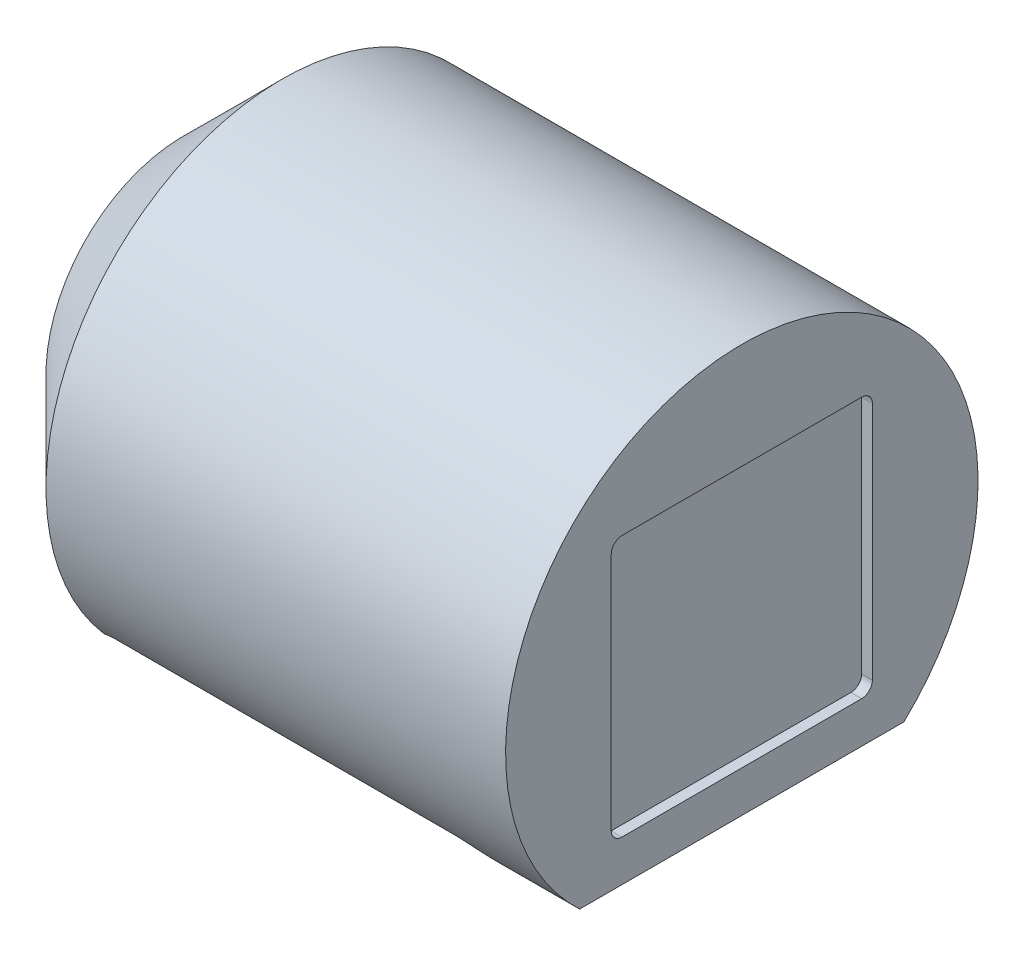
ISO-10303-21;
HEADER;
FILE_DESCRIPTION(('STEP AP214'),'2;1');
FILE_NAME('part.step','',(''),(''),'','','');
FILE_SCHEMA(('AUTOMOTIVE_DESIGN { 1 0 10303 214 1 1 1 1 }'));
ENDSEC;
DATA;
#1=APPLICATION_CONTEXT('core data for automotive mechanical design processes');
#2=APPLICATION_PROTOCOL_DEFINITION('international standard','automotive_design',2000,#1);
#3=PRODUCT_CONTEXT('',#1,'mechanical');
#4=PRODUCT('Part','Part','',(#3));
#5=PRODUCT_RELATED_PRODUCT_CATEGORY('part','',(#4));
#6=PRODUCT_DEFINITION_FORMATION('','',#4);
#7=PRODUCT_DEFINITION_CONTEXT('part definition',#1,'design');
#8=PRODUCT_DEFINITION('design','',#6,#7);
#9=PRODUCT_DEFINITION_SHAPE('','',#8);
#10=(LENGTH_UNIT() NAMED_UNIT(*) SI_UNIT(.MILLI.,.METRE.));
#11=(NAMED_UNIT(*) PLANE_ANGLE_UNIT() SI_UNIT($,.RADIAN.));
#12=(NAMED_UNIT(*) SI_UNIT($,.STERADIAN.) SOLID_ANGLE_UNIT());
#13=UNCERTAINTY_MEASURE_WITH_UNIT(LENGTH_MEASURE(1.E-05),#10,'distance_accuracy_value','');
#14=(GEOMETRIC_REPRESENTATION_CONTEXT(3) GLOBAL_UNCERTAINTY_ASSIGNED_CONTEXT((#13)) GLOBAL_UNIT_ASSIGNED_CONTEXT((#10,
#11,#12)) REPRESENTATION_CONTEXT('',''));
#15=CARTESIAN_POINT('',(0.,0.,0.));
#16=DIRECTION('',(0.,0.,1.));
#17=DIRECTION('',(1.,0.,0.));
#18=AXIS2_PLACEMENT_3D('',#15,#16,#17);
#19=CARTESIAN_POINT('',(41.275,0.,0.));
#20=DIRECTION('',(-1.,0.,0.));
#21=DIRECTION('',(0.,0.,1.));
#22=AXIS2_PLACEMENT_3D('',#19,#20,#21);
#23=CYLINDRICAL_SURFACE('',#22,17.4625);
#24=DIRECTION('',(-1.,0.,0.));
#25=VECTOR('',#24,1.);
#26=CARTESIAN_POINT('',(41.275,-10.9488364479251,13.6037453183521));
#27=LINE('',#26,#25);
#28=CARTESIAN_POINT('',(8.73125,-10.9488364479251,13.6037453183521));
#29=VERTEX_POINT('',#28);
#30=CARTESIAN_POINT('',(33.3375,-10.9488364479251,13.6037453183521));
#31=VERTEX_POINT('',#30);
#32=EDGE_CURVE('E603',#29,#31,#27,.F.);
#33=ORIENTED_EDGE('',*,*,#32,.T.);
#34=CARTESIAN_POINT('',(32.7003469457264,-10.7599052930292,12.6131753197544));
#35=CARTESIAN_POINT('',(32.8046903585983,-11.0922636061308,12.6421510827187));
#36=CARTESIAN_POINT('',(32.7546191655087,-11.2110242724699,12.9670787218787));
#37=CARTESIAN_POINT('',(32.7045479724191,-11.329784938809,13.2920063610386));
#38=CARTESIAN_POINT('',(32.5644209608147,-11.0822994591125,13.495241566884));
#39=CARTESIAN_POINT('',(32.7414309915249,-10.743038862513,12.624589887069));
#40=CARTESIAN_POINT('',(32.8408945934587,-11.0785512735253,12.6501896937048));
#41=CARTESIAN_POINT('',(32.7938904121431,-11.1974159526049,12.9769108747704));
#42=CARTESIAN_POINT('',(32.7469840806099,-11.316250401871,13.3036535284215));
#43=CARTESIAN_POINT('',(32.6142696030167,-11.0649276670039,13.5095062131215));
#44=CARTESIAN_POINT('',(32.7832105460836,-10.7275959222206,12.6349976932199));
#45=CARTESIAN_POINT('',(32.87716793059,-11.0661488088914,12.6573562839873));
#46=CARTESIAN_POINT('',(32.8333703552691,-11.1850941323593,12.9857477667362));
#47=CARTESIAN_POINT('',(32.7896522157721,-11.3040183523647,13.3141542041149));
#48=CARTESIAN_POINT('',(32.6649621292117,-11.0490220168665,13.5225127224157));
#49=CARTESIAN_POINT('',(32.8679976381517,-10.699825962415,12.6536587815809));
#50=CARTESIAN_POINT('',(32.9499213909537,-11.0440145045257,12.6700110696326));
#51=CARTESIAN_POINT('',(32.9126729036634,-11.1631186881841,13.0014238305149));
#52=CARTESIAN_POINT('',(32.8755005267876,-11.2822008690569,13.3328523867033));
#53=CARTESIAN_POINT('',(32.7678371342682,-11.0204199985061,13.5458332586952));
#54=CARTESIAN_POINT('',(32.9110067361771,-10.6875031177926,12.6619091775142));
#55=CARTESIAN_POINT('',(32.9863874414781,-11.0342959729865,12.6754911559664));
#56=CARTESIAN_POINT('',(32.9524958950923,-11.1534686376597,13.0082603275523));
#57=CARTESIAN_POINT('',(32.9186649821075,-11.272628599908,13.3410384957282));
#58=CARTESIAN_POINT('',(32.8200215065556,-11.0077279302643,13.5561436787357));
#59=CARTESIAN_POINT('',(32.9976923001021,-10.6663587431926,12.6760364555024));
#60=CARTESIAN_POINT('',(33.0591337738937,-11.0177220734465,12.6847582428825));
#61=CARTESIAN_POINT('',(33.0320411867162,-11.1370232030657,13.019863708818));
#62=CARTESIAN_POINT('',(33.0050096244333,-11.2563118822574,13.3549779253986));
#63=CARTESIAN_POINT('',(32.9251999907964,-10.985950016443,13.5737983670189));
#64=CARTESIAN_POINT('',(33.0413624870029,-10.6575146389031,12.6819286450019));
#65=CARTESIAN_POINT('',(33.0953973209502,-11.0108562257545,12.6885515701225));
#66=CARTESIAN_POINT('',(33.071762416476,-11.130209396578,13.0246439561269));
#67=CARTESIAN_POINT('',(33.0481687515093,-11.2495570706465,13.3607401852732));
#68=CARTESIAN_POINT('',(32.9781864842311,-10.9768409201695,13.5811617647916));
#69=CARTESIAN_POINT('',(33.1293178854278,-10.6434402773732,12.6912938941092));
#70=CARTESIAN_POINT('',(33.167905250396,-10.9999703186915,12.6945336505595));
#71=CARTESIAN_POINT('',(33.1512490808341,-11.1194132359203,13.0321989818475));
#72=CARTESIAN_POINT('',(33.1346340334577,-11.238850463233,13.3698682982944));
#73=CARTESIAN_POINT('',(33.0849057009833,-10.9623448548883,13.5928654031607));
#74=CARTESIAN_POINT('',(33.1736025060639,-10.6382067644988,12.6947691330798));
#75=CARTESIAN_POINT('',(33.2041308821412,-10.9959534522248,12.6967206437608));
#76=CARTESIAN_POINT('',(33.1910144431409,-11.1154283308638,13.0349755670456));
#77=CARTESIAN_POINT('',(33.1779178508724,-11.2349018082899,13.3732314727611));
#78=CARTESIAN_POINT('',(33.1386377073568,-10.9569545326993,13.5972083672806));
#79=CARTESIAN_POINT('',(33.2577766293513,-10.631835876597,12.6989979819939));
#80=CARTESIAN_POINT('',(33.2727417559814,-10.9910681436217,12.6993756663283));
#81=CARTESIAN_POINT('',(33.2663521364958,-11.1105845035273,13.0383478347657));
#82=CARTESIAN_POINT('',(33.2599784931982,-11.2300999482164,13.3773206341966));
#83=CARTESIAN_POINT('',(33.2407689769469,-10.9503927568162,13.6024931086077));
#84=CARTESIAN_POINT('',(33.2976350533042,-10.6303234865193,12.7000007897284));
#85=CARTESIAN_POINT('',(33.3051139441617,-10.9899134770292,12.7000000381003));
#86=CARTESIAN_POINT('',(33.3019226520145,-11.1094392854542,13.0391432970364));
#87=CARTESIAN_POINT('',(33.298731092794,-11.2289653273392,13.3782863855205));
#88=CARTESIAN_POINT('',(33.289130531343,-10.948835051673,13.6037463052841));
#89=CARTESIAN_POINT('',(33.3883489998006,-10.6303265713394,12.6999989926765));
#90=CARTESIAN_POINT('',(33.3788094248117,-10.9899148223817,12.699999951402));
#91=CARTESIAN_POINT('',(33.3828800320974,-11.1094408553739,13.0391426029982));
#92=CARTESIAN_POINT('',(33.3869509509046,-11.22896659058,13.3782854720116));
#93=CARTESIAN_POINT('',(33.3991967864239,-10.9488382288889,13.603744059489));
#94=CARTESIAN_POINT('',(33.4392086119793,-10.632791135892,12.6983651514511));
#95=CARTESIAN_POINT('',(33.4201142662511,-10.9917950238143,12.6989840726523));
#96=CARTESIAN_POINT('',(33.428271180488,-11.1113061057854,13.0378475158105));
#97=CARTESIAN_POINT('',(33.4363959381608,-11.2308140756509,13.3767131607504));
#98=CARTESIAN_POINT('',(33.4609064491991,-10.9513766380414,13.6017022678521));
#99=CARTESIAN_POINT('',(33.5404167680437,-10.6425523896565,12.6918824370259));
#100=CARTESIAN_POINT('',(33.5027793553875,-10.9992936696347,12.6948992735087));
#101=CARTESIAN_POINT('',(33.519012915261,-11.1187407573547,13.032665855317));
#102=CARTESIAN_POINT('',(33.5352128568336,-11.2381855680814,13.3704339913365));
#103=CARTESIAN_POINT('',(33.5837056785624,-10.9614303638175,13.5936008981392));
#104=CARTESIAN_POINT('',(33.5907649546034,-10.6498522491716,12.6870314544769));
#105=CARTESIAN_POINT('',(33.5441101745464,-11.0049091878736,12.6918319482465));
#106=CARTESIAN_POINT('',(33.5643634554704,-11.1243125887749,13.0287775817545));
#107=CARTESIAN_POINT('',(33.5845496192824,-11.2437066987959,13.3657295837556));
#108=CARTESIAN_POINT('',(33.6447948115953,-10.9689489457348,13.5875386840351));
#109=CARTESIAN_POINT('',(33.7405588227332,-10.678726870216,12.6677930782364));
#110=CARTESIAN_POINT('',(33.6683110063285,-11.0273293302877,12.6794399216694));
#111=CARTESIAN_POINT('',(33.7004846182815,-11.1465691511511,13.0131608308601));
#112=CARTESIAN_POINT('',(33.7324091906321,-11.2657648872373,13.3469129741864));
#113=CARTESIAN_POINT('',(33.8265447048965,-10.9986887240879,13.5634967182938));
#114=CARTESIAN_POINT('',(33.8385610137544,-10.7072753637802,12.6487209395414));
#115=CARTESIAN_POINT('',(33.7512479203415,-11.0496746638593,12.6669434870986));
#116=CARTESIAN_POINT('',(33.7911555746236,-11.1687947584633,12.9974802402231));
#117=CARTESIAN_POINT('',(33.8306133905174,-11.2877643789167,13.328125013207));
#118=CARTESIAN_POINT('',(33.9454540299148,-11.0280926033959,13.5396624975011));
#119=CARTESIAN_POINT('',(34.0265258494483,-10.7791606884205,12.6001887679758));
#120=CARTESIAN_POINT('',(33.915189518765,-11.1076948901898,12.6332113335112));
#121=CARTESIAN_POINT('',(33.9694298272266,-11.2264190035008,12.9560235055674));
#122=CARTESIAN_POINT('',(34.0232316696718,-11.3450063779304,13.2789342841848));
#123=CARTESIAN_POINT('',(34.1735180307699,-11.102131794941,13.4790124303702));
#124=CARTESIAN_POINT('',(34.1165678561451,-10.8223240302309,12.5708504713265));
#125=CARTESIAN_POINT('',(33.9960617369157,-11.1430951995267,12.612151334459));
#126=CARTESIAN_POINT('',(34.057056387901,-11.2616635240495,12.9303652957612));
#127=CARTESIAN_POINT('',(34.1175148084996,-11.3799764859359,13.2487694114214));
#128=CARTESIAN_POINT('',(34.2827689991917,-11.1465884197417,13.4423487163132));
#129=CARTESIAN_POINT('',(34.2888567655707,-10.919898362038,12.5036571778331));
#130=CARTESIAN_POINT('',(34.1551253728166,-11.2251820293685,12.5614727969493));
#131=CARTESIAN_POINT('',(34.2286222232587,-11.3433271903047,12.869660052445));
#132=CARTESIAN_POINT('',(34.3015775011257,-11.4612146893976,13.1780385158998));
#133=CARTESIAN_POINT('',(34.4918128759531,-11.2470863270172,13.3583780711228));
#134=CARTESIAN_POINT('',(34.371103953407,-10.9743089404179,12.46580249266));
#135=CARTESIAN_POINT('',(34.2332551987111,-11.2717572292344,12.5319329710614));
#136=CARTESIAN_POINT('',(34.312561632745,-11.3897459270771,12.8346133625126));
#137=CARTESIAN_POINT('',(34.3912945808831,-11.507371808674,13.1375726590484));
#138=CARTESIAN_POINT('',(34.5916061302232,-11.3031271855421,13.311071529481));
#139=CARTESIAN_POINT('',(34.5733670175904,-11.125490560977,12.3590113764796));
#140=CARTESIAN_POINT('',(34.4293682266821,-11.4034550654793,12.4454979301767));
#141=CARTESIAN_POINT('',(34.5228989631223,-11.521201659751,12.7332072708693));
#142=CARTESIAN_POINT('',(34.6150338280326,-11.6380827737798,13.0215857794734));
#143=CARTESIAN_POINT('',(34.8370186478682,-11.4588385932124,13.17761596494));
#144=CARTESIAN_POINT('',(34.6874451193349,-11.228463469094,12.2848211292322));
#145=CARTESIAN_POINT('',(34.544640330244,-11.4953667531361,12.3826447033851));
#146=CARTESIAN_POINT('',(34.6455182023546,-11.6129753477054,12.6605048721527));
#147=CARTESIAN_POINT('',(34.7451137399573,-11.7294757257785,12.9392773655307));
#148=CARTESIAN_POINT('',(34.9754334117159,-11.5648968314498,13.0849013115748));
#149=CARTESIAN_POINT('',(34.8969626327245,-11.4465413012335,12.1231898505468));
#150=CARTESIAN_POINT('',(34.7614045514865,-11.6938539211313,12.2400177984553));
#151=CARTESIAN_POINT('',(34.8752615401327,-11.8110786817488,12.4979155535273));
#152=CARTESIAN_POINT('',(34.9878019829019,-11.9271706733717,12.7567402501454));
#153=CARTESIAN_POINT('',(35.2296479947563,-11.7895088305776,12.8829126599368));
#154=CARTESIAN_POINT('',(34.9923413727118,-11.5616839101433,12.0357072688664));
#155=CARTESIAN_POINT('',(34.8630233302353,-11.8003254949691,12.1603702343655));
#156=CARTESIAN_POINT('',(34.9823349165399,-11.9174538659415,12.4079745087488));
#157=CARTESIAN_POINT('',(35.1005685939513,-12.0333667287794,12.6566428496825));
#158=CARTESIAN_POINT('',(35.3453741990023,-11.9081014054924,12.7735867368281));
#159=CARTESIAN_POINT('',(35.1973123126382,-11.842216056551,11.8159500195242));
#160=CARTESIAN_POINT('',(35.0847802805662,-12.0621955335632,11.9555004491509));
#161=CARTESIAN_POINT('',(35.2158971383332,-12.1796326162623,12.1783503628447));
#162=CARTESIAN_POINT('',(35.345030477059,-12.2948506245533,12.4031445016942));
#163=CARTESIAN_POINT('',(35.5940722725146,-12.1970390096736,12.4989587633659));
#164=CARTESIAN_POINT('',(35.2992316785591,-12.0105115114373,11.6790344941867));
#165=CARTESIAN_POINT('',(35.1990618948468,-12.221820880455,11.8239661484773));
#166=CARTESIAN_POINT('',(35.3350445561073,-12.3392268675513,12.0325384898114));
#167=CARTESIAN_POINT('',(35.4696572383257,-12.4544567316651,12.2432052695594));
#168=CARTESIAN_POINT('',(35.7177344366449,-12.3703770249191,12.3278570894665));
#169=CARTESIAN_POINT('',(35.4711228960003,-12.3507632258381,11.3894071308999));
#170=CARTESIAN_POINT('',(35.3957718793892,-12.5471948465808,11.5398555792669));
#171=CARTESIAN_POINT('',(35.5397231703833,-12.6647401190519,11.7201479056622));
#172=CARTESIAN_POINT('',(35.6823088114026,-12.780110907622,11.9025210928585));
#173=CARTESIAN_POINT('',(35.9262957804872,-12.7208235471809,11.9659132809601));
#174=CARTESIAN_POINT('',(35.5411026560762,-12.5227185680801,11.2366992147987));
#175=CARTESIAN_POINT('',(35.4787603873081,-12.7130798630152,11.3873710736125));
#176=CARTESIAN_POINT('',(35.6252626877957,-12.8306575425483,11.5535743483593));
#177=CARTESIAN_POINT('',(35.770968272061,-12.9462912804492,11.721826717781));
#178=CARTESIAN_POINT('',(36.0112045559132,-12.8979311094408,11.7750760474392));
#179=CARTESIAN_POINT('',(35.6215675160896,-12.7798308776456,10.9973974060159));
#180=CARTESIAN_POINT('',(35.5778735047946,-12.9629061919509,11.144726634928));
#181=CARTESIAN_POINT('',(35.7267501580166,-13.0800687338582,11.2905789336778));
#182=CARTESIAN_POINT('',(35.8754271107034,-13.1967334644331,11.4369565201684));
#183=CARTESIAN_POINT('',(36.1088352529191,-13.1627471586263,11.4760234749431));
#184=CARTESIAN_POINT('',(35.6443636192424,-12.8658876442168,10.9154250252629));
#185=CARTESIAN_POINT('',(35.6067265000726,-13.0465140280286,11.0613531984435));
#186=CARTESIAN_POINT('',(35.7561988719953,-13.1637749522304,11.2001694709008));
#187=CARTESIAN_POINT('',(35.9055360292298,-13.2805759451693,11.3394948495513));
#188=CARTESIAN_POINT('',(36.1364945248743,-13.2513824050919,11.3735835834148));
#189=CARTESIAN_POINT('',(35.68117035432,-13.036796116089,10.7486907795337));
#190=CARTESIAN_POINT('',(35.6551619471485,-13.2128651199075,10.890940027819));
#191=CARTESIAN_POINT('',(35.8053591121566,-13.3303824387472,11.015738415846));
#192=CARTESIAN_POINT('',(35.955421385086,-13.4474442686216,11.1410410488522));
#193=CARTESIAN_POINT('',(36.1811533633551,-13.4274117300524,11.1652178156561));
#194=CARTESIAN_POINT('',(35.6951827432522,-13.12164805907,10.6639294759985));
#195=CARTESIAN_POINT('',(35.6748059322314,-13.2956443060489,10.8038892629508));
#196=CARTESIAN_POINT('',(35.8250725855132,-13.413283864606,10.9217175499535));
#197=CARTESIAN_POINT('',(35.9752656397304,-13.5305058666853,11.0400318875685));
#198=CARTESIAN_POINT('',(36.1981550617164,-13.5148060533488,11.0592926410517));
#199=CARTESIAN_POINT('',(35.7139981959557,-13.2894617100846,10.4921619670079));
#200=CARTESIAN_POINT('',(35.7042699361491,-13.4595954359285,10.6267961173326));
#201=CARTESIAN_POINT('',(35.854208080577,-13.5775357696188,10.7307544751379));
#202=CARTESIAN_POINT('',(36.0040721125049,-13.6950609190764,10.8351949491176));
#203=CARTESIAN_POINT('',(36.2209844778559,-13.6876478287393,10.8446368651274));
#204=CARTESIAN_POINT('',(35.7188034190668,-13.3724238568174,10.405156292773));
#205=CARTESIAN_POINT('',(35.7141474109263,-13.5408071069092,10.5367357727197));
#206=CARTESIAN_POINT('',(35.8636325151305,-13.658886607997,10.6338129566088));
#207=CARTESIAN_POINT('',(36.0130972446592,-13.77659400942,10.7313430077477));
#208=CARTESIAN_POINT('',(36.2268148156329,-13.7730957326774,10.7359069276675));
#209=CARTESIAN_POINT('',(35.7186957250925,-13.535878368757,10.2294909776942));
#210=CARTESIAN_POINT('',(35.723483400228,-13.7009929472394,10.354356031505));
#211=CARTESIAN_POINT('',(35.8715769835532,-13.8194104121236,10.4377439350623));
#212=CARTESIAN_POINT('',(36.0196540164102,-13.9374540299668,10.5215900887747));
#213=CARTESIAN_POINT('',(36.2266841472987,-13.9414477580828,10.5163801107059));
#214=CARTESIAN_POINT('',(35.7137752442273,-13.6163687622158,10.1408301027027));
#215=CARTESIAN_POINT('',(35.7229839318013,-13.7800075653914,10.2620091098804));
#216=CARTESIAN_POINT('',(35.8700885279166,-13.8985816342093,10.338614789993));
#217=CARTESIAN_POINT('',(36.0172312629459,-14.0168214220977,10.415655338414));
#218=CARTESIAN_POINT('',(36.2207139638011,-14.0243498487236,10.4055816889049));
#219=CARTESIAN_POINT('',(35.7037298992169,-13.6952579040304,10.0517151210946));
#220=CARTESIAN_POINT('',(35.7169391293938,-13.8576859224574,10.1687637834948));
#221=CARTESIAN_POINT('',(35.8628249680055,-13.9762754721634,10.2388464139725));
#222=CARTESIAN_POINT('',(36.0087108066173,-14.0948650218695,10.3089290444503));
#223=CARTESIAN_POINT('',(36.2085256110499,-14.1056027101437,10.2942157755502));
#224=(BOUNDED_SURFACE() B_SPLINE_SURFACE(3,2,((#34,#35,#36,#37,#38),(#39,#40,#41,#42,#43),(#44,
#45,#46,#47,#48),(#49,#50,#51,#52,#53),(#54,#55,#56,#57,#58),(#59,#60,#61,#62,#63),(#64,#65,#66,
#67,#68),(#69,#70,#71,#72,#73),(#74,#75,#76,#77,#78),(#79,#80,#81,#82,#83),(#84,#85,#86,#87,
#88),(#89,#90,#91,#92,#93),(#94,#95,#96,#97,#98),(#99,#100,#101,#102,#103),(#104,#105,#106,#107,
#108),(#109,#110,#111,#112,#113),(#114,#115,#116,#117,#118),(#119,#120,#121,#122,#123),(#124,
#125,#126,#127,#128),(#129,#130,#131,#132,#133),(#134,#135,#136,#137,#138),(#139,#140,#141,#142,
#143),(#144,#145,#146,#147,#148),(#149,#150,#151,#152,#153),(#154,#155,#156,#157,#158),(#159,
#160,#161,#162,#163),(#164,#165,#166,#167,#168),(#169,#170,#171,#172,#173),(#174,#175,#176,#177,
#178),(#179,#180,#181,#182,#183),(#184,#185,#186,#187,#188),(#189,#190,#191,#192,#193),(#194,
#195,#196,#197,#198),(#199,#200,#201,#202,#203),(#204,#205,#206,#207,#208),(#209,#210,#211,#212,
#213),(#214,#215,#216,#217,#218),(#219,#220,#221,#222,#223)),.UNSPECIFIED.,.F.,.F.,
.F.) B_SPLINE_SURFACE_WITH_KNOTS((4,2,2,2,2,2,2,2,2,2,2,2,2,2,2,2,2,2,4),(3,2,3),(0.,
0.163243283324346,0.326703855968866,0.489085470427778,0.65132047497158,0.796378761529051,
0.981405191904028,1.16655305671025,1.53753808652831,1.90426524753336,2.27097898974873,
2.85149949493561,3.43387346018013,4.23042385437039,5.02677690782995,5.42958493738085,
5.83231236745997,6.23494533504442,6.63789155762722),(0.,0.5,1.),
.UNSPECIFIED.) GEOMETRIC_REPRESENTATION_ITEM() RATIONAL_B_SPLINE_SURFACE(((1.,0.823810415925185,
1.,0.823810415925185,1.),(1.,0.82285675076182,1.,0.82285675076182,1.),(1.,0.821970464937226,1.,
0.821970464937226,1.),(1.,0.820359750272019,1.,0.820359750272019,1.),(1.,0.819635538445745,1.,
0.819635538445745,1.),(1.,0.818382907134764,1.,0.818382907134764,1.),(1.,0.81785322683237,1.,
0.81785322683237,1.),(1.,0.81700623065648,1.,0.81700623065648,1.),(1.,0.816688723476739,1.,
0.816688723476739,1.),(1.,0.816301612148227,1.,0.816301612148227,1.),(1.,0.816209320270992,1.,
0.816209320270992,1.),(1.,0.816209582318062,1.,0.816209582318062,1.),(1.,0.816360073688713,1.,
0.816360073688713,1.),(1.,0.816952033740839,1.,0.816952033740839,1.),(1.,0.817393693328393,1.,
0.817393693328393,1.),(1.,0.819122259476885,1.,0.819122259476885,1.),(1.,0.820812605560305,1.,
0.820812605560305,1.),(1.,0.824912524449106,1.,0.824912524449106,1.),(1.,0.82731361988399,1.,
0.82731361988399,1.),(1.,0.832527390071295,1.,0.832527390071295,1.),(1.,0.83534004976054,1.,
0.83534004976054,1.),(1.,0.842844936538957,1.,0.842844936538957,1.),(1.,0.847676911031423,1.,
0.847676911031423,1.),(1.,0.857320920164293,1.,0.857320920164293,1.),(1.,0.862132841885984,1.,
0.862132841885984,1.),(1.,0.873262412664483,1.,0.873262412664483,1.),(1.,0.879482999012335,1.,
0.879482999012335,1.),(1.,0.891316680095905,1.,0.891316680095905,1.),(1.,0.896929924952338,1.,
0.896929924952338,1.),(1.,0.904881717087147,1.,0.904881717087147,1.),(1.,0.907467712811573,1.,
0.907467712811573,1.),(1.,0.912467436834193,1.,0.912467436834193,1.),(1.,0.914881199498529,1.,
0.914881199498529,1.),(1.,0.919531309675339,1.,0.919531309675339,1.),(1.,0.921767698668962,1.,
0.921767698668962,1.),(1.,0.92606110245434,1.,0.92606110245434,1.),(1.,0.928117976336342,1.,
0.928117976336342,1.),(1.,0.930082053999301,1.,0.930082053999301,1.))) REPRESENTATION_ITEM('') SURFACE());
#225=CARTESIAN_POINT('',(32.5644209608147,-11.0822994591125,13.495241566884));
#226=CARTESIAN_POINT('',(32.6142696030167,-11.0649276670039,13.5095062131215));
#227=CARTESIAN_POINT('',(32.6649621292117,-11.0490220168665,13.5225127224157));
#228=CARTESIAN_POINT('',(32.7678371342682,-11.0204199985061,13.5458332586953));
#229=CARTESIAN_POINT('',(32.8200215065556,-11.0077279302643,13.5561436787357));
#230=CARTESIAN_POINT('',(32.9251999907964,-10.985950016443,13.5737983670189));
#231=CARTESIAN_POINT('',(32.9781864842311,-10.9768409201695,13.5811617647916));
#232=CARTESIAN_POINT('',(33.0849057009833,-10.9623448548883,13.5928654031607));
#233=CARTESIAN_POINT('',(33.1386377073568,-10.9569545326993,13.5972083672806));
#234=CARTESIAN_POINT('',(33.2407689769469,-10.9503927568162,13.6024931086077));
#235=CARTESIAN_POINT('',(33.289130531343,-10.948835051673,13.6037463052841));
#236=CARTESIAN_POINT('',(33.3991967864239,-10.9488382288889,13.603744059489));
#237=CARTESIAN_POINT('',(33.4609064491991,-10.9513766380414,13.6017022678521));
#238=CARTESIAN_POINT('',(33.5837056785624,-10.9614303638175,13.5936008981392));
#239=CARTESIAN_POINT('',(33.6447948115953,-10.9689489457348,13.5875386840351));
#240=CARTESIAN_POINT('',(33.8265447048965,-10.9986887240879,13.5634967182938));
#241=CARTESIAN_POINT('',(33.9454540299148,-11.0280926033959,13.5396624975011));
#242=CARTESIAN_POINT('',(34.17351803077,-11.102131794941,13.4790124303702));
#243=CARTESIAN_POINT('',(34.2827689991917,-11.1465884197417,13.4423487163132));
#244=CARTESIAN_POINT('',(34.4918128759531,-11.2470863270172,13.3583780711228));
#245=CARTESIAN_POINT('',(34.5916061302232,-11.3031271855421,13.311071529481));
#246=CARTESIAN_POINT('',(34.8370186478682,-11.4588385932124,13.17761596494));
#247=CARTESIAN_POINT('',(34.9754334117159,-11.5648968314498,13.0849013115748));
#248=CARTESIAN_POINT('',(35.2296479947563,-11.7895088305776,12.8829126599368));
#249=CARTESIAN_POINT('',(35.3453741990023,-11.9081014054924,12.7735867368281));
#250=CARTESIAN_POINT('',(35.5940722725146,-12.1970390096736,12.4989587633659));
#251=CARTESIAN_POINT('',(35.7177344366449,-12.3703770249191,12.3278570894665));
#252=CARTESIAN_POINT('',(35.9262957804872,-12.720823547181,11.9659132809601));
#253=CARTESIAN_POINT('',(36.0112045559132,-12.8979311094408,11.7750760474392));
#254=CARTESIAN_POINT('',(36.1088352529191,-13.1627471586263,11.4760234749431));
#255=CARTESIAN_POINT('',(36.1364945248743,-13.2513824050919,11.3735835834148));
#256=CARTESIAN_POINT('',(36.1811533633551,-13.4274117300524,11.1652178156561));
#257=CARTESIAN_POINT('',(36.1981550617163,-13.5148060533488,11.0592926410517));
#258=CARTESIAN_POINT('',(36.2209844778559,-13.6876478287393,10.8446368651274));
#259=CARTESIAN_POINT('',(36.2268148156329,-13.7730957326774,10.7359069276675));
#260=CARTESIAN_POINT('',(36.2266841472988,-13.9414477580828,10.5163801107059));
#261=CARTESIAN_POINT('',(36.2207139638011,-14.0243498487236,10.4055816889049));
#262=CARTESIAN_POINT('',(36.2085256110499,-14.1056027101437,10.2942157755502));
#263=B_SPLINE_CURVE_WITH_KNOTS('',3,(#225,#226,#227,#228,#229,#230,#231,#232,#233,#234,#235,
#236,#237,#238,#239,#240,#241,#242,#243,#244,#245,#246,#247,#248,#249,#250,#251,#252,#253,#254,
#255,#256,#257,#258,#259,#260,#261,#262),.UNSPECIFIED.,.F.,.F.,(4,2,2,2,2,2,2,2,2,2,2,2,2,2,2,2,
2,2,4),(0.,0.163243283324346,0.326703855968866,0.489085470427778,0.65132047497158,
0.796378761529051,0.981405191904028,1.16655305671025,1.53753808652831,1.90426524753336,
2.27097898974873,2.85149949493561,3.43387346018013,4.23042385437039,5.02677690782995,
5.42958493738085,5.83231236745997,6.23494533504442,6.63789155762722),.UNSPECIFIED.);
#264=CARTESIAN_POINT('',(35.9086439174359,-12.7,11.9853621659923));
#265=VERTEX_POINT('',#264);
#266=EDGE_CURVE('E602',#31,#265,#263,.T.);
#267=ORIENTED_EDGE('',*,*,#266,.T.);
#268=DIRECTION('',(-1.,0.,0.));
#269=VECTOR('',#268,1.);
#270=CARTESIAN_POINT('',(41.275,-12.7,11.9853621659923));
#271=LINE('',#270,#269);
#272=CARTESIAN_POINT('',(41.275,-12.7,11.9853621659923));
#273=VERTEX_POINT('',#272);
#274=EDGE_CURVE('E217',#273,#265,#271,.T.);
#275=ORIENTED_EDGE('',*,*,#274,.F.);
#276=CARTESIAN_POINT('',(41.275,0.,0.));
#277=DIRECTION('',(1.,0.,0.));
#278=DIRECTION('',(0.,0.,-1.));
#279=AXIS2_PLACEMENT_3D('',#276,#277,#278);
#280=CIRCLE('',#279,17.4625);
#281=CARTESIAN_POINT('',(41.275,-12.7,-11.9853621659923));
#282=VERTEX_POINT('',#281);
#283=EDGE_CURVE('E222',#282,#273,#280,.T.);
#284=ORIENTED_EDGE('',*,*,#283,.F.);
#285=DIRECTION('',(-1.,0.,0.));
#286=VECTOR('',#285,1.);
#287=CARTESIAN_POINT('',(41.275,-12.7,-11.9853621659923));
#288=LINE('',#287,#286);
#289=CARTESIAN_POINT('',(35.9086439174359,-12.7,-11.9853621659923));
#290=VERTEX_POINT('',#289);
#291=EDGE_CURVE('E205',#290,#282,#288,.F.);
#292=ORIENTED_EDGE('',*,*,#291,.F.);
#293=CARTESIAN_POINT('',(35.7159808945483,-13.5585324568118,-10.2039449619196));
#294=CARTESIAN_POINT('',(35.7219430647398,-13.723440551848,-10.3274666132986));
#295=CARTESIAN_POINT('',(35.8696804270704,-13.8417238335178,-10.4091401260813));
#296=CARTESIAN_POINT('',(36.0174177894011,-13.9600071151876,-10.4908136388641));
#297=CARTESIAN_POINT('',(36.223390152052,-13.9647806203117,-10.4844555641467));
#298=CARTESIAN_POINT('',(35.7194102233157,-13.4936917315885,-10.2751308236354));
#299=CARTESIAN_POINT('',(35.7218096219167,-13.6597078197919,-10.4016984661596));
#300=CARTESIAN_POINT('',(35.8702896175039,-13.7779653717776,-10.4887055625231));
#301=CARTESIAN_POINT('',(36.0187744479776,-13.8959924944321,-10.5760022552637));
#302=CARTESIAN_POINT('',(36.2275510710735,-13.8979971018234,-10.5734156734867));
#303=CARTESIAN_POINT('',(35.7196284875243,-13.4279586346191,-10.3458665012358));
#304=CARTESIAN_POINT('',(35.7182240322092,-13.5952698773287,-10.4751634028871));
#305=CARTESIAN_POINT('',(35.8672878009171,-13.7134018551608,-10.5676694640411));
#306=CARTESIAN_POINT('',(36.0163272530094,-13.8312822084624,-10.6604777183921));
#307=CARTESIAN_POINT('',(36.227815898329,-13.8302944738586,-10.6618131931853));
#308=CARTESIAN_POINT('',(35.7138993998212,-13.2950478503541,-10.4861035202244));
#309=CARTESIAN_POINT('',(35.7045161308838,-13.4651591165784,-10.6204061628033));
#310=CARTESIAN_POINT('',(35.8543760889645,-13.5830301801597,-10.7239812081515));
#311=CARTESIAN_POINT('',(36.0042104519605,-13.7006489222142,-10.8278582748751));
#312=CARTESIAN_POINT('',(36.2208646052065,-13.6934013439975,-10.8370656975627));
#313=CARTESIAN_POINT('',(35.707955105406,-13.2278708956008,-10.5556054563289));
#314=CARTESIAN_POINT('',(35.6943699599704,-13.3994654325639,-10.6921969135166));
#315=CARTESIAN_POINT('',(35.8444696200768,-13.5172226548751,-10.8013298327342));
#316=CARTESIAN_POINT('',(35.9945148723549,-13.6347050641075,-10.9107795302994));
#317=CARTESIAN_POINT('',(36.2136521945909,-13.6242115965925,-10.9239214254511));
#318=CARTESIAN_POINT('',(35.6812503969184,-13.0244907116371,-10.7619622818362));
#319=CARTESIAN_POINT('',(35.6544896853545,-13.2004782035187,-10.9050858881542));
#320=CARTESIAN_POINT('',(35.8048404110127,-13.3182922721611,-11.0305590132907));
#321=CARTESIAN_POINT('',(35.9549709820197,-13.4350046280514,-11.1573014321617));
#322=CARTESIAN_POINT('',(36.1812504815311,-13.4147376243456,-11.1818030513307));
#323=CARTESIAN_POINT('',(35.6516140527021,-12.8865301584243,-10.896567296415));
#324=CARTESIAN_POINT('',(35.6153014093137,-13.0660692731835,-11.0427694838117));
#325=CARTESIAN_POINT('',(35.7652078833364,-13.1837521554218,-11.1795099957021));
#326=CARTESIAN_POINT('',(35.9146325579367,-13.3001736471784,-11.3175936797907));
#327=CARTESIAN_POINT('',(36.1452917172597,-13.2726434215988,-11.3500173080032));
#328=CARTESIAN_POINT('',(35.5619687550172,-12.580336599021,-11.18435748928));
#329=CARTESIAN_POINT('',(35.5038636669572,-12.7688080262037,-11.3347462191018));
#330=CARTESIAN_POINT('',(35.6511038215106,-12.8863968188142,-11.4962665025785));
#331=CARTESIAN_POINT('',(35.7976320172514,-13.0021373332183,-11.6597562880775));
#332=CARTESIAN_POINT('',(36.0365220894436,-12.9572755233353,-11.7096652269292));
#333=CARTESIAN_POINT('',(35.4969769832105,-12.4116982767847,-11.3356910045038));
#334=CARTESIAN_POINT('',(35.4261861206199,-12.6059012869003,-11.4863578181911));
#335=CARTESIAN_POINT('',(35.5711539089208,-12.7234420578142,-11.6616731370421));
#336=CARTESIAN_POINT('',(35.7148816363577,-12.838912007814,-11.8389945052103));
#337=CARTESIAN_POINT('',(35.9576654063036,-12.7835843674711,-11.8987848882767));
#338=CARTESIAN_POINT('',(35.3362202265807,-12.0770875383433,-11.6236191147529));
#339=CARTESIAN_POINT('',(35.2409218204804,-12.2852784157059,-11.770096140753));
#340=CARTESIAN_POINT('',(35.3786441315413,-12.4026442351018,-11.9731307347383));
#341=CARTESIAN_POINT('',(35.5151208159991,-12.5179387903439,-12.17818082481));
#342=CARTESIAN_POINT('',(35.7626138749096,-12.4389478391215,-12.2586051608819));
#343=CARTESIAN_POINT('',(35.2404452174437,-11.9111160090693,-11.7602088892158));
#344=CARTESIAN_POINT('',(35.1328088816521,-12.1274159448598,-11.9021525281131));
#345=CARTESIAN_POINT('',(35.2660736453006,-12.2448028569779,-12.1191753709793));
#346=CARTESIAN_POINT('',(35.397516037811,-12.3600481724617,-12.3380985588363));
#347=CARTESIAN_POINT('',(35.6464068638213,-12.2680033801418,-12.4292997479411));
#348=CARTESIAN_POINT('',(35.0466487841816,-11.6318427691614,-11.9815064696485));
#349=CARTESIAN_POINT('',(34.921425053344,-11.8656404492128,-12.1102815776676));
#350=CARTESIAN_POINT('',(35.0437895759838,-11.9826943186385,-12.3517350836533));
#351=CARTESIAN_POINT('',(35.1651458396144,-12.0985538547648,-12.5942481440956));
#352=CARTESIAN_POINT('',(35.4112671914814,-11.9803624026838,-12.7058526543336));
#353=CARTESIAN_POINT('',(34.9557830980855,-11.5161298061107,-12.0704339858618));
#354=CARTESIAN_POINT('',(34.8237592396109,-11.7580839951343,-12.1921404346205));
#355=CARTESIAN_POINT('',(34.9410470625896,-11.8752215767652,-12.443824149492));
#356=CARTESIAN_POINT('',(35.0570901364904,-11.9912233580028,-12.6964501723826));
#357=CARTESIAN_POINT('',(35.3010168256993,-11.8611823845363,-12.8169842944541));
#358=CARTESIAN_POINT('',(34.7558441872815,-11.295309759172,-12.2358943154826));
#359=CARTESIAN_POINT('',(34.6146804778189,-11.5557552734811,-12.3401610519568));
#360=CARTESIAN_POINT('',(34.7198532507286,-11.6732273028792,-12.6118111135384));
#361=CARTESIAN_POINT('',(34.8238038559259,-11.7895823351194,-12.8843924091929));
#362=CARTESIAN_POINT('',(35.058424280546,-11.6337460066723,-13.0237580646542));
#363=CARTESIAN_POINT('',(34.6468103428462,-11.1901805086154,-12.3124532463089));
#364=CARTESIAN_POINT('',(34.5031162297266,-11.461073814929,-12.4061986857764));
#365=CARTESIAN_POINT('',(34.6014360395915,-11.5786785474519,-12.6877432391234));
#366=CARTESIAN_POINT('',(34.6983877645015,-11.695364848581,-12.9700065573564));
#367=CARTESIAN_POINT('',(34.9261298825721,-11.525466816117,-13.1194328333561));
#368=CARTESIAN_POINT('',(34.4452208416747,-11.0269997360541,-12.428835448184));
#369=CARTESIAN_POINT('',(34.3045614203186,-11.3173572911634,-12.5024416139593));
#370=CARTESIAN_POINT('',(34.3890532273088,-11.4352121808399,-12.799869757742));
#371=CARTESIAN_POINT('',(34.4728632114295,-11.5526024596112,-13.0976603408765));
#372=CARTESIAN_POINT('',(34.6815346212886,-11.357396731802,-13.2648742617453));
#373=CARTESIAN_POINT('',(34.3576104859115,-10.9643114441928,-12.4727747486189));
#374=CARTESIAN_POINT('',(34.2200595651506,-11.2631185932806,-12.5374552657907));
#375=CARTESIAN_POINT('',(34.2984818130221,-11.3811319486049,-12.8411424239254));
#376=CARTESIAN_POINT('',(34.3762362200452,-11.4988056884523,-13.1450838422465));
#377=CARTESIAN_POINT('',(34.5752340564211,-11.2928301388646,-13.319784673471));
#378=CARTESIAN_POINT('',(34.1729144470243,-10.851529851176,-12.5508891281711));
#379=CARTESIAN_POINT('',(34.0472860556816,-11.1673203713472,-12.5974976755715));
#380=CARTESIAN_POINT('',(34.1124849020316,-11.2857936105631,-12.912637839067));
#381=CARTESIAN_POINT('',(34.1770276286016,-11.4039278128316,-13.2280326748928));
#382=CARTESIAN_POINT('',(34.3511361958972,-11.1766693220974,-13.4174032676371));
#383=CARTESIAN_POINT('',(34.0758391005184,-10.8014230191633,-12.5850747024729));
#384=CARTESIAN_POINT('',(33.9590771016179,-11.1258853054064,-12.6224360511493));
#385=CARTESIAN_POINT('',(34.0170647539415,-11.2445217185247,-12.9428724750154));
#386=CARTESIAN_POINT('',(34.0745085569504,-11.3629709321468,-13.2634446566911));
#387=CARTESIAN_POINT('',(34.2333514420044,-11.125061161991,-13.4601245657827));
#388=CARTESIAN_POINT('',(33.892559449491,-10.7262214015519,-12.6359737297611));
#389=CARTESIAN_POINT('',(33.7979188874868,-11.0648447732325,-12.6582288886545));
#390=CARTESIAN_POINT('',(33.8419398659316,-11.1838473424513,-12.9867175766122));
#391=CARTESIAN_POINT('',(33.8855928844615,-11.3027214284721,-13.3152987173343));
#392=CARTESIAN_POINT('',(34.0109721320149,-11.0476063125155,-13.5237324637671));
#393=CARTESIAN_POINT('',(33.807760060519,-10.6981911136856,-12.6547668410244));
#394=CARTESIAN_POINT('',(33.7252595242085,-11.0426620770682,-12.6708094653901));
#395=CARTESIAN_POINT('',(33.7626670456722,-11.1617877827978,-13.002388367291));
#396=CARTESIAN_POINT('',(33.7998316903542,-11.2808652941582,-13.3340014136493));
#397=CARTESIAN_POINT('',(33.9080822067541,-11.0187361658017,-13.5472179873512));
#398=CARTESIAN_POINT('',(33.6344652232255,-10.6558963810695,-12.6830280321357));
#399=CARTESIAN_POINT('',(33.5798282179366,-11.009494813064,-12.6893622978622));
#400=CARTESIAN_POINT('',(33.6036440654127,-11.1288795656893,-13.0256118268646));
#401=CARTESIAN_POINT('',(33.6272164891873,-11.2482118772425,-13.3618982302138));
#402=CARTESIAN_POINT('',(33.6978178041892,-10.9751741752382,-13.5825356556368));
#403=CARTESIAN_POINT('',(33.5459810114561,-10.6415928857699,-12.6925225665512));
#404=CARTESIAN_POINT('',(33.507191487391,-10.9985433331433,-12.6953159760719));
#405=CARTESIAN_POINT('',(33.5238959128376,-11.1179990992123,-13.0331875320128));
#406=CARTESIAN_POINT('',(33.5405227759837,-11.2374471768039,-13.3710645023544));
#407=CARTESIAN_POINT('',(33.5904569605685,-10.9604421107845,-13.5944008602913));
#408=CARTESIAN_POINT('',(33.4172132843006,-10.6318298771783,-12.6990014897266));
#409=CARTESIAN_POINT('',(33.4022462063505,-10.9910656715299,-12.6993757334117));
#410=CARTESIAN_POINT('',(33.4086356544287,-11.1105816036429,-13.038349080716));
#411=CARTESIAN_POINT('',(33.4150080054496,-11.230097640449,-13.3773223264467));
#412=CARTESIAN_POINT('',(33.4342187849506,-10.9503865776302,-13.6024974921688));
#413=CARTESIAN_POINT('',(33.3773612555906,-10.6303221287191,-12.7000015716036));
#414=CARTESIAN_POINT('',(33.3698815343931,-10.9899130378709,-12.6999999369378));
#415=CARTESIAN_POINT('',(33.3730728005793,-11.1094387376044,-13.0391434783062));
#416=CARTESIAN_POINT('',(33.3762638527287,-11.2289649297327,-13.3782866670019));
#417=CARTESIAN_POINT('',(33.3858649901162,-10.948833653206,-13.6037472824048));
#418=CARTESIAN_POINT('',(33.2868110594,-10.6303282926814,-12.6999980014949));
#419=CARTESIAN_POINT('',(33.2963225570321,-10.9899153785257,-12.700000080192));
#420=CARTESIAN_POINT('',(33.2922644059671,-11.1094415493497,-13.039142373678));
#421=CARTESIAN_POINT('',(33.2882065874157,-11.228967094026,-13.3782851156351));
#422=CARTESIAN_POINT('',(33.2759974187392,-10.948840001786,-13.6037428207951));
#423=CARTESIAN_POINT('',(33.2361071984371,-10.6327742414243,-12.6983762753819));
#424=CARTESIAN_POINT('',(33.2551446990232,-10.9917820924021,-12.6989909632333));
#425=CARTESIAN_POINT('',(33.2470127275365,-11.1112932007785,-13.0378563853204));
#426=CARTESIAN_POINT('',(33.2389134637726,-11.2308013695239,-13.3767238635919));
#427=CARTESIAN_POINT('',(33.2144767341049,-10.9513592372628,-13.6017161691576));
#428=CARTESIAN_POINT('',(33.135170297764,-10.6424822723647,-12.6919290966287));
#429=CARTESIAN_POINT('',(33.1726989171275,-10.9992397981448,-12.6949287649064));
#430=CARTESIAN_POINT('',(33.1565127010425,-11.1186873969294,-13.0327031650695));
#431=CARTESIAN_POINT('',(33.1403590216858,-11.238132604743,-13.3704792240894));
#432=CARTESIAN_POINT('',(33.0920066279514,-10.9613581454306,-13.5936592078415));
#433=CARTESIAN_POINT('',(33.084937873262,-10.6497499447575,-12.6870999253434));
#434=CARTESIAN_POINT('',(33.1314602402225,-11.0048297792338,-12.6918762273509));
#435=CARTESIAN_POINT('',(33.1112644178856,-11.1242342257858,-13.0288329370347));
#436=CARTESIAN_POINT('',(33.0911327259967,-11.2436285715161,-13.3657966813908));
#437=CARTESIAN_POINT('',(33.0310579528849,-10.9688435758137,-13.5876242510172));
#438=CARTESIAN_POINT('',(32.9850186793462,-10.6689446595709,-12.674310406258));
#439=CARTESIAN_POINT('',(33.0485794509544,-11.0197441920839,-12.6836320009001));
#440=CARTESIAN_POINT('',(33.0204868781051,-11.1390285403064,-13.0184514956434));
#441=CARTESIAN_POINT('',(32.9924576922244,-11.2583022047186,-13.3532785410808));
#442=CARTESIAN_POINT('',(32.9098226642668,-10.9886134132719,-13.5716413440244));
#443=CARTESIAN_POINT('',(32.9353410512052,-10.6809135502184,-12.6663219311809));
#444=CARTESIAN_POINT('',(33.0069638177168,-11.0290921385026,-12.6784267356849));
#445=CARTESIAN_POINT('',(32.9749588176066,-11.1483092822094,-13.0119165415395));
#446=CARTESIAN_POINT('',(32.9430424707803,-11.2675030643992,-13.3454230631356));
#447=CARTESIAN_POINT('',(32.8495471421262,-11.000940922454,-13.5616582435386));
#448=CARTESIAN_POINT('',(32.8374548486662,-10.7090916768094,-12.647440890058));
#449=CARTESIAN_POINT('',(32.9239007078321,-11.0513682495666,-12.6658292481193));
#450=CARTESIAN_POINT('',(32.8842741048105,-11.1704182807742,-12.9962303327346));
#451=CARTESIAN_POINT('',(32.8447414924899,-11.2894471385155,-13.3266462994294));
#452=CARTESIAN_POINT('',(32.7307785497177,-11.0299633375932,-13.538062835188));
#453=CARTESIAN_POINT('',(32.7892440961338,-10.725294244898,-12.6365528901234));
#454=CARTESIAN_POINT('',(32.8824761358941,-11.0642773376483,-12.6584483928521));
#455=CARTESIAN_POINT('',(32.8391169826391,-11.1832409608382,-12.9870831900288));
#456=CARTESIAN_POINT('',(32.7958816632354,-11.3021715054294,-13.3157412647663));
#457=CARTESIAN_POINT('',(32.6722828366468,-11.0466513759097,-13.5244562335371));
#458=CARTESIAN_POINT('',(32.7419141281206,-10.7434254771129,-12.624314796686));
#459=CARTESIAN_POINT('',(32.8411039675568,-11.0789244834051,-12.6499380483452));
#460=CARTESIAN_POINT('',(32.794192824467,-11.1977731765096,-12.976632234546));
#461=CARTESIAN_POINT('',(32.7472816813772,-11.316621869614,-13.3033264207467));
#462=CARTESIAN_POINT('',(32.6148558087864,-11.0653258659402,-13.5091624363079));
#463=(BOUNDED_SURFACE() B_SPLINE_SURFACE(3,2,((#293,#294,#295,#296,#297),(#298,#299,#300,#301,
#302),(#303,#304,#305,#306,#307),(#308,#309,#310,#311,#312),(#313,#314,#315,#316,#317),(#318,
#319,#320,#321,#322),(#323,#324,#325,#326,#327),(#328,#329,#330,#331,#332),(#333,#334,#335,#336,
#337),(#338,#339,#340,#341,#342),(#343,#344,#345,#346,#347),(#348,#349,#350,#351,#352),(#353,
#354,#355,#356,#357),(#358,#359,#360,#361,#362),(#363,#364,#365,#366,#367),(#368,#369,#370,#371,
#372),(#373,#374,#375,#376,#377),(#378,#379,#380,#381,#382),(#383,#384,#385,#386,#387),(#388,
#389,#390,#391,#392),(#393,#394,#395,#396,#397),(#398,#399,#400,#401,#402),(#403,#404,#405,#406,
#407),(#408,#409,#410,#411,#412),(#413,#414,#415,#416,#417),(#418,#419,#420,#421,#422),(#423,
#424,#425,#426,#427),(#428,#429,#430,#431,#432),(#433,#434,#435,#436,#437),(#438,#439,#440,#441,
#442),(#443,#444,#445,#446,#447),(#448,#449,#450,#451,#452),(#453,#454,#455,#456,#457),(#458,
#459,#460,#461,#462)),.UNSPECIFIED.,.F.,.F.,.F.) B_SPLINE_SURFACE_WITH_KNOTS((4,2,2,2,2,2,2,2,2,
2,2,2,2,2,2,2,4),(3,2,3),(0.,0.32408227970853,0.648003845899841,1.29630247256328,
2.07756995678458,2.85909211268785,3.43596284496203,4.01159907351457,4.4136569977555,
4.8152806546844,5.14112334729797,5.46603629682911,5.61109458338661,5.79555567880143,
5.98023100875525,6.1665889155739,6.35265506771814),(0.,0.5,1.),
.UNSPECIFIED.) GEOMETRIC_REPRESENTATION_ITEM() RATIONAL_B_SPLINE_SURFACE(((1.,0.926625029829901,
1.,0.926625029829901,1.),(1.,0.924960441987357,1.,0.924960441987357,1.),(1.,0.923237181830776,
1.,0.923237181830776,1.),(1.,0.919675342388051,1.,0.919675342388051,1.),(1.,0.917836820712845,
1.,0.917836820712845,1.),(1.,0.91214616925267,1.,0.91214616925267,1.),(1.,0.908121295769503,1.,
0.908121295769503,1.),(1.,0.898762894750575,1.,0.898762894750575,1.),(1.,0.893330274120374,1.,
0.893330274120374,1.),(1.,0.881869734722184,1.,0.881869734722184,1.),(1.,0.875841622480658,1.,
0.875841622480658,1.),(1.,0.864981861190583,1.,0.864981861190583,1.),(1.,0.860250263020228,1.,
0.860250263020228,1.),(1.,0.850708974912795,1.,0.850708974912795,1.),(1.,0.845899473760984,1.,
0.845899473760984,1.),(1.,0.838001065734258,1.,0.838001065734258,1.),(1.,0.834830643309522,1.,
0.834830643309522,1.),(1.,0.828909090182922,1.,0.828909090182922,1.),(1.,0.826157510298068,1.,
0.826157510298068,1.),(1.,0.821906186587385,1.,0.821906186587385,1.),(1.,0.820268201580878,1.,
0.820268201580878,1.),(1.,0.817763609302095,1.,0.817763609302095,1.),(1.,0.816894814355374,1.,
0.816894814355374,1.),(1.,0.816301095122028,1.,0.816301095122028,1.),(1.,0.816209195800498,1.,
0.816209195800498,1.),(1.,0.816209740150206,1.,0.816209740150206,1.),(1.,0.816359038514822,1.,
0.816359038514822,1.),(1.,0.816947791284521,1.,0.816947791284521,1.),(1.,0.817387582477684,1.,
0.817387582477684,1.),(1.,0.818536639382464,1.,0.818536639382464,1.),(1.,0.819248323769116,1.,
0.819248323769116,1.),(1.,0.820900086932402,1.,0.820900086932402,1.),(1.,0.821839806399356,1.,
0.821839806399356,1.),(1.,0.822874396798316,1.,0.822874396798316,1.))) REPRESENTATION_ITEM('') SURFACE());
#464=CARTESIAN_POINT('',(36.223390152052,-13.9647806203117,-10.4844555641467));
#465=CARTESIAN_POINT('',(36.2275510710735,-13.8979971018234,-10.5734156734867));
#466=CARTESIAN_POINT('',(36.227815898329,-13.8302944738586,-10.6618131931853));
#467=CARTESIAN_POINT('',(36.2208646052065,-13.6934013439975,-10.8370656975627));
#468=CARTESIAN_POINT('',(36.2136521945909,-13.6242115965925,-10.9239214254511));
#469=CARTESIAN_POINT('',(36.1812504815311,-13.4147376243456,-11.1818030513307));
#470=CARTESIAN_POINT('',(36.1452917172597,-13.2726434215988,-11.3500173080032));
#471=CARTESIAN_POINT('',(36.0365220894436,-12.9572755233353,-11.7096652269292));
#472=CARTESIAN_POINT('',(35.9576654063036,-12.7835843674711,-11.8987848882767));
#473=CARTESIAN_POINT('',(35.7626138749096,-12.4389478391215,-12.2586051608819));
#474=CARTESIAN_POINT('',(35.6464068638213,-12.2680033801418,-12.4292997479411));
#475=CARTESIAN_POINT('',(35.4112671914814,-11.9803624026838,-12.7058526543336));
#476=CARTESIAN_POINT('',(35.3010168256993,-11.8611823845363,-12.8169842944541));
#477=CARTESIAN_POINT('',(35.058424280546,-11.6337460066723,-13.0237580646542));
#478=CARTESIAN_POINT('',(34.9261298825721,-11.525466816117,-13.1194328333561));
#479=CARTESIAN_POINT('',(34.6815346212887,-11.357396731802,-13.2648742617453));
#480=CARTESIAN_POINT('',(34.5752340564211,-11.2928301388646,-13.319784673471));
#481=CARTESIAN_POINT('',(34.3511361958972,-11.1766693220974,-13.4174032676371));
#482=CARTESIAN_POINT('',(34.2333514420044,-11.125061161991,-13.4601245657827));
#483=CARTESIAN_POINT('',(34.0109721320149,-11.0476063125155,-13.5237324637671));
#484=CARTESIAN_POINT('',(33.9080822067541,-11.0187361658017,-13.5472179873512));
#485=CARTESIAN_POINT('',(33.6978178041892,-10.9751741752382,-13.5825356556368));
#486=CARTESIAN_POINT('',(33.5904569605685,-10.9604421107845,-13.5944008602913));
#487=CARTESIAN_POINT('',(33.4342187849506,-10.9503865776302,-13.6024974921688));
#488=CARTESIAN_POINT('',(33.3858649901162,-10.948833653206,-13.6037472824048));
#489=CARTESIAN_POINT('',(33.2759974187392,-10.948840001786,-13.6037428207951));
#490=CARTESIAN_POINT('',(33.2144767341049,-10.9513592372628,-13.6017161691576));
#491=CARTESIAN_POINT('',(33.0920066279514,-10.9613581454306,-13.5936592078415));
#492=CARTESIAN_POINT('',(33.0310579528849,-10.9688435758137,-13.5876242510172));
#493=CARTESIAN_POINT('',(32.9098226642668,-10.9886134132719,-13.5716413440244));
#494=CARTESIAN_POINT('',(32.8495471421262,-11.000940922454,-13.5616582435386));
#495=CARTESIAN_POINT('',(32.7307785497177,-11.0299633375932,-13.538062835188));
#496=CARTESIAN_POINT('',(32.6722828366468,-11.0466513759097,-13.5244562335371));
#497=CARTESIAN_POINT('',(32.6148558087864,-11.0653258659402,-13.5091624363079));
#498=B_SPLINE_CURVE_WITH_KNOTS('',3,(#464,#465,#466,#467,#468,#469,#470,#471,#472,#473,#474,
#475,#476,#477,#478,#479,#480,#481,#482,#483,#484,#485,#486,#487,#488,#489,#490,#491,#492,#493,
#494,#495,#496,#497),.UNSPECIFIED.,.F.,.F.,(4,2,2,2,2,2,2,2,2,2,2,2,2,2,2,2,4),(0.,
0.32408227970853,0.648003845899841,1.29630247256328,2.07756995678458,2.85909211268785,
3.43596284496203,4.01159907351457,4.4136569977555,4.8152806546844,5.14112334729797,
5.46603629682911,5.61109458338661,5.79555567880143,5.98023100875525,6.1665889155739,
6.35265506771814),.UNSPECIFIED.);
#499=CARTESIAN_POINT('',(33.3375,-10.9488364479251,-13.6037453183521));
#500=VERTEX_POINT('',#499);
#501=EDGE_CURVE('E580',#290,#500,#498,.T.);
#502=ORIENTED_EDGE('',*,*,#501,.T.);
#503=DIRECTION('',(-1.,0.,0.));
#504=VECTOR('',#503,1.);
#505=CARTESIAN_POINT('',(41.275,-10.9488364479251,-13.6037453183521));
#506=LINE('',#505,#504);
#507=CARTESIAN_POINT('',(8.73125,-10.9488364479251,-13.6037453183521));
#508=VERTEX_POINT('',#507);
#509=EDGE_CURVE('E578',#500,#508,#506,.T.);
#510=ORIENTED_EDGE('',*,*,#509,.T.);
#511=CARTESIAN_POINT('',(9.3684030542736,-10.7599052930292,-12.6131753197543));
#512=CARTESIAN_POINT('',(9.26405964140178,-11.0922636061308,-12.6421510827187));
#513=CARTESIAN_POINT('',(9.31413083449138,-11.2110242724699,-12.9670787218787));
#514=CARTESIAN_POINT('',(9.36420202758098,-11.329784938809,-13.2920063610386));
#515=CARTESIAN_POINT('',(9.5043290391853,-11.0822994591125,-13.495241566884));
#516=CARTESIAN_POINT('',(9.3273174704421,-10.743038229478,-12.6245903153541));
#517=CARTESIAN_POINT('',(9.22785404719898,-11.0785507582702,-12.6501899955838));
#518=CARTESIAN_POINT('',(9.27485811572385,-11.1974154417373,-12.9769112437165));
#519=CARTESIAN_POINT('',(9.32176432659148,-11.3162498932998,-13.3036539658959));
#520=CARTESIAN_POINT('',(9.45447853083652,-11.0649270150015,-13.5095067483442));
#521=CARTESIAN_POINT('',(9.28553632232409,-10.7275947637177,-12.6349984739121));
#522=CARTESIAN_POINT('',(9.19157934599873,-11.0661478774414,-12.6573568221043));
#523=CARTESIAN_POINT('',(9.23537668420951,-11.1850932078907,-12.9857484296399));
#524=CARTESIAN_POINT('',(9.27909458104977,-11.3040174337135,-13.3141549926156));
#525=CARTESIAN_POINT('',(9.40378407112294,-11.0490208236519,-13.5225136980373));
#526=CARTESIAN_POINT('',(9.20074596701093,-10.6998240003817,-12.6536600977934));
#527=CARTESIAN_POINT('',(9.11882315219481,-11.0440129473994,-12.6700119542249));
#528=CARTESIAN_POINT('',(9.15607114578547,-11.1631171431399,-13.0014249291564));
#529=CARTESIAN_POINT('',(9.1932430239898,-11.2821993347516,-13.3328537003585));
#530=CARTESIAN_POINT('',(9.30090510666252,-11.0204179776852,-13.5458349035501));
#531=CARTESIAN_POINT('',(9.15773519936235,-10.687500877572,-12.6619106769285));
#532=CARTESIAN_POINT('',(9.08235573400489,-11.0342942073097,-12.6754921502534));
#533=CARTESIAN_POINT('',(9.11624665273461,-11.1534668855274,-13.0082615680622));
#534=CARTESIAN_POINT('',(9.15007693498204,-11.2726268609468,-13.3410399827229));
#535=CARTESIAN_POINT('',(9.2487187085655,-11.007725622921,-13.5561455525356));
#536=CARTESIAN_POINT('',(9.07104949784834,-10.6663570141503,-12.676037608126));
#537=CARTESIAN_POINT('',(9.00960940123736,-11.0177207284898,-12.6847589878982));
#538=CARTESIAN_POINT('',(9.03670133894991,-11.1370218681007,-13.01986464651));
#539=CARTESIAN_POINT('',(9.06373225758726,-11.2563105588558,-13.3549790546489));
#540=CARTESIAN_POINT('',(9.14354005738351,-10.9859482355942,-13.5737998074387));
#541=CARTESIAN_POINT('',(9.02738091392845,-10.6575134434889,-12.6819294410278));
#542=CARTESIAN_POINT('',(8.97334722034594,-11.0108552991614,-12.6885520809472));
#543=CARTESIAN_POINT('',(8.99698160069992,-11.1302084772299,-13.0246446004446));
#544=CARTESIAN_POINT('',(9.02057474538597,-11.2495561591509,-13.3607409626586));
#545=CARTESIAN_POINT('',(9.090555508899,-10.9768396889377,-13.5811627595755));
#546=CARTESIAN_POINT('',(8.93942878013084,-10.643439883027,-12.6912941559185));
#547=CARTESIAN_POINT('',(8.90084202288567,-10.9999700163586,-12.6945338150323));
#548=CARTESIAN_POINT('',(8.9174979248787,-11.1194129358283,-13.0321991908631));
#549=CARTESIAN_POINT('',(8.9341127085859,-11.2388501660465,-13.3698685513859));
#550=CARTESIAN_POINT('',(8.98384025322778,-10.9623444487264,-13.5928657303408));
#551=CARTESIAN_POINT('',(8.89514582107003,-10.6382066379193,-12.694769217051));
#552=CARTESIAN_POINT('',(8.86461775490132,-10.9959533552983,-12.6967206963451));
#553=CARTESIAN_POINT('',(8.87773405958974,-11.1154282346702,-13.0349756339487));
#554=CARTESIAN_POINT('',(8.89083051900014,-11.2349017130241,-13.3732315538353));
#555=CARTESIAN_POINT('',(8.93011026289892,-10.9569544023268,-13.5972084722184));
#556=CARTESIAN_POINT('',(8.81097337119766,-10.6318358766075,-12.698997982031));
#557=CARTESIAN_POINT('',(8.79600824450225,-10.9910681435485,-12.6993756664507));
#558=CARTESIAN_POINT('',(8.80239786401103,-11.1105845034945,-13.0383478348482));
#559=CARTESIAN_POINT('',(8.80877150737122,-11.2300999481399,-13.3773206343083));
#560=CARTESIAN_POINT('',(8.82798102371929,-10.9503927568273,-13.6024931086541));
#561=CARTESIAN_POINT('',(8.77111494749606,-10.6303234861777,-12.7000007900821));
#562=CARTESIAN_POINT('',(8.76363605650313,-10.9899134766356,-12.7000000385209));
#563=CARTESIAN_POINT('',(8.76682734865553,-11.1094392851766,-13.0391432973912));
#564=CARTESIAN_POINT('',(8.77001890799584,-11.228965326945,-13.3782863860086));
#565=CARTESIAN_POINT('',(8.77961946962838,-10.9488350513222,-13.603746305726));
#566=CARTESIAN_POINT('',(8.68040001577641,-10.6303265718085,-12.6999989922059));
#567=CARTESIAN_POINT('',(8.6899397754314,-10.9899148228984,-12.6999999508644));
#568=CARTESIAN_POINT('',(8.68586908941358,-11.109440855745,-13.0391426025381));
#569=CARTESIAN_POINT('',(8.68179809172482,-11.2289665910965,-13.3782854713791));
#570=CARTESIAN_POINT('',(8.66955201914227,-10.9488382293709,-13.603744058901));
#571=CARTESIAN_POINT('',(8.6295394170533,-10.6327912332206,-12.6983650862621));
#572=CARTESIAN_POINT('',(8.64863413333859,-10.9917950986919,-12.6989840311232));
#573=CARTESIAN_POINT('',(8.64047706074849,-11.1113061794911,-13.0378474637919));
#574=CARTESIAN_POINT('',(8.63235214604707,-11.2308141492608,-13.3767130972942));
#575=CARTESIAN_POINT('',(8.60784115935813,-10.951376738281,-13.6017021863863));
#576=CARTESIAN_POINT('',(8.52832932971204,-10.642552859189,-12.6918821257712));
#577=CARTESIAN_POINT('',(8.56596744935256,-10.999294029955,-12.6948990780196));
#578=CARTESIAN_POINT('',(8.54973357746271,-11.1187411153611,-13.0326656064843));
#579=CARTESIAN_POINT('',(8.53353332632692,-11.238185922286,-13.3704336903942));
#580=CARTESIAN_POINT('',(8.48503958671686,-10.9614308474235,-13.5936005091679));
#581=CARTESIAN_POINT('',(8.47798019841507,-10.6498529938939,-12.6870309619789));
#582=CARTESIAN_POINT('',(8.52463583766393,-11.0049097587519,-12.691831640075));
#583=CARTESIAN_POINT('',(8.50438216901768,-11.1243131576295,-13.0287771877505));
#584=CARTESIAN_POINT('',(8.48419562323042,-11.2437072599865,-13.3657291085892));
#585=CARTESIAN_POINT('',(8.42394930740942,-10.9689497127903,-13.5875380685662));
#586=CARTESIAN_POINT('',(8.32818737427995,-10.6787279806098,-12.6677923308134));
#587=CARTESIAN_POINT('',(8.40043577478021,-11.0273302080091,-12.6794394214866));
#588=CARTESIAN_POINT('',(8.36826187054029,-11.1465700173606,-13.0131602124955));
#589=CARTESIAN_POINT('',(8.33633699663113,-11.2657657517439,-13.3469122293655));
#590=CARTESIAN_POINT('',(8.24220068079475,-10.9986898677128,-13.5634957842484));
#591=CARTESIAN_POINT('',(8.23018705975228,-10.7072761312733,-12.6487203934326));
#592=CARTESIAN_POINT('',(8.31750039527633,-11.0496753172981,-12.6669430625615));
#593=CARTESIAN_POINT('',(8.27759261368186,-11.1687953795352,-12.9974797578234));
#594=CARTESIAN_POINT('',(8.23813462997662,-11.2877650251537,-13.3281244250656));
#595=CARTESIAN_POINT('',(8.12329363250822,-11.0280933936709,-13.5396618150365));
#596=CARTESIAN_POINT('',(8.04221716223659,-10.779163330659,-12.6001870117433));
#597=CARTESIAN_POINT('',(8.153554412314,-11.1076969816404,-12.6332101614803));
#598=CARTESIAN_POINT('',(8.09931352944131,-11.2264211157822,-12.9560220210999));
#599=CARTESIAN_POINT('',(8.0455112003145,-11.3450084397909,-13.2789325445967));
#600=CARTESIAN_POINT('',(7.8952234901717,-11.1021345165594,-13.4790102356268));
#601=CARTESIAN_POINT('',(7.9521688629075,-10.8223303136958,-12.5708463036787));
#602=CARTESIAN_POINT('',(8.07267634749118,-11.1431002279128,-12.6121485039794));
#603=CARTESIAN_POINT('',(8.01168062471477,-11.2616686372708,-12.9303617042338));
#604=CARTESIAN_POINT('',(7.95122130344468,-11.3799814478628,-13.2487652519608));
#605=CARTESIAN_POINT('',(7.78596488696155,-11.1465948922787,-13.4423435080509));
#606=CARTESIAN_POINT('',(7.77988025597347,-10.9199069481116,-12.5036511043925));
#607=CARTESIAN_POINT('',(7.91361230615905,-11.2251895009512,-12.5614679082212));
#608=CARTESIAN_POINT('',(7.84011461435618,-11.343334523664,-12.8696543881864));
#609=CARTESIAN_POINT('',(7.7671583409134,-11.4612220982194,-13.178031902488));
#610=CARTESIAN_POINT('',(7.57692137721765,-11.2470951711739,-13.3583704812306));
#611=CARTESIAN_POINT('',(7.69763847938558,-10.974314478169,-12.4657982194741));
#612=CARTESIAN_POINT('',(7.83548758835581,-11.2717624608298,-12.5319290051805));
#613=CARTESIAN_POINT('',(7.75618081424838,-11.3897507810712,-12.8346091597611));
#614=CARTESIAN_POINT('',(7.67744715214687,-11.5073770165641,-13.1375676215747));
#615=CARTESIAN_POINT('',(7.47713468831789,-11.303132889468,-13.3110661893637));
#616=CARTESIAN_POINT('',(7.49550447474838,-11.1253999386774,-12.3590759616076));
#617=CARTESIAN_POINT('',(7.63949823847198,-11.4033762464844,-12.4455504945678));
#618=CARTESIAN_POINT('',(7.54597687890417,-11.5211228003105,-12.7332688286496));
#619=CARTESIAN_POINT('',(7.45384910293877,-11.6380045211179,-13.0216558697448));
#620=CARTESIAN_POINT('',(7.23187876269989,-11.4587452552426,-13.1776966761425));
#621=CARTESIAN_POINT('',(7.38153580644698,-11.2282577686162,-12.2849719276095));
#622=CARTESIAN_POINT('',(7.52433975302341,-11.4951817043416,-12.3827749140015));
#623=CARTESIAN_POINT('',(7.42347723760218,-11.6127918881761,-12.6606534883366));
#624=CARTESIAN_POINT('',(7.32389630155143,-11.729291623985,-12.9394461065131));
#625=CARTESIAN_POINT('',(7.09359677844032,-11.5646849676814,-13.0850897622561));
#626=CARTESIAN_POINT('',(7.17195906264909,-11.4463278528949,-12.1233497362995));
#627=CARTESIAN_POINT('',(7.30753227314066,-11.6936573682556,-12.2401618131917));
#628=CARTESIAN_POINT('',(7.19368450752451,-11.8108812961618,-12.4980795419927));
#629=CARTESIAN_POINT('',(7.08115475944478,-11.9269746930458,-12.7569224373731));
#630=CARTESIAN_POINT('',(6.8393103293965,-11.7892889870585,-12.8831124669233));
#631=CARTESIAN_POINT('',(7.07644793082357,-11.5616006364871,-12.0357648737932));
#632=CARTESIAN_POINT('',(7.2057815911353,-11.8002526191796,-12.1604175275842));
#633=CARTESIAN_POINT('',(7.08647244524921,-11.9173747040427,-12.4080340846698));
#634=CARTESIAN_POINT('',(6.96823958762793,-12.0332941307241,-12.6567048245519));
#635=CARTESIAN_POINT('',(6.72342348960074,-11.90801563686,-12.7736587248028));
#636=CARTESIAN_POINT('',(6.93024277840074,-11.7617531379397,-11.878986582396));
#637=CARTESIAN_POINT('',(7.04700242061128,-11.9877664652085,-12.0137354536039));
#638=CARTESIAN_POINT('',(6.91985198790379,-12.1044347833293,-12.2442176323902));
#639=CARTESIAN_POINT('',(6.79320753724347,-12.2205311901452,-12.4752000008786));
#640=CARTESIAN_POINT('',(6.54602790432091,-12.1141652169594,-12.5777347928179));
#641=CARTESIAN_POINT('',(6.87486099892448,-11.844900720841,-11.8125753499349));
#642=CARTESIAN_POINT('',(6.98602012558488,-12.0660934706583,-11.9507723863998));
#643=CARTESIAN_POINT('',(6.8559623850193,-12.1827302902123,-12.1741282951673));
#644=CARTESIAN_POINT('',(6.72633127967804,-12.2987976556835,-12.3980061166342));
#645=CARTESIAN_POINT('',(6.47883134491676,-12.1998041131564,-12.4947414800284));
#646=CARTESIAN_POINT('',(6.77225465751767,-12.0132053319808,-11.6752313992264));
#647=CARTESIAN_POINT('',(6.87170317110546,-12.2255237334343,-11.8188759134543));
#648=CARTESIAN_POINT('',(6.73640654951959,-12.3421441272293,-12.027990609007));
#649=CARTESIAN_POINT('',(6.60153393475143,-12.4581997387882,-12.2376231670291));
#650=CARTESIAN_POINT('',(6.35433565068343,-12.373151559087,-12.3231044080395));
#651=CARTESIAN_POINT('',(6.72503449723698,-12.098363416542,-11.6042962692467));
#652=CARTESIAN_POINT('',(6.81830076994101,-12.3066336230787,-11.7499610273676));
#653=CARTESIAN_POINT('',(6.6807447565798,-12.4232639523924,-11.9519390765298));
#654=CARTESIAN_POINT('',(6.54353493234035,-12.5393413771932,-12.1544483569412));
#655=CARTESIAN_POINT('',(6.2970418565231,-12.4608611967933,-12.2344576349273));
#656=CARTESIAN_POINT('',(6.63927779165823,-12.2685243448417,-11.4593663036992));
#657=CARTESIAN_POINT('',(6.72013644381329,-12.4693809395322,-11.6077484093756));
#658=CARTESIAN_POINT('',(6.57861400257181,-12.5860731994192,-11.7955922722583));
#659=CARTESIAN_POINT('',(6.43742736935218,-12.7022311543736,-11.9839489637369));
#660=CARTESIAN_POINT('',(6.19299038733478,-12.6361205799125,-12.0533404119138));
#661=CARTESIAN_POINT('',(6.60063567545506,-12.3535146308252,-11.3854236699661));
#662=CARTESIAN_POINT('',(6.67520688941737,-12.551007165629,-11.5345368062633));
#663=CARTESIAN_POINT('',(6.53203425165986,-12.6677412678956,-11.7153655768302));
#664=CARTESIAN_POINT('',(6.38912689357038,-12.7839665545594,-11.8967061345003));
#665=CARTESIAN_POINT('',(6.14610461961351,-12.7236573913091,-11.9609351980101));
#666=CARTESIAN_POINT('',(6.53139208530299,-12.5235864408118,-11.2340996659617));
#667=CARTESIAN_POINT('',(6.59351570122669,-12.7148459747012,-11.3835619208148));
#668=CARTESIAN_POINT('',(6.44752468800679,-12.8317239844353,-11.5504048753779));
#669=CARTESIAN_POINT('',(6.30179461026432,-12.9480897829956,-11.7177631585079));
#670=CARTESIAN_POINT('',(6.06208906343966,-12.8988249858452,-11.7718274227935));
#671=CARTESIAN_POINT('',(6.50078180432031,-12.6086677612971,-11.1567221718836));
#672=CARTESIAN_POINT('',(6.55668113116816,-12.7970813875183,-11.305806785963));
#673=CARTESIAN_POINT('',(6.40958540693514,-12.9140378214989,-11.4656759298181));
#674=CARTESIAN_POINT('',(6.26268092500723,-13.0305000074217,-11.6260658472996));
#675=CARTESIAN_POINT('',(6.02494858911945,-12.986455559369,-11.6751297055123));
#676=CARTESIAN_POINT('',(6.47421128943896,-12.6934647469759,-11.0777808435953));
#677=CARTESIAN_POINT('',(6.52397453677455,-12.8794786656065,-11.225755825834));
#678=CARTESIAN_POINT('',(6.37609031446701,-12.9962894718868,-11.3789212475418));
#679=CARTESIAN_POINT('',(6.22820609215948,-13.113100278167,-11.5320866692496));
#680=CARTESIAN_POINT('',(5.9927096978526,-13.0737932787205,-11.5764776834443));
#681=(BOUNDED_SURFACE() B_SPLINE_SURFACE(3,2,((#511,#512,#513,#514,#515),(#516,#517,#518,#519,
#520),(#521,#522,#523,#524,#525),(#526,#527,#528,#529,#530),(#531,#532,#533,#534,#535),(#536,
#537,#538,#539,#540),(#541,#542,#543,#544,#545),(#546,#547,#548,#549,#550),(#551,#552,#553,#554,
#555),(#556,#557,#558,#559,#560),(#561,#562,#563,#564,#565),(#566,#567,#568,#569,#570),(#571,
#572,#573,#574,#575),(#576,#577,#578,#579,#580),(#581,#582,#583,#584,#585),(#586,#587,#588,#589,
#590),(#591,#592,#593,#594,#595),(#596,#597,#598,#599,#600),(#601,#602,#603,#604,#605),(#606,
#607,#608,#609,#610),(#611,#612,#613,#614,#615),(#616,#617,#618,#619,#620),(#621,#622,#623,#624,
#625),(#626,#627,#628,#629,#630),(#631,#632,#633,#634,#635),(#636,#637,#638,#639,#640),(#641,
#642,#643,#644,#645),(#646,#647,#648,#649,#650),(#651,#652,#653,#654,#655),(#656,#657,#658,#659,
#660),(#661,#662,#663,#664,#665),(#666,#667,#668,#669,#670),(#671,#672,#673,#674,#675),(#676,
#677,#678,#679,#680)),.UNSPECIFIED.,.F.,.F.,.F.) B_SPLINE_SURFACE_WITH_KNOTS((4,2,2,2,2,2,2,2,2,
2,2,2,2,2,2,2,4),(3,2,3),(0.,0.163249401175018,0.32671607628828,0.489091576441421,
0.651320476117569,0.796378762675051,0.981408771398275,1.16656020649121,1.53753811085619,
1.90429312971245,2.27097899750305,2.85094249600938,3.43387391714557,3.83501978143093,
4.23638131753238,4.63248938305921,5.02816127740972),(0.,0.5,1.),
.UNSPECIFIED.) GEOMETRIC_REPRESENTATION_ITEM() RATIONAL_B_SPLINE_SURFACE(((1.,0.823810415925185,
1.,0.823810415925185,1.),(1.,0.822856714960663,1.,0.822856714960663,1.),(1.,0.821970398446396,
1.,0.821970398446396,1.),(1.,0.820359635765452,1.,0.820359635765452,1.),(1.,0.819635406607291,
1.,0.819635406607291,1.),(1.,0.818382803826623,1.,0.818382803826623,1.),(1.,0.817853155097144,
1.,0.817853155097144,1.),(1.,0.817006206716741,1.,0.817006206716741,1.),(1.,0.816688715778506,
1.,0.816688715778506,1.),(1.,0.816301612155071,1.,0.816301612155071,1.),(1.,0.816209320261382,
1.,0.816209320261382,1.),(1.,0.81620958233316,1.,0.81620958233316,1.),(1.,0.816360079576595,1.,
0.816360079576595,1.),(1.,0.816952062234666,1.,0.816952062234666,1.),(1.,0.817393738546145,1.,
0.817393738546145,1.),(1.,0.819122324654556,1.,0.819122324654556,1.),(1.,0.820812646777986,1.,
0.820812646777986,1.),(1.,0.8249126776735,1.,0.8249126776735,1.),(1.,0.827313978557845,1.,
0.827313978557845,1.),(1.,0.832527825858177,1.,0.832527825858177,1.),(1.,0.835340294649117,1.,
0.835340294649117,1.),(1.,0.842840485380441,1.,0.842840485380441,1.),(1.,0.847667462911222,1.,
0.847667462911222,1.),(1.,0.857311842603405,1.,0.857311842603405,1.),(1.,0.862129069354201,1.,
0.862129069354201,1.),(1.,0.870070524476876,1.,0.870070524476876,1.),(1.,0.873254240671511,1.,
0.873254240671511,1.),(1.,0.879489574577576,1.,0.879489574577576,1.),(1.,0.882541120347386,1.,
0.882541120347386,1.),(1.,0.888453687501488,1.,0.888453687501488,1.),(1.,0.891316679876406,1.,
0.891316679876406,1.),(1.,0.896883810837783,1.,0.896883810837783,1.),(1.,0.899588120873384,1.,
0.899588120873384,1.),(1.,0.902210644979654,1.,0.902210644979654,1.))) REPRESENTATION_ITEM('') SURFACE());
#682=CARTESIAN_POINT('',(9.5043290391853,-11.0822994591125,-13.495241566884));
#683=CARTESIAN_POINT('',(9.45447853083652,-11.0649270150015,-13.5095067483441));
#684=CARTESIAN_POINT('',(9.40378407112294,-11.0490208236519,-13.5225136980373));
#685=CARTESIAN_POINT('',(9.30090510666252,-11.0204179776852,-13.5458349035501));
#686=CARTESIAN_POINT('',(9.2487187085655,-11.007725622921,-13.5561455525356));
#687=CARTESIAN_POINT('',(9.14354005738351,-10.9859482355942,-13.5737998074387));
#688=CARTESIAN_POINT('',(9.090555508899,-10.9768396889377,-13.5811627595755));
#689=CARTESIAN_POINT('',(8.98384025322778,-10.9623444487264,-13.5928657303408));
#690=CARTESIAN_POINT('',(8.93011026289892,-10.9569544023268,-13.5972084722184));
#691=CARTESIAN_POINT('',(8.82798102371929,-10.9503927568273,-13.6024931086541));
#692=CARTESIAN_POINT('',(8.77961946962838,-10.9488350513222,-13.603746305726));
#693=CARTESIAN_POINT('',(8.66955201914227,-10.9488382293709,-13.603744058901));
#694=CARTESIAN_POINT('',(8.60784115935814,-10.951376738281,-13.6017021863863));
#695=CARTESIAN_POINT('',(8.48503958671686,-10.9614308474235,-13.5936005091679));
#696=CARTESIAN_POINT('',(8.42394930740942,-10.9689497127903,-13.5875380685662));
#697=CARTESIAN_POINT('',(8.24220068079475,-10.9986898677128,-13.5634957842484));
#698=CARTESIAN_POINT('',(8.12329363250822,-11.0280933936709,-13.5396618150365));
#699=CARTESIAN_POINT('',(7.8952234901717,-11.1021345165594,-13.4790102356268));
#700=CARTESIAN_POINT('',(7.78596488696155,-11.1465948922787,-13.4423435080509));
#701=CARTESIAN_POINT('',(7.57692137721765,-11.2470951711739,-13.3583704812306));
#702=CARTESIAN_POINT('',(7.47713468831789,-11.303132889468,-13.3110661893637));
#703=CARTESIAN_POINT('',(7.23187876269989,-11.4587452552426,-13.1776966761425));
#704=CARTESIAN_POINT('',(7.09359677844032,-11.5646849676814,-13.0850897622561));
#705=CARTESIAN_POINT('',(6.8393103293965,-11.7892889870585,-12.8831124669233));
#706=CARTESIAN_POINT('',(6.72342348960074,-11.90801563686,-12.7736587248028));
#707=CARTESIAN_POINT('',(6.54602790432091,-12.1141652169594,-12.5777347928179));
#708=CARTESIAN_POINT('',(6.47883134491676,-12.1998041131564,-12.4947414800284));
#709=CARTESIAN_POINT('',(6.35433565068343,-12.373151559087,-12.3231044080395));
#710=CARTESIAN_POINT('',(6.2970418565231,-12.4608611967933,-12.2344576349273));
#711=CARTESIAN_POINT('',(6.19299038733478,-12.6361205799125,-12.0533404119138));
#712=CARTESIAN_POINT('',(6.14610461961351,-12.7236573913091,-11.9609351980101));
#713=CARTESIAN_POINT('',(6.06208906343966,-12.8988249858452,-11.7718274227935));
#714=CARTESIAN_POINT('',(6.02494858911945,-12.986455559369,-11.6751297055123));
#715=CARTESIAN_POINT('',(5.9927096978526,-13.0737932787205,-11.5764776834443));
#716=B_SPLINE_CURVE_WITH_KNOTS('',3,(#682,#683,#684,#685,#686,#687,#688,#689,#690,#691,#692,
#693,#694,#695,#696,#697,#698,#699,#700,#701,#702,#703,#704,#705,#706,#707,#708,#709,#710,#711,
#712,#713,#714,#715),.UNSPECIFIED.,.F.,.F.,(4,2,2,2,2,2,2,2,2,2,2,2,2,2,2,2,4),(0.,
0.163249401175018,0.32671607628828,0.489091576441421,0.651320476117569,0.796378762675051,
0.981408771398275,1.16656020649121,1.53753811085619,1.90429312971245,2.27097899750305,
2.85094249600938,3.43387391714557,3.83501978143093,4.23638131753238,4.63248938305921,
5.02816127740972),.UNSPECIFIED.);
#717=CARTESIAN_POINT('',(7.30249999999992,-11.4156771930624,-13.2144322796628));
#718=VERTEX_POINT('',#717);
#719=EDGE_CURVE('E586',#508,#718,#716,.T.);
#720=ORIENTED_EDGE('',*,*,#719,.T.);
#721=CARTESIAN_POINT('',(7.30249999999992,0.,0.));
#722=DIRECTION('',(1.,0.,0.));
#723=DIRECTION('',(0.,0.,-1.));
#724=AXIS2_PLACEMENT_3D('',#721,#722,#723);
#725=CIRCLE('',#724,17.4625);
#726=CARTESIAN_POINT('',(7.30249999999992,-11.4156771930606,13.2144322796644));
#727=VERTEX_POINT('',#726);
#728=EDGE_CURVE('E223',#718,#727,#725,.T.);
#729=ORIENTED_EDGE('',*,*,#728,.T.);
#730=CARTESIAN_POINT('',(6.45778948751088,-12.747673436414,11.0270782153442));
#731=CARTESIAN_POINT('',(6.50369890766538,-12.9320260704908,11.1744297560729));
#732=CARTESIAN_POINT('',(6.35528754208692,-13.0489035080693,11.3231569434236));
#733=CARTESIAN_POINT('',(6.20687617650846,-13.1657809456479,11.4718841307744));
#734=CARTESIAN_POINT('',(5.97278457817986,-13.1296261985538,11.5131152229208));
#735=CARTESIAN_POINT('',(6.48218250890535,-12.664458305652,11.1053050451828));
#736=CARTESIAN_POINT('',(6.53405847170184,-12.8510886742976,11.2539444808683));
#737=CARTESIAN_POINT('',(6.38632111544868,-12.9680950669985,11.4092547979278));
#738=CARTESIAN_POINT('',(6.23875492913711,-13.0846326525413,11.5650644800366));
#739=CARTESIAN_POINT('',(6.00238144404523,-13.0439177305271,11.6108743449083));
#740=CARTESIAN_POINT('',(6.51050712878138,-12.5809055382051,11.1820605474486));
#741=CARTESIAN_POINT('',(6.56845482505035,-12.7702323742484,11.3312960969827));
#742=CARTESIAN_POINT('',(6.42169012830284,-12.8871559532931,11.4934487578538));
#743=CARTESIAN_POINT('',(6.27516192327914,-13.0035917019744,11.6560976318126));
#744=CARTESIAN_POINT('',(6.03674864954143,-12.9578615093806,11.7067947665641));
#745=CARTESIAN_POINT('',(6.5749289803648,-12.4137439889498,11.3323299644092));
#746=CARTESIAN_POINT('',(6.64506819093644,-12.6089665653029,11.481718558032));
#747=CARTESIAN_POINT('',(6.50082873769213,-12.7257343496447,11.6575965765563));
#748=CARTESIAN_POINT('',(6.35682970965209,-12.8420172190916,11.8339675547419));
#749=CARTESIAN_POINT('',(6.11491382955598,-12.7856913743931,11.8945846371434));
#750=CARTESIAN_POINT('',(6.61103301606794,-12.3301352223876,11.4058409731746));
#751=CARTESIAN_POINT('',(6.68735221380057,-12.5285335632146,11.5547844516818));
#752=CARTESIAN_POINT('',(6.54460568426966,-12.6452523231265,11.7375466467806));
#753=CARTESIAN_POINT('',(6.40216552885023,-12.7614605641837,11.9208044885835));
#754=CARTESIAN_POINT('',(6.15872005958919,-12.6995774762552,11.986450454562));
#755=CARTESIAN_POINT('',(6.6912807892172,-12.1627934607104,11.5499035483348));
#756=CARTESIAN_POINT('',(6.77985005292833,-12.3681684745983,11.6967818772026));
#757=CARTESIAN_POINT('',(6.64071446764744,-12.4848059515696,11.8934000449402));
#758=CARTESIAN_POINT('',(6.50189267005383,-12.6009186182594,12.0905282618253));
#759=CARTESIAN_POINT('',(6.25608735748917,-12.5272217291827,12.1664837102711));
#760=CARTESIAN_POINT('',(6.73550162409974,-12.0790676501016,11.6204179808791));
#761=CARTESIAN_POINT('',(6.8302012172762,-12.2882365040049,11.7656515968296));
#762=CARTESIAN_POINT('',(6.69312780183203,-12.4048549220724,11.9692546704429));
#763=CARTESIAN_POINT('',(6.55644053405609,-12.5209346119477,12.17335779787));
#764=CARTESIAN_POINT('',(6.30974197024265,-12.44098728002,12.2546047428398));
#765=CARTESIAN_POINT('',(6.83174880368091,-11.9132719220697,11.7572347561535));
#766=CARTESIAN_POINT('',(6.93819305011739,-12.1307419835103,11.8978629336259));
#767=CARTESIAN_POINT('',(6.80591713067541,-12.2473528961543,12.115417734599));
#768=CARTESIAN_POINT('',(6.67402978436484,-12.3634206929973,12.3334764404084));
#769=CARTESIAN_POINT('',(6.42652188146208,-12.2702238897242,12.4255830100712));
#770=CARTESIAN_POINT('',(6.88377166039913,-11.8312012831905,11.8235389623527));
#771=CARTESIAN_POINT('',(6.99589768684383,-12.0531701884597,11.9611894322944));
#772=CARTESIAN_POINT('',(6.86628956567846,-12.1698008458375,12.1857286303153));
#773=CARTESIAN_POINT('',(6.73714441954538,-12.2858820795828,12.4107547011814));
#774=CARTESIAN_POINT('',(6.48964294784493,-12.1856942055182,12.5084425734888));
#775=CARTESIAN_POINT('',(7.02211578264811,-11.631797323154,11.9815348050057));
#776=CARTESIAN_POINT('',(7.14735115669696,-11.8656023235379,12.1103021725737));
#777=CARTESIAN_POINT('',(7.02498766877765,-11.9826502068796,12.3517645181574));
#778=CARTESIAN_POINT('',(6.90363097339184,-12.098515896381,12.594276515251));
#779=CARTESIAN_POINT('',(6.65750048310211,-11.9803155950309,12.7058880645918));
#780=CARTESIAN_POINT('',(7.11307826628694,-11.5159831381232,12.0705444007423));
#781=CARTESIAN_POINT('',(7.24511353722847,-11.7579485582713,12.1922405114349));
#782=CARTESIAN_POINT('',(7.1278315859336,-11.8750850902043,12.4439382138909));
#783=CARTESIAN_POINT('',(7.01179522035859,-11.9910882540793,12.6965761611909));
#784=CARTESIAN_POINT('',(6.76786829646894,-11.8610313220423,12.8171222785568));
#785=CARTESIAN_POINT('',(7.31306321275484,-11.295159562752,12.2360063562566));
#786=CARTESIAN_POINT('',(7.45422809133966,-11.5556185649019,12.3402600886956));
#787=CARTESIAN_POINT('',(7.34906542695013,-11.6730921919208,12.6119229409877));
#788=CARTESIAN_POINT('',(7.24512472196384,-11.789446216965,12.8845192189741));
#789=CARTESIAN_POINT('',(7.0105166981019,-11.6335913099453,13.0238980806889));
#790=CARTESIAN_POINT('',(7.42202177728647,-11.1901140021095,12.3125013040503));
#791=CARTESIAN_POINT('',(7.56571366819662,-11.4610152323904,12.4062388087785));
#792=CARTESIAN_POINT('',(7.46740005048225,-11.5786200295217,12.68778975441));
#793=CARTESIAN_POINT('',(7.37045303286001,-11.6953066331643,12.9700593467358));
#794=CARTESIAN_POINT('',(7.14271975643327,-11.5253983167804,13.119492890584));
#795=CARTESIAN_POINT('',(7.62352483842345,-11.0270032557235,12.4288325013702));
#796=CARTESIAN_POINT('',(7.76418445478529,-11.3173608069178,12.5024386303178));
#797=CARTESIAN_POINT('',(7.67969251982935,-11.4352153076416,12.7998667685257));
#798=CARTESIAN_POINT('',(7.59588207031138,-11.5526059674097,13.0976566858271));
#799=CARTESIAN_POINT('',(7.38721013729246,-11.3574003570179,13.2648705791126));
#800=CARTESIAN_POINT('',(7.71113356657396,-10.964315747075,12.4727716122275));
#801=CARTESIAN_POINT('',(7.84868471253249,-11.2631224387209,12.5374526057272));
#802=CARTESIAN_POINT('',(7.77026211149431,-11.3811356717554,12.841139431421));
#803=CARTESIAN_POINT('',(7.69250722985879,-11.4988095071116,13.145080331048));
#804=CARTESIAN_POINT('',(7.49350872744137,-11.2928345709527,13.3197807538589));
#805=CARTESIAN_POINT('',(7.89582994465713,-10.8515326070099,12.550887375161));
#806=CARTESIAN_POINT('',(8.02145886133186,-11.1673225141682,12.5974965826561));
#807=CARTESIAN_POINT('',(7.95625953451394,-11.2857958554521,12.9126363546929));
#808=CARTESIAN_POINT('',(7.89171646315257,-11.4039299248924,13.2280310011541));
#809=CARTESIAN_POINT('',(7.71760699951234,-11.1766721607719,13.4174010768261));
#810=CARTESIAN_POINT('',(7.99290785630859,-10.8014242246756,12.5850739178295));
#811=CARTESIAN_POINT('',(8.10967023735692,-11.1258862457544,12.6224355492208));
#812=CARTESIAN_POINT('',(8.05168232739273,-11.2445226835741,12.9428718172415));
#813=CARTESIAN_POINT('',(7.99423832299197,-11.3629718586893,13.2634438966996));
#814=CARTESIAN_POINT('',(7.8353948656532,-11.1250624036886,13.4601235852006));
#815=CARTESIAN_POINT('',(8.17618868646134,-10.7262222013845,12.6359731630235));
#816=CARTESIAN_POINT('',(8.27082946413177,-11.0648454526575,12.6582284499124));
#817=CARTESIAN_POINT('',(8.22680836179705,-11.1838479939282,12.9867170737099));
#818=CARTESIAN_POINT('',(8.1831551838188,-11.3027221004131,13.3152981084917));
#819=CARTESIAN_POINT('',(8.05777560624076,-11.0476071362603,13.5237317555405));
#820=CARTESIAN_POINT('',(8.26098624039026,-10.698192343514,12.6547660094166));
#821=CARTESIAN_POINT('',(8.34348730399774,-11.042663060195,12.6708088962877));
#822=CARTESIAN_POINT('',(8.30607950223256,-11.1617887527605,13.0023876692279));
#823=CARTESIAN_POINT('',(8.26891456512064,-11.2808662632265,13.3340005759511));
#824=CARTESIAN_POINT('',(8.16066330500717,-11.0187374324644,13.547216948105));
#825=CARTESIAN_POINT('',(8.43428096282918,-10.6558969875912,12.6830276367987));
#826=CARTESIAN_POINT('',(8.48891865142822,-11.0094952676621,12.6893620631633));
#827=CARTESIAN_POINT('',(8.46510249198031,-11.128880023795,13.0256115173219));
#828=CARTESIAN_POINT('',(8.44152977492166,-11.2482123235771,13.361897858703));
#829=CARTESIAN_POINT('',(8.37092756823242,-10.9751747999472,13.5825351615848));
#830=CARTESIAN_POINT('',(8.5227670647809,-10.6415930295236,12.6925224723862));
#831=CARTESIAN_POINT('',(8.56155694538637,-10.9985434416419,12.6953159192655));
#832=CARTESIAN_POINT('',(8.54485236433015,-11.1179992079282,13.0331874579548));
#833=CARTESIAN_POINT('',(8.52822534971,-11.2374472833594,13.3710644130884));
#834=CARTESIAN_POINT('',(8.4782907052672,-10.9604422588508,13.5944007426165));
#835=CARTESIAN_POINT('',(8.65153671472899,-10.631829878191,12.6990014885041));
#836=CARTESIAN_POINT('',(8.66650379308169,-10.9910656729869,12.6993757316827));
#837=CARTESIAN_POINT('',(8.66011434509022,-11.1105816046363,13.0383490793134));
#838=CARTESIAN_POINT('',(8.65374199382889,-11.2300976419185,13.3773223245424));
#839=CARTESIAN_POINT('',(8.63453121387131,-10.9503865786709,13.6024974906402));
#840=CARTESIAN_POINT('',(8.69138874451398,-10.6303221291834,12.7000015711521));
#841=CARTESIAN_POINT('',(8.69886846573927,-10.9899130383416,12.6999999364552));
#842=CARTESIAN_POINT('',(8.69567719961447,-11.1094387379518,13.0391434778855));
#843=CARTESIAN_POINT('',(8.69248614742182,-11.2289649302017,13.3782866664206));
#844=CARTESIAN_POINT('',(8.68288501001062,-10.9488336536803,13.6037472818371));
#845=CARTESIAN_POINT('',(8.78193686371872,-10.6303282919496,12.699998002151));
#846=CARTESIAN_POINT('',(8.77242575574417,-10.9899153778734,12.7000000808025));
#847=CARTESIAN_POINT('',(8.77648374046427,-11.1094415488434,13.0391423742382));
#848=CARTESIAN_POINT('',(8.78054139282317,-11.22896709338,13.37828511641));
#849=CARTESIAN_POINT('',(8.79275006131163,-10.9488400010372,13.6037428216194));
#850=CARTESIAN_POINT('',(8.83263864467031,-10.6327740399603,12.6983764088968));
#851=CARTESIAN_POINT('',(8.81360192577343,-10.9917819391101,12.6989910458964));
#852=CARTESIAN_POINT('',(8.8217335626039,-11.1112930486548,13.0378564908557));
#853=CARTESIAN_POINT('',(8.82983249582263,-11.2308012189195,13.3767239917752));
#854=CARTESIAN_POINT('',(8.85426822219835,-10.9513590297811,13.6017163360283));
#855=CARTESIAN_POINT('',(8.93357144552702,-10.642481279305,12.6919297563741));
#856=CARTESIAN_POINT('',(8.89604432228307,-10.9992390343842,12.6949291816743));
#857=CARTESIAN_POINT('',(8.91222987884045,-11.1186866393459,13.0327036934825));
#858=CARTESIAN_POINT('',(8.92838290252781,-11.2381318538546,13.3704798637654));
#859=CARTESIAN_POINT('',(8.97673335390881,-10.9613571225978,13.5936600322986));
#860=CARTESIAN_POINT('',(8.98380185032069,-10.6497483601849,12.6871009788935));
#861=CARTESIAN_POINT('',(8.93728130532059,-11.0048285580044,12.6918768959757));
#862=CARTESIAN_POINT('',(8.95747630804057,-11.1242330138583,13.0288337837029));
#863=CARTESIAN_POINT('',(8.97760718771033,-11.2436273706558,13.3657977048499));
#864=CARTESIAN_POINT('',(9.03767957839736,-10.9688419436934,13.5876255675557));
#865=CARTESIAN_POINT('',(9.08372120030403,-10.6689423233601,12.6743119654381));
#866=CARTESIAN_POINT('',(9.0201620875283,-11.0197423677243,12.6836330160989));
#867=CARTESIAN_POINT('',(9.04825386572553,-11.1390267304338,13.0184527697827));
#868=CARTESIAN_POINT('',(9.07628225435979,-11.2583004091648,13.3532800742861));
#869=CARTESIAN_POINT('',(9.15891505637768,-10.9886110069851,13.571643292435));
#870=CARTESIAN_POINT('',(9.13340092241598,-10.6809114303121,12.6663233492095));
#871=CARTESIAN_POINT('',(9.06177941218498,-11.0290904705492,12.6784276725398));
#872=CARTESIAN_POINT('',(9.09378378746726,-11.1483076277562,13.0119177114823));
#873=CARTESIAN_POINT('',(9.12569950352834,-11.2675014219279,13.3454244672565));
#874=CARTESIAN_POINT('',(9.21919311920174,-11.0009387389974,13.5616600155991));
#875=CARTESIAN_POINT('',(9.23129122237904,-10.7090903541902,12.647441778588));
#876=CARTESIAN_POINT('',(9.14484590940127,-11.0513671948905,12.6658298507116));
#877=CARTESIAN_POINT('',(9.18447221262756,-11.1704172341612,12.9962310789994));
#878=CARTESIAN_POINT('',(9.22400451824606,-11.2894460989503,13.3266471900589));
#879=CARTESIAN_POINT('',(9.33796668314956,-11.0299619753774,13.5380639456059));
#880=CARTESIAN_POINT('',(9.27950397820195,-10.7252935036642,12.6365533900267));
#881=CARTESIAN_POINT('',(9.18627217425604,-11.0642767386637,12.6584487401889));
#882=CARTESIAN_POINT('',(9.22963118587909,-11.1832403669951,12.9870836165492));
#883=CARTESIAN_POINT('',(9.27286635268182,-11.3021709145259,13.3157417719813));
#884=CARTESIAN_POINT('',(9.3964648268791,-11.0466506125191,13.5244568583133));
#885=CARTESIAN_POINT('',(9.32683587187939,-10.7434254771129,12.624314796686));
#886=CARTESIAN_POINT('',(9.22764603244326,-11.0789244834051,12.6499380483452));
#887=CARTESIAN_POINT('',(9.27455717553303,-11.1977731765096,12.976632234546));
#888=CARTESIAN_POINT('',(9.32146831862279,-11.316621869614,13.3033264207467));
#889=CARTESIAN_POINT('',(9.45389419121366,-11.0653258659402,13.509162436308));
#890=(BOUNDED_SURFACE() B_SPLINE_SURFACE(3,2,((#730,#731,#732,#733,#734),(#735,#736,#737,#738,
#739),(#740,#741,#742,#743,#744),(#745,#746,#747,#748,#749),(#750,#751,#752,#753,#754),(#755,
#756,#757,#758,#759),(#760,#761,#762,#763,#764),(#765,#766,#767,#768,#769),(#770,#771,#772,#773,
#774),(#775,#776,#777,#778,#779),(#780,#781,#782,#783,#784),(#785,#786,#787,#788,#789),(#790,
#791,#792,#793,#794),(#795,#796,#797,#798,#799),(#800,#801,#802,#803,#804),(#805,#806,#807,#808,
#809),(#810,#811,#812,#813,#814),(#815,#816,#817,#818,#819),(#820,#821,#822,#823,#824),(#825,
#826,#827,#828,#829),(#830,#831,#832,#833,#834),(#835,#836,#837,#838,#839),(#840,#841,#842,#843,
#844),(#845,#846,#847,#848,#849),(#850,#851,#852,#853,#854),(#855,#856,#857,#858,#859),(#860,
#861,#862,#863,#864),(#865,#866,#867,#868,#869),(#870,#871,#872,#873,#874),(#875,#876,#877,#878,
#879),(#880,#881,#882,#883,#884),(#885,#886,#887,#888,#889)),.UNSPECIFIED.,.F.,.F.,
.F.) B_SPLINE_SURFACE_WITH_KNOTS((4,2,2,2,2,2,2,2,2,2,2,2,2,2,2,4),(3,2,3),(0.,
0.388852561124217,0.77804660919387,1.17114913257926,1.5640764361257,2.14133367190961,
2.71658365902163,3.11862904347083,3.52026523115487,3.84610089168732,4.1710208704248,
4.31607915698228,4.5005326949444,4.68520045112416,4.87156590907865,5.05763964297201),(0.,0.5,
1.),.UNSPECIFIED.) GEOMETRIC_REPRESENTATION_ITEM() RATIONAL_B_SPLINE_SURFACE(((1.,
0.903877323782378,1.,0.903877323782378,1.),(1.,0.901333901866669,1.,0.901333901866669,1.),(1.,
0.898711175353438,1.,0.898711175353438,1.),(1.,0.893311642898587,1.,0.893311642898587,1.),(1.,
0.890534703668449,1.,0.890534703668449,1.),(1.,0.884807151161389,1.,0.884807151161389,1.),(1.,
0.881855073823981,1.,0.881855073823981,1.),(1.,0.875818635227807,1.,0.875818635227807,1.),(1.,
0.87273433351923,1.,0.87273433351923,1.),(1.,0.86497971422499,1.,0.86497971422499,1.),(1.,
0.860244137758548,1.,0.860244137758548,1.),(1.,0.850702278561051,1.,0.850702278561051,1.),(1.,
0.845896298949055,1.,0.845896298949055,1.),(1.,0.838001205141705,1.,0.838001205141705,1.),(1.,
0.834830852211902,1.,0.834830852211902,1.),(1.,0.828909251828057,1.,0.828909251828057,1.),(1.,
0.826157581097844,1.,0.826157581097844,1.),(1.,0.821906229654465,1.,0.821906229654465,1.),(1.,
0.820268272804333,1.,0.820268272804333,1.),(1.,0.817763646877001,1.,0.817763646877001,1.),(1.,
0.816894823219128,1.,0.816894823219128,1.),(1.,0.81630109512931,1.,0.81630109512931,1.),(1.,
0.816209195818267,1.,0.816209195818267,1.),(1.,0.816209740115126,1.,0.816209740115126,1.),(1.,
0.816359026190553,1.,0.816359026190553,1.),(1.,0.816947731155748,1.,0.816947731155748,1.),(1.,
0.817387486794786,1.,0.817387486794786,1.),(1.,0.818536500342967,1.,0.818536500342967,1.),(1.,
0.819248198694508,1.,0.819248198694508,1.),(1.,0.82090001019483,1.,0.82090001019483,1.),(1.,
0.821839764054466,1.,0.821839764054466,1.),(1.,0.822874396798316,1.,0.822874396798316,1.))) REPRESENTATION_ITEM('') SURFACE());
#891=CARTESIAN_POINT('',(5.97278457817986,-13.1296261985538,11.5131152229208));
#892=CARTESIAN_POINT('',(6.00238144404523,-13.0439177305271,11.6108743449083));
#893=CARTESIAN_POINT('',(6.03674864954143,-12.9578615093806,11.7067947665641));
#894=CARTESIAN_POINT('',(6.11491382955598,-12.7856913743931,11.8945846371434));
#895=CARTESIAN_POINT('',(6.15872005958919,-12.6995774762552,11.986450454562));
#896=CARTESIAN_POINT('',(6.25608735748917,-12.5272217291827,12.1664837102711));
#897=CARTESIAN_POINT('',(6.30974197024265,-12.44098728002,12.2546047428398));
#898=CARTESIAN_POINT('',(6.42652188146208,-12.2702238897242,12.4255830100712));
#899=CARTESIAN_POINT('',(6.48964294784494,-12.1856942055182,12.5084425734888));
#900=CARTESIAN_POINT('',(6.65750048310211,-11.9803155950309,12.7058880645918));
#901=CARTESIAN_POINT('',(6.76786829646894,-11.8610313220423,12.8171222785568));
#902=CARTESIAN_POINT('',(7.0105166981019,-11.6335913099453,13.0238980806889));
#903=CARTESIAN_POINT('',(7.14271975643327,-11.5253983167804,13.119492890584));
#904=CARTESIAN_POINT('',(7.38721013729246,-11.3574003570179,13.2648705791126));
#905=CARTESIAN_POINT('',(7.49350872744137,-11.2928345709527,13.3197807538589));
#906=CARTESIAN_POINT('',(7.71760699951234,-11.1766721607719,13.4174010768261));
#907=CARTESIAN_POINT('',(7.8353948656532,-11.1250624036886,13.4601235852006));
#908=CARTESIAN_POINT('',(8.05777560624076,-11.0476071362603,13.5237317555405));
#909=CARTESIAN_POINT('',(8.16066330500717,-11.0187374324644,13.547216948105));
#910=CARTESIAN_POINT('',(8.37092756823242,-10.9751747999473,13.5825351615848));
#911=CARTESIAN_POINT('',(8.4782907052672,-10.9604422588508,13.5944007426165));
#912=CARTESIAN_POINT('',(8.63453121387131,-10.9503865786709,13.6024974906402));
#913=CARTESIAN_POINT('',(8.68288501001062,-10.9488336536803,13.6037472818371));
#914=CARTESIAN_POINT('',(8.79275006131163,-10.9488400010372,13.6037428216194));
#915=CARTESIAN_POINT('',(8.85426822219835,-10.9513590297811,13.6017163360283));
#916=CARTESIAN_POINT('',(8.97673335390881,-10.9613571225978,13.5936600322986));
#917=CARTESIAN_POINT('',(9.03767957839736,-10.9688419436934,13.5876255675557));
#918=CARTESIAN_POINT('',(9.15891505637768,-10.9886110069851,13.571643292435));
#919=CARTESIAN_POINT('',(9.21919311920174,-11.0009387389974,13.5616600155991));
#920=CARTESIAN_POINT('',(9.33796668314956,-11.0299619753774,13.5380639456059));
#921=CARTESIAN_POINT('',(9.3964648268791,-11.0466506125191,13.5244568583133));
#922=CARTESIAN_POINT('',(9.45389419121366,-11.0653258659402,13.509162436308));
#923=B_SPLINE_CURVE_WITH_KNOTS('',3,(#891,#892,#893,#894,#895,#896,#897,#898,#899,#900,#901,
#902,#903,#904,#905,#906,#907,#908,#909,#910,#911,#912,#913,#914,#915,#916,#917,#918,#919,#920,
#921,#922),.UNSPECIFIED.,.F.,.F.,(4,2,2,2,2,2,2,2,2,2,2,2,2,2,2,4),(0.,0.388852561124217,
0.77804660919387,1.17114913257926,1.5640764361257,2.14133367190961,2.71658365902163,
3.11862904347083,3.52026523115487,3.84610089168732,4.1710208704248,4.31607915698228,
4.5005326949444,4.68520045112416,4.87156590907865,5.05763964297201),.UNSPECIFIED.);
#924=EDGE_CURVE('E597',#727,#29,#923,.T.);
#925=ORIENTED_EDGE('',*,*,#924,.T.);
#926=EDGE_LOOP('',(#33,#267,#275,#284,#292,#502,#510,#720,#729,#925));
#927=FACE_BOUND('',#926,.T.);
#928=ADVANCED_FACE('F40',(#927),#23,.T.);
#929=CARTESIAN_POINT('',(41.275,0.,0.));
#930=DIRECTION('',(1.,0.,0.));
#931=DIRECTION('',(0.,0.,-1.));
#932=AXIS2_PLACEMENT_3D('',#929,#930,#931);
#933=PLANE('',#932);
#934=CARTESIAN_POINT('',(41.275,8.85825,-8.85825));
#935=DIRECTION('',(1.,0.,0.));
#936=DIRECTION('',(0.,0.,1.));
#937=AXIS2_PLACEMENT_3D('',#934,#935,#936);
#938=CIRCLE('',#937,0.79375);
#939=CARTESIAN_POINT('',(41.275,8.85825,-9.652));
#940=VERTEX_POINT('',#939);
#941=CARTESIAN_POINT('',(41.275,9.652,-8.85825));
#942=VERTEX_POINT('',#941);
#943=EDGE_CURVE('E515',#940,#942,#938,.T.);
#944=ORIENTED_EDGE('',*,*,#943,.F.);
#945=DIRECTION('',(0.,1.,0.));
#946=VECTOR('',#945,1.);
#947=CARTESIAN_POINT('',(41.275,8.85825,-9.652));
#948=LINE('',#947,#946);
#949=CARTESIAN_POINT('',(41.275,-8.85825,-9.652));
#950=VERTEX_POINT('',#949);
#951=EDGE_CURVE('E490',#950,#940,#948,.T.);
#952=ORIENTED_EDGE('',*,*,#951,.F.);
#953=CARTESIAN_POINT('',(41.275,-8.85825,-8.85825));
#954=DIRECTION('',(1.,0.,0.));
#955=DIRECTION('',(0.,0.,-1.));
#956=AXIS2_PLACEMENT_3D('',#953,#954,#955);
#957=CIRCLE('',#956,0.793749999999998);
#958=CARTESIAN_POINT('',(41.275,-9.652,-8.85825));
#959=VERTEX_POINT('',#958);
#960=EDGE_CURVE('E495',#959,#950,#957,.T.);
#961=ORIENTED_EDGE('',*,*,#960,.F.);
#962=DIRECTION('',(0.,0.,-1.));
#963=VECTOR('',#962,1.);
#964=CARTESIAN_POINT('',(41.275,-9.652,8.85825));
#965=LINE('',#964,#963);
#966=CARTESIAN_POINT('',(41.275,-9.652,8.85825));
#967=VERTEX_POINT('',#966);
#968=EDGE_CURVE('E529',#967,#959,#965,.T.);
#969=ORIENTED_EDGE('',*,*,#968,.F.);
#970=CARTESIAN_POINT('',(41.275,-8.85825,8.85825));
#971=DIRECTION('',(1.,0.,0.));
#972=DIRECTION('',(0.,0.,-1.));
#973=AXIS2_PLACEMENT_3D('',#970,#971,#972);
#974=CIRCLE('',#973,0.793749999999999);
#975=CARTESIAN_POINT('',(41.275,-8.85825,9.652));
#976=VERTEX_POINT('',#975);
#977=EDGE_CURVE('E526',#976,#967,#974,.T.);
#978=ORIENTED_EDGE('',*,*,#977,.F.);
#979=DIRECTION('',(0.,-1.,0.));
#980=VECTOR('',#979,1.);
#981=CARTESIAN_POINT('',(41.275,8.85825,9.652));
#982=LINE('',#981,#980);
#983=CARTESIAN_POINT('',(41.275,8.85825,9.652));
#984=VERTEX_POINT('',#983);
#985=EDGE_CURVE('E523',#984,#976,#982,.T.);
#986=ORIENTED_EDGE('',*,*,#985,.F.);
#987=CARTESIAN_POINT('',(41.275,8.85825,8.85825));
#988=DIRECTION('',(1.,0.,0.));
#989=DIRECTION('',(0.,0.,-1.));
#990=AXIS2_PLACEMENT_3D('',#987,#988,#989);
#991=CIRCLE('',#990,0.793749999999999);
#992=CARTESIAN_POINT('',(41.275,9.652,8.85825));
#993=VERTEX_POINT('',#992);
#994=EDGE_CURVE('E520',#993,#984,#991,.T.);
#995=ORIENTED_EDGE('',*,*,#994,.F.);
#996=DIRECTION('',(0.,0.,1.));
#997=VECTOR('',#996,1.);
#998=CARTESIAN_POINT('',(41.275,9.652,8.85825));
#999=LINE('',#998,#997);
#1000=EDGE_CURVE('E517',#942,#993,#999,.T.);
#1001=ORIENTED_EDGE('',*,*,#1000,.F.);
#1002=EDGE_LOOP('',(#944,#952,#961,#969,#978,#986,#995,#1001));
#1003=FACE_BOUND('',#1002,.T.);
#1004=ORIENTED_EDGE('',*,*,#283,.T.);
#1005=DIRECTION('',(0.,0.,1.));
#1006=VECTOR('',#1005,1.);
#1007=CARTESIAN_POINT('',(41.275,-12.7,27.1678470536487));
#1008=LINE('',#1007,#1006);
#1009=EDGE_CURVE('E209',#282,#273,#1008,.T.);
#1010=ORIENTED_EDGE('',*,*,#1009,.F.);
#1011=EDGE_LOOP('',(#1004,#1010));
#1012=FACE_BOUND('',#1011,.T.);
#1013=ADVANCED_FACE('F221',(#1003,#1012),#933,.T.);
#1014=CARTESIAN_POINT('',(0.,0.,0.));
#1015=DIRECTION('',(1.,0.,0.));
#1016=DIRECTION('',(0.,0.,-1.));
#1017=AXIS2_PLACEMENT_3D('',#1014,#1015,#1016);
#1018=PLANE('',#1017);
#1019=CARTESIAN_POINT('',(0.,0.,0.));
#1020=DIRECTION('',(1.,0.,0.));
#1021=DIRECTION('',(0.,0.,-1.));
#1022=AXIS2_PLACEMENT_3D('',#1019,#1020,#1021);
#1023=CIRCLE('',#1022,10.16);
#1024=CARTESIAN_POINT('',(0.,0.,-10.16));
#1025=VERTEX_POINT('',#1024);
#1026=EDGE_CURVE('E646',#1025,#1025,#1023,.T.);
#1027=ORIENTED_EDGE('',*,*,#1026,.F.);
#1028=EDGE_LOOP('',(#1027));
#1029=FACE_BOUND('',#1028,.T.);
#1030=CARTESIAN_POINT('',(0.,0.,0.));
#1031=DIRECTION('',(-1.,0.,0.));
#1032=DIRECTION('',(0.,0.,1.));
#1033=AXIS2_PLACEMENT_3D('',#1030,#1031,#1032);
#1034=CIRCLE('',#1033,3.3147);
#1035=CARTESIAN_POINT('',(0.,0.,3.3147));
#1036=VERTEX_POINT('',#1035);
#1037=EDGE_CURVE('E536',#1036,#1036,#1034,.T.);
#1038=ORIENTED_EDGE('',*,*,#1037,.F.);
#1039=EDGE_LOOP('',(#1038));
#1040=FACE_BOUND('',#1039,.T.);
#1041=ADVANCED_FACE('F410',(#1029,#1040),#1018,.F.);
#1042=CARTESIAN_POINT('',(6.35,0.,0.));
#1043=DIRECTION('',(1.,0.,0.));
#1044=DIRECTION('',(0.,0.,-1.));
#1045=AXIS2_PLACEMENT_3D('',#1042,#1043,#1044);
#1046=PLANE('',#1045);
#1047=CARTESIAN_POINT('',(6.35,0.,0.));
#1048=DIRECTION('',(1.,0.,0.));
#1049=DIRECTION('',(0.,0.,-1.));
#1050=AXIS2_PLACEMENT_3D('',#1047,#1048,#1049);
#1051=CIRCLE('',#1050,10.31875);
#1052=CARTESIAN_POINT('',(6.35,0.,-10.31875));
#1053=VERTEX_POINT('',#1052);
#1054=CARTESIAN_POINT('',(6.35,0.,10.31875));
#1055=VERTEX_POINT('',#1054);
#1056=EDGE_CURVE('E569',#1053,#1055,#1051,.T.);
#1057=ORIENTED_EDGE('',*,*,#1056,.T.);
#1058=DIRECTION('',(0.,-1.,0.));
#1059=VECTOR('',#1058,1.);
#1060=CARTESIAN_POINT('',(6.35,-10.5494123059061,10.31875));
#1061=LINE('',#1060,#1059);
#1062=CARTESIAN_POINT('',(6.35,-12.7,10.31875));
#1063=VERTEX_POINT('',#1062);
#1064=EDGE_CURVE('E656',#1055,#1063,#1061,.T.);
#1065=ORIENTED_EDGE('',*,*,#1064,.T.);
#1066=DIRECTION('',(0.,0.,-1.));
#1067=VECTOR('',#1066,1.);
#1068=CARTESIAN_POINT('',(6.35,-12.7,0.));
#1069=LINE('',#1068,#1067);
#1070=CARTESIAN_POINT('',(6.35,-12.7,-10.31875));
#1071=VERTEX_POINT('',#1070);
#1072=EDGE_CURVE('E498',#1063,#1071,#1069,.T.);
#1073=ORIENTED_EDGE('',*,*,#1072,.T.);
#1074=DIRECTION('',(0.,1.,0.));
#1075=VECTOR('',#1074,1.);
#1076=CARTESIAN_POINT('',(6.35,0.,-10.31875));
#1077=LINE('',#1076,#1075);
#1078=EDGE_CURVE('E654',#1071,#1053,#1077,.T.);
#1079=ORIENTED_EDGE('',*,*,#1078,.T.);
#1080=EDGE_LOOP('',(#1057,#1065,#1073,#1079));
#1081=FACE_BOUND('',#1080,.T.);
#1082=CARTESIAN_POINT('',(6.35,0.,0.));
#1083=DIRECTION('',(1.,0.,0.));
#1084=DIRECTION('',(0.,0.,-1.));
#1085=AXIS2_PLACEMENT_3D('',#1082,#1083,#1084);
#1086=CIRCLE('',#1085,3.3147);
#1087=CARTESIAN_POINT('',(6.35,0.,-3.3147));
#1088=VERTEX_POINT('',#1087);
#1089=EDGE_CURVE('E553',#1088,#1088,#1086,.T.);
#1090=ORIENTED_EDGE('',*,*,#1089,.F.);
#1091=EDGE_LOOP('',(#1090));
#1092=FACE_BOUND('',#1091,.T.);
#1093=ADVANCED_FACE('F416',(#1081,#1092),#1046,.T.);
#1094=CARTESIAN_POINT('',(35.71875,0.,0.));
#1095=DIRECTION('',(1.,0.,0.));
#1096=DIRECTION('',(0.,0.,-1.));
#1097=AXIS2_PLACEMENT_3D('',#1094,#1095,#1096);
#1098=PLANE('',#1097);
#1099=CARTESIAN_POINT('',(35.71875,0.,0.));
#1100=DIRECTION('',(1.,0.,0.));
#1101=DIRECTION('',(0.,0.,-1.));
#1102=AXIS2_PLACEMENT_3D('',#1099,#1100,#1101);
#1103=CIRCLE('',#1102,10.31875);
#1104=CARTESIAN_POINT('',(35.71875,0.,10.31875));
#1105=VERTEX_POINT('',#1104);
#1106=CARTESIAN_POINT('',(35.71875,0.,-10.31875));
#1107=VERTEX_POINT('',#1106);
#1108=EDGE_CURVE('E678',#1105,#1107,#1103,.F.);
#1109=ORIENTED_EDGE('',*,*,#1108,.T.);
#1110=DIRECTION('',(0.,1.,0.));
#1111=VECTOR('',#1110,1.);
#1112=CARTESIAN_POINT('',(35.71875,0.,-10.31875));
#1113=LINE('',#1112,#1111);
#1114=CARTESIAN_POINT('',(35.71875,-12.7,-10.31875));
#1115=VERTEX_POINT('',#1114);
#1116=EDGE_CURVE('E694',#1107,#1115,#1113,.F.);
#1117=ORIENTED_EDGE('',*,*,#1116,.T.);
#1118=DIRECTION('',(0.,0.,-1.));
#1119=VECTOR('',#1118,1.);
#1120=CARTESIAN_POINT('',(35.71875,-12.7,0.));
#1121=LINE('',#1120,#1119);
#1122=CARTESIAN_POINT('',(35.71875,-12.7,10.31875));
#1123=VERTEX_POINT('',#1122);
#1124=EDGE_CURVE('E226',#1123,#1115,#1121,.T.);
#1125=ORIENTED_EDGE('',*,*,#1124,.F.);
#1126=DIRECTION('',(0.,-1.,0.));
#1127=VECTOR('',#1126,1.);
#1128=CARTESIAN_POINT('',(35.71875,0.,10.31875));
#1129=LINE('',#1128,#1127);
#1130=EDGE_CURVE('E680',#1123,#1105,#1129,.F.);
#1131=ORIENTED_EDGE('',*,*,#1130,.T.);
#1132=EDGE_LOOP('',(#1109,#1117,#1125,#1131));
#1133=FACE_BOUND('',#1132,.T.);
#1134=ADVANCED_FACE('F420',(#1133),#1098,.F.);
#1135=CARTESIAN_POINT('',(90.2692238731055,0.,12.7));
#1136=DIRECTION('',(0.,0.,-1.));
#1137=DIRECTION('',(0.,1.,0.));
#1138=AXIS2_PLACEMENT_3D('',#1135,#1136,#1137);
#1139=PLANE('',#1138);
#1140=DIRECTION('',(0.,-1.,0.));
#1141=VECTOR('',#1140,1.);
#1142=CARTESIAN_POINT('',(33.3375,0.,12.7));
#1143=LINE('',#1142,#1141);
#1144=CARTESIAN_POINT('',(33.3375,0.,12.7));
#1145=VERTEX_POINT('',#1144);
#1146=CARTESIAN_POINT('',(33.3375,-10.6303248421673,12.7));
#1147=VERTEX_POINT('',#1146);
#1148=EDGE_CURVE('E659',#1145,#1147,#1143,.T.);
#1149=ORIENTED_EDGE('',*,*,#1148,.T.);
#1150=DIRECTION('',(1.,0.,0.));
#1151=VECTOR('',#1150,1.);
#1152=CARTESIAN_POINT('',(8.73125000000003,-10.6303248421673,12.7));
#1153=LINE('',#1152,#1151);
#1154=CARTESIAN_POINT('',(8.73125,-10.6303248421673,12.7));
#1155=VERTEX_POINT('',#1154);
#1156=EDGE_CURVE('E52',#1147,#1155,#1153,.F.);
#1157=ORIENTED_EDGE('',*,*,#1156,.T.);
#1158=DIRECTION('',(0.,-1.,0.));
#1159=VECTOR('',#1158,1.);
#1160=CARTESIAN_POINT('',(8.73125,0.,12.7));
#1161=LINE('',#1160,#1159);
#1162=CARTESIAN_POINT('',(8.73125,0.,12.7));
#1163=VERTEX_POINT('',#1162);
#1164=EDGE_CURVE('E631',#1155,#1163,#1161,.F.);
#1165=ORIENTED_EDGE('',*,*,#1164,.T.);
#1166=DIRECTION('',(-1.,0.,0.));
#1167=VECTOR('',#1166,1.);
#1168=CARTESIAN_POINT('',(90.2692238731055,0.,12.7));
#1169=LINE('',#1168,#1167);
#1170=EDGE_CURVE('E227',#1145,#1163,#1169,.T.);
#1171=ORIENTED_EDGE('',*,*,#1170,.F.);
#1172=EDGE_LOOP('',(#1149,#1157,#1165,#1171));
#1173=FACE_BOUND('',#1172,.T.);
#1174=ADVANCED_FACE('F423',(#1173),#1139,.T.);
#1175=CARTESIAN_POINT('',(90.2692238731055,0.,-12.7));
#1176=DIRECTION('',(0.,0.,1.));
#1177=DIRECTION('',(0.,-1.,0.));
#1178=AXIS2_PLACEMENT_3D('',#1175,#1176,#1177);
#1179=PLANE('',#1178);
#1180=DIRECTION('',(0.,1.,0.));
#1181=VECTOR('',#1180,1.);
#1182=CARTESIAN_POINT('',(8.73125,-10.5494123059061,-12.7));
#1183=LINE('',#1182,#1181);
#1184=CARTESIAN_POINT('',(8.73125,0.,-12.7));
#1185=VERTEX_POINT('',#1184);
#1186=CARTESIAN_POINT('',(8.73125,-10.6303248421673,-12.7));
#1187=VERTEX_POINT('',#1186);
#1188=EDGE_CURVE('E243',#1185,#1187,#1183,.F.);
#1189=ORIENTED_EDGE('',*,*,#1188,.T.);
#1190=DIRECTION('',(1.,0.,0.));
#1191=VECTOR('',#1190,1.);
#1192=CARTESIAN_POINT('',(33.3375,-10.6303248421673,-12.7));
#1193=LINE('',#1192,#1191);
#1194=CARTESIAN_POINT('',(33.3375,-10.6303248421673,-12.7));
#1195=VERTEX_POINT('',#1194);
#1196=EDGE_CURVE('E12',#1187,#1195,#1193,.T.);
#1197=ORIENTED_EDGE('',*,*,#1196,.T.);
#1198=DIRECTION('',(0.,1.,0.));
#1199=VECTOR('',#1198,1.);
#1200=CARTESIAN_POINT('',(33.3375,0.,-12.7));
#1201=LINE('',#1200,#1199);
#1202=CARTESIAN_POINT('',(33.3375,0.,-12.7));
#1203=VERTEX_POINT('',#1202);
#1204=EDGE_CURVE('E559',#1195,#1203,#1201,.T.);
#1205=ORIENTED_EDGE('',*,*,#1204,.T.);
#1206=DIRECTION('',(-1.,0.,0.));
#1207=VECTOR('',#1206,1.);
#1208=CARTESIAN_POINT('',(90.2692238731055,0.,-12.7));
#1209=LINE('',#1208,#1207);
#1210=EDGE_CURVE('E233',#1203,#1185,#1209,.T.);
#1211=ORIENTED_EDGE('',*,*,#1210,.T.);
#1212=EDGE_LOOP('',(#1189,#1197,#1205,#1211));
#1213=FACE_BOUND('',#1212,.T.);
#1214=ADVANCED_FACE('F429',(#1213),#1179,.T.);
#1215=CARTESIAN_POINT('',(90.2692238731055,0.,0.));
#1216=DIRECTION('',(-1.,0.,0.));
#1217=DIRECTION('',(0.,0.,1.));
#1218=AXIS2_PLACEMENT_3D('',#1215,#1216,#1217);
#1219=CYLINDRICAL_SURFACE('',#1218,12.7);
#1220=ORIENTED_EDGE('',*,*,#1170,.T.);
#1221=CARTESIAN_POINT('',(8.73125,0.,0.));
#1222=DIRECTION('',(1.,0.,0.));
#1223=DIRECTION('',(0.,0.,-1.));
#1224=AXIS2_PLACEMENT_3D('',#1221,#1222,#1223);
#1225=CIRCLE('',#1224,12.7);
#1226=EDGE_CURVE('E567',#1163,#1185,#1225,.F.);
#1227=ORIENTED_EDGE('',*,*,#1226,.T.);
#1228=ORIENTED_EDGE('',*,*,#1210,.F.);
#1229=CARTESIAN_POINT('',(33.3375,0.,0.));
#1230=DIRECTION('',(1.,0.,0.));
#1231=DIRECTION('',(0.,0.,-1.));
#1232=AXIS2_PLACEMENT_3D('',#1229,#1230,#1231);
#1233=CIRCLE('',#1232,12.7);
#1234=EDGE_CURVE('E666',#1203,#1145,#1233,.T.);
#1235=ORIENTED_EDGE('',*,*,#1234,.T.);
#1236=EDGE_LOOP('',(#1220,#1227,#1228,#1235));
#1237=FACE_BOUND('',#1236,.T.);
#1238=ADVANCED_FACE('F425',(#1237),#1219,.F.);
#1239=CARTESIAN_POINT('',(0.,0.,0.));
#1240=DIRECTION('',(-1.,0.,0.));
#1241=DIRECTION('',(0.,0.,1.));
#1242=AXIS2_PLACEMENT_3D('',#1239,#1240,#1241);
#1243=CYLINDRICAL_SURFACE('',#1242,3.3147);
#1244=ORIENTED_EDGE('',*,*,#1037,.T.);
#1245=EDGE_LOOP('',(#1244));
#1246=FACE_BOUND('',#1245,.T.);
#1247=ORIENTED_EDGE('',*,*,#1089,.T.);
#1248=EDGE_LOOP('',(#1247));
#1249=FACE_BOUND('',#1248,.T.);
#1250=ADVANCED_FACE('F428',(#1246,#1249),#1243,.F.);
#1251=CARTESIAN_POINT('',(40.48125,8.85825,-8.85825));
#1252=DIRECTION('',(1.,0.,0.));
#1253=DIRECTION('',(0.,0.,-1.));
#1254=AXIS2_PLACEMENT_3D('',#1251,#1252,#1253);
#1255=CYLINDRICAL_SURFACE('',#1254,0.79375);
#1256=ORIENTED_EDGE('',*,*,#943,.T.);
#1257=DIRECTION('',(1.,0.,0.));
#1258=VECTOR('',#1257,1.);
#1259=CARTESIAN_POINT('',(40.48125,9.652,-8.85825));
#1260=LINE('',#1259,#1258);
#1261=CARTESIAN_POINT('',(40.48125,9.652,-8.85825));
#1262=VERTEX_POINT('',#1261);
#1263=EDGE_CURVE('E514',#1262,#942,#1260,.T.);
#1264=ORIENTED_EDGE('',*,*,#1263,.F.);
#1265=CARTESIAN_POINT('',(40.48125,8.85825,-8.85825));
#1266=DIRECTION('',(1.,0.,0.));
#1267=DIRECTION('',(0.,0.,1.));
#1268=AXIS2_PLACEMENT_3D('',#1265,#1266,#1267);
#1269=CIRCLE('',#1268,0.79375);
#1270=CARTESIAN_POINT('',(40.48125,8.85825,-9.652));
#1271=VERTEX_POINT('',#1270);
#1272=EDGE_CURVE('E483',#1271,#1262,#1269,.T.);
#1273=ORIENTED_EDGE('',*,*,#1272,.F.);
#1274=DIRECTION('',(1.,0.,0.));
#1275=VECTOR('',#1274,1.);
#1276=CARTESIAN_POINT('',(40.48125,8.85825,-9.652));
#1277=LINE('',#1276,#1275);
#1278=EDGE_CURVE('E534',#1271,#940,#1277,.T.);
#1279=ORIENTED_EDGE('',*,*,#1278,.T.);
#1280=EDGE_LOOP('',(#1256,#1264,#1273,#1279));
#1281=FACE_BOUND('',#1280,.T.);
#1282=ADVANCED_FACE('F441',(#1281),#1255,.F.);
#1283=CARTESIAN_POINT('',(40.48125,8.85825,-9.652));
#1284=DIRECTION('',(0.,0.,-1.));
#1285=DIRECTION('',(-1.,0.,0.));
#1286=AXIS2_PLACEMENT_3D('',#1283,#1284,#1285);
#1287=PLANE('',#1286);
#1288=ORIENTED_EDGE('',*,*,#951,.T.);
#1289=ORIENTED_EDGE('',*,*,#1278,.F.);
#1290=DIRECTION('',(0.,1.,0.));
#1291=VECTOR('',#1290,1.);
#1292=CARTESIAN_POINT('',(40.48125,8.85825,-9.652));
#1293=LINE('',#1292,#1291);
#1294=CARTESIAN_POINT('',(40.48125,-8.85825,-9.652));
#1295=VERTEX_POINT('',#1294);
#1296=EDGE_CURVE('E489',#1295,#1271,#1293,.T.);
#1297=ORIENTED_EDGE('',*,*,#1296,.F.);
#1298=DIRECTION('',(1.,0.,0.));
#1299=VECTOR('',#1298,1.);
#1300=CARTESIAN_POINT('',(40.48125,-8.85825,-9.652));
#1301=LINE('',#1300,#1299);
#1302=EDGE_CURVE('E537',#1295,#950,#1301,.T.);
#1303=ORIENTED_EDGE('',*,*,#1302,.T.);
#1304=EDGE_LOOP('',(#1288,#1289,#1297,#1303));
#1305=FACE_BOUND('',#1304,.T.);
#1306=ADVANCED_FACE('F445',(#1305),#1287,.F.);
#1307=CARTESIAN_POINT('',(40.48125,-8.85825,-8.85825));
#1308=DIRECTION('',(1.,0.,0.));
#1309=DIRECTION('',(0.,0.,-1.));
#1310=AXIS2_PLACEMENT_3D('',#1307,#1308,#1309);
#1311=CYLINDRICAL_SURFACE('',#1310,0.793749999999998);
#1312=ORIENTED_EDGE('',*,*,#960,.T.);
#1313=ORIENTED_EDGE('',*,*,#1302,.F.);
#1314=CARTESIAN_POINT('',(40.48125,-8.85825,-8.85825));
#1315=DIRECTION('',(1.,0.,0.));
#1316=DIRECTION('',(0.,0.,-1.));
#1317=AXIS2_PLACEMENT_3D('',#1314,#1315,#1316);
#1318=CIRCLE('',#1317,0.793749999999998);
#1319=CARTESIAN_POINT('',(40.48125,-9.652,-8.85825));
#1320=VERTEX_POINT('',#1319);
#1321=EDGE_CURVE('E511',#1320,#1295,#1318,.T.);
#1322=ORIENTED_EDGE('',*,*,#1321,.F.);
#1323=DIRECTION('',(1.,0.,0.));
#1324=VECTOR('',#1323,1.);
#1325=CARTESIAN_POINT('',(40.48125,-9.652,-8.85825));
#1326=LINE('',#1325,#1324);
#1327=EDGE_CURVE('E539',#1320,#959,#1326,.T.);
#1328=ORIENTED_EDGE('',*,*,#1327,.T.);
#1329=EDGE_LOOP('',(#1312,#1313,#1322,#1328));
#1330=FACE_BOUND('',#1329,.T.);
#1331=ADVANCED_FACE('F467',(#1330),#1311,.F.);
#1332=CARTESIAN_POINT('',(40.48125,-9.652,8.85825));
#1333=DIRECTION('',(0.,-1.,0.));
#1334=DIRECTION('',(0.,0.,-1.));
#1335=AXIS2_PLACEMENT_3D('',#1332,#1333,#1334);
#1336=PLANE('',#1335);
#1337=ORIENTED_EDGE('',*,*,#968,.T.);
#1338=ORIENTED_EDGE('',*,*,#1327,.F.);
#1339=DIRECTION('',(0.,0.,-1.));
#1340=VECTOR('',#1339,1.);
#1341=CARTESIAN_POINT('',(40.48125,-9.652,8.85825));
#1342=LINE('',#1341,#1340);
#1343=CARTESIAN_POINT('',(40.48125,-9.652,8.85825));
#1344=VERTEX_POINT('',#1343);
#1345=EDGE_CURVE('E508',#1344,#1320,#1342,.T.);
#1346=ORIENTED_EDGE('',*,*,#1345,.F.);
#1347=DIRECTION('',(1.,0.,0.));
#1348=VECTOR('',#1347,1.);
#1349=CARTESIAN_POINT('',(40.48125,-9.652,8.85825));
#1350=LINE('',#1349,#1348);
#1351=EDGE_CURVE('E541',#1344,#967,#1350,.T.);
#1352=ORIENTED_EDGE('',*,*,#1351,.T.);
#1353=EDGE_LOOP('',(#1337,#1338,#1346,#1352));
#1354=FACE_BOUND('',#1353,.T.);
#1355=ADVANCED_FACE('F463',(#1354),#1336,.F.);
#1356=CARTESIAN_POINT('',(40.48125,-8.85825,8.85825));
#1357=DIRECTION('',(1.,0.,0.));
#1358=DIRECTION('',(0.,0.,-1.));
#1359=AXIS2_PLACEMENT_3D('',#1356,#1357,#1358);
#1360=CYLINDRICAL_SURFACE('',#1359,0.793749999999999);
#1361=ORIENTED_EDGE('',*,*,#977,.T.);
#1362=ORIENTED_EDGE('',*,*,#1351,.F.);
#1363=CARTESIAN_POINT('',(40.48125,-8.85825,8.85825));
#1364=DIRECTION('',(1.,0.,0.));
#1365=DIRECTION('',(0.,0.,-1.));
#1366=AXIS2_PLACEMENT_3D('',#1363,#1364,#1365);
#1367=CIRCLE('',#1366,0.793749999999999);
#1368=CARTESIAN_POINT('',(40.48125,-8.85825,9.652));
#1369=VERTEX_POINT('',#1368);
#1370=EDGE_CURVE('E505',#1369,#1344,#1367,.T.);
#1371=ORIENTED_EDGE('',*,*,#1370,.F.);
#1372=DIRECTION('',(1.,0.,0.));
#1373=VECTOR('',#1372,1.);
#1374=CARTESIAN_POINT('',(40.48125,-8.85825,9.652));
#1375=LINE('',#1374,#1373);
#1376=EDGE_CURVE('E543',#1369,#976,#1375,.T.);
#1377=ORIENTED_EDGE('',*,*,#1376,.T.);
#1378=EDGE_LOOP('',(#1361,#1362,#1371,#1377));
#1379=FACE_BOUND('',#1378,.T.);
#1380=ADVANCED_FACE('F459',(#1379),#1360,.F.);
#1381=CARTESIAN_POINT('',(40.48125,8.85825,9.652));
#1382=DIRECTION('',(0.,0.,1.));
#1383=DIRECTION('',(0.,-1.,0.));
#1384=AXIS2_PLACEMENT_3D('',#1381,#1382,#1383);
#1385=PLANE('',#1384);
#1386=ORIENTED_EDGE('',*,*,#985,.T.);
#1387=ORIENTED_EDGE('',*,*,#1376,.F.);
#1388=DIRECTION('',(0.,-1.,0.));
#1389=VECTOR('',#1388,1.);
#1390=CARTESIAN_POINT('',(40.48125,8.85825,9.652));
#1391=LINE('',#1390,#1389);
#1392=CARTESIAN_POINT('',(40.48125,8.85825,9.652));
#1393=VERTEX_POINT('',#1392);
#1394=EDGE_CURVE('E502',#1393,#1369,#1391,.T.);
#1395=ORIENTED_EDGE('',*,*,#1394,.F.);
#1396=DIRECTION('',(1.,0.,0.));
#1397=VECTOR('',#1396,1.);
#1398=CARTESIAN_POINT('',(40.48125,8.85825,9.652));
#1399=LINE('',#1398,#1397);
#1400=EDGE_CURVE('E545',#1393,#984,#1399,.T.);
#1401=ORIENTED_EDGE('',*,*,#1400,.T.);
#1402=EDGE_LOOP('',(#1386,#1387,#1395,#1401));
#1403=FACE_BOUND('',#1402,.T.);
#1404=ADVANCED_FACE('F455',(#1403),#1385,.F.);
#1405=CARTESIAN_POINT('',(40.48125,8.85825,8.85825));
#1406=DIRECTION('',(1.,0.,0.));
#1407=DIRECTION('',(0.,0.,-1.));
#1408=AXIS2_PLACEMENT_3D('',#1405,#1406,#1407);
#1409=CYLINDRICAL_SURFACE('',#1408,0.793749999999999);
#1410=ORIENTED_EDGE('',*,*,#994,.T.);
#1411=ORIENTED_EDGE('',*,*,#1400,.F.);
#1412=CARTESIAN_POINT('',(40.48125,8.85825,8.85825));
#1413=DIRECTION('',(1.,0.,0.));
#1414=DIRECTION('',(0.,0.,-1.));
#1415=AXIS2_PLACEMENT_3D('',#1412,#1413,#1414);
#1416=CIRCLE('',#1415,0.793749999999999);
#1417=CARTESIAN_POINT('',(40.48125,9.652,8.85825));
#1418=VERTEX_POINT('',#1417);
#1419=EDGE_CURVE('E492',#1418,#1393,#1416,.T.);
#1420=ORIENTED_EDGE('',*,*,#1419,.F.);
#1421=DIRECTION('',(1.,0.,0.));
#1422=VECTOR('',#1421,1.);
#1423=CARTESIAN_POINT('',(40.48125,9.652,8.85825));
#1424=LINE('',#1423,#1422);
#1425=EDGE_CURVE('E547',#1418,#993,#1424,.T.);
#1426=ORIENTED_EDGE('',*,*,#1425,.T.);
#1427=EDGE_LOOP('',(#1410,#1411,#1420,#1426));
#1428=FACE_BOUND('',#1427,.T.);
#1429=ADVANCED_FACE('F451',(#1428),#1409,.F.);
#1430=CARTESIAN_POINT('',(40.48125,9.652,8.85825));
#1431=DIRECTION('',(0.,1.,0.));
#1432=DIRECTION('',(0.,0.,1.));
#1433=AXIS2_PLACEMENT_3D('',#1430,#1431,#1432);
#1434=PLANE('',#1433);
#1435=ORIENTED_EDGE('',*,*,#1000,.T.);
#1436=ORIENTED_EDGE('',*,*,#1425,.F.);
#1437=DIRECTION('',(0.,0.,1.));
#1438=VECTOR('',#1437,1.);
#1439=CARTESIAN_POINT('',(40.48125,9.652,8.85825));
#1440=LINE('',#1439,#1438);
#1441=EDGE_CURVE('E486',#1262,#1418,#1440,.T.);
#1442=ORIENTED_EDGE('',*,*,#1441,.F.);
#1443=ORIENTED_EDGE('',*,*,#1263,.T.);
#1444=EDGE_LOOP('',(#1435,#1436,#1442,#1443));
#1445=FACE_BOUND('',#1444,.T.);
#1446=ADVANCED_FACE('F447',(#1445),#1434,.F.);
#1447=CARTESIAN_POINT('',(40.48125,8.85825,-8.85825));
#1448=DIRECTION('',(-1.,0.,0.));
#1449=DIRECTION('',(0.,0.,1.));
#1450=AXIS2_PLACEMENT_3D('',#1447,#1448,#1449);
#1451=PLANE('',#1450);
#1452=ORIENTED_EDGE('',*,*,#1272,.T.);
#1453=ORIENTED_EDGE('',*,*,#1441,.T.);
#1454=ORIENTED_EDGE('',*,*,#1419,.T.);
#1455=ORIENTED_EDGE('',*,*,#1394,.T.);
#1456=ORIENTED_EDGE('',*,*,#1370,.T.);
#1457=ORIENTED_EDGE('',*,*,#1345,.T.);
#1458=ORIENTED_EDGE('',*,*,#1321,.T.);
#1459=ORIENTED_EDGE('',*,*,#1296,.T.);
#1460=EDGE_LOOP('',(#1452,#1453,#1454,#1455,#1456,#1457,#1458,#1459));
#1461=FACE_BOUND('',#1460,.T.);
#1462=ADVANCED_FACE('F450',(#1461),#1451,.F.);
#1463=CARTESIAN_POINT('',(41.275,-12.7,27.1678470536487));
#1464=DIRECTION('',(0.,-1.,0.));
#1465=DIRECTION('',(0.,0.,-1.));
#1466=AXIS2_PLACEMENT_3D('',#1463,#1464,#1465);
#1467=PLANE('',#1466);
#1468=ORIENTED_EDGE('',*,*,#274,.T.);
#1469=CARTESIAN_POINT('',(35.9086439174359,-12.7,11.9853621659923));
#1470=CARTESIAN_POINT('',(35.8893045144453,-12.7,11.9853802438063));
#1471=CARTESIAN_POINT('',(35.869918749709,-12.7,11.9839326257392));
#1472=CARTESIAN_POINT('',(35.8316145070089,-12.7,11.9779457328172));
#1473=CARTESIAN_POINT('',(35.8126965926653,-12.7,11.973402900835));
#1474=CARTESIAN_POINT('',(35.7758557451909,-12.7,11.9610378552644));
#1475=CARTESIAN_POINT('',(35.7579374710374,-12.7,11.9532015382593));
#1476=CARTESIAN_POINT('',(35.7238081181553,-12.7,11.934487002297));
#1477=CARTESIAN_POINT('',(35.7075942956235,-12.7,11.923613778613));
#1478=CARTESIAN_POINT('',(35.678064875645,-12.7,11.8998344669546));
#1479=CARTESIAN_POINT('',(35.6646451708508,-12.7,11.8870565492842));
#1480=CARTESIAN_POINT('',(35.6398639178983,-12.7,11.8596357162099));
#1481=CARTESIAN_POINT('',(35.6285046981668,-12.7,11.8449907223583));
#1482=CARTESIAN_POINT('',(35.6032623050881,-12.7,11.807421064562));
#1483=CARTESIAN_POINT('',(35.5905276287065,-12.7,11.7837260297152));
#1484=CARTESIAN_POINT('',(35.5689555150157,-12.7,11.7346412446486));
#1485=CARTESIAN_POINT('',(35.5601257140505,-12.7,11.7092482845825));
#1486=CARTESIAN_POINT('',(35.5417863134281,-12.7,11.6428858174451));
#1487=CARTESIAN_POINT('',(35.534730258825,-12.7,11.6012484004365));
#1488=CARTESIAN_POINT('',(35.5268162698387,-12.7,11.5172815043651));
#1489=CARTESIAN_POINT('',(35.5259925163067,-12.7,11.4749494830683));
#1490=CARTESIAN_POINT('',(35.5289249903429,-12.7,11.4017408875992));
#1491=CARTESIAN_POINT('',(35.5315228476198,-12.7,11.3708080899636));
#1492=CARTESIAN_POINT('',(35.5390403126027,-12.7,11.3092057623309));
#1493=CARTESIAN_POINT('',(35.5439617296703,-12.7,11.278536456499));
#1494=CARTESIAN_POINT('',(35.5557872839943,-12.7,11.2181866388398));
#1495=CARTESIAN_POINT('',(35.562652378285,-12.7,11.1884983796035));
#1496=CARTESIAN_POINT('',(35.5782495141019,-12.7,11.1296733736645));
#1497=CARTESIAN_POINT('',(35.5869781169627,-12.7,11.1005357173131));
#1498=CARTESIAN_POINT('',(35.596576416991,-12.7,11.0716944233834));
#1499=B_SPLINE_CURVE_WITH_KNOTS('',3,(#1469,#1470,#1471,#1472,#1473,#1474,#1475,#1476,#1477,
#1478,#1479,#1480,#1481,#1482,#1483,#1484,#1485,#1486,#1487,#1488,#1489,#1490,#1491,#1492,#1493,
#1494,#1495,#1496,#1497,#1498),.UNSPECIFIED.,.F.,.F.,(4,2,2,2,2,2,2,2,2,2,2,2,2,2,4),(0.,
0.0580349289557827,0.116136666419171,0.174489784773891,0.232747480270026,0.28810454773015,
0.34352378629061,0.423766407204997,0.504165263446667,0.63015291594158,0.756831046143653,
0.849862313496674,0.9429661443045,1.03431840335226,1.12550352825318),.UNSPECIFIED.);
#1500=CARTESIAN_POINT('',(35.5965764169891,-12.7,11.0716944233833));
#1501=VERTEX_POINT('',#1500);
#1502=EDGE_CURVE('E612',#265,#1501,#1499,.T.);
#1503=ORIENTED_EDGE('',*,*,#1502,.T.);
#1504=CARTESIAN_POINT('',(33.3375,-12.7,10.31875));
#1505=DIRECTION('',(0.,-1.,0.));
#1506=DIRECTION('',(0.,0.,-1.));
#1507=AXIS2_PLACEMENT_3D('',#1504,#1505,#1506);
#1508=CIRCLE('',#1507,2.38125);
#1509=EDGE_CURVE('E671',#1501,#1123,#1508,.F.);
#1510=ORIENTED_EDGE('',*,*,#1509,.T.);
#1511=ORIENTED_EDGE('',*,*,#1124,.T.);
#1512=CARTESIAN_POINT('',(33.3375,-12.7,-10.31875));
#1513=DIRECTION('',(0.,-1.,0.));
#1514=DIRECTION('',(0.,0.,-1.));
#1515=AXIS2_PLACEMENT_3D('',#1512,#1513,#1514);
#1516=CIRCLE('',#1515,2.38125);
#1517=CARTESIAN_POINT('',(35.5965764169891,-12.7,-11.0716944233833));
#1518=VERTEX_POINT('',#1517);
#1519=EDGE_CURVE('E669',#1115,#1518,#1516,.F.);
#1520=ORIENTED_EDGE('',*,*,#1519,.T.);
#1521=CARTESIAN_POINT('',(35.5965764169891,-12.7,-11.0716944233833));
#1522=CARTESIAN_POINT('',(35.5843847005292,-12.7,-11.1083982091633));
#1523=CARTESIAN_POINT('',(35.5735721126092,-12.7,-11.1455858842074));
#1524=CARTESIAN_POINT('',(35.5549858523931,-12.7,-11.2209364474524));
#1525=CARTESIAN_POINT('',(35.5472300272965,-12.7,-11.2591037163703));
#1526=CARTESIAN_POINT('',(35.535094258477,-12.7,-11.3365799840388));
#1527=CARTESIAN_POINT('',(35.5307676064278,-12.7,-11.3758975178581));
#1528=CARTESIAN_POINT('',(35.5263268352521,-12.7,-11.4547048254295));
#1529=CARTESIAN_POINT('',(35.5262014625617,-12.7,-11.4941938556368));
#1530=CARTESIAN_POINT('',(35.530543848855,-12.7,-11.562034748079));
#1531=CARTESIAN_POINT('',(35.5337582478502,-12.7,-11.5904636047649));
#1532=CARTESIAN_POINT('',(35.5434535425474,-12.7,-11.6467507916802));
#1533=CARTESIAN_POINT('',(35.5499301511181,-12.7,-11.6746098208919));
#1534=CARTESIAN_POINT('',(35.5669820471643,-12.7,-11.7294996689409));
#1535=CARTESIAN_POINT('',(35.5776113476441,-12.7,-11.7565142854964));
#1536=CARTESIAN_POINT('',(35.603644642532,-12.7,-11.808149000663));
#1537=CARTESIAN_POINT('',(35.6190344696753,-12.7,-11.8327759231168));
#1538=CARTESIAN_POINT('',(35.6489936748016,-12.7,-11.8704546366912));
#1539=CARTESIAN_POINT('',(35.6621416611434,-12.7,-11.884636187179));
#1540=CARTESIAN_POINT('',(35.6906101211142,-12.7,-11.9106152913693));
#1541=CARTESIAN_POINT('',(35.7059281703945,-12.7,-11.9224154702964));
#1542=CARTESIAN_POINT('',(35.7384526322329,-12.7,-11.9431685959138));
#1543=CARTESIAN_POINT('',(35.7556644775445,-12.7,-11.9521130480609));
#1544=CARTESIAN_POINT('',(35.7914148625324,-12.7,-11.9668425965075));
#1545=CARTESIAN_POINT('',(35.8099549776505,-12.7,-11.9726238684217));
#1546=CARTESIAN_POINT('',(35.8419455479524,-12.7,-11.979722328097));
#1547=CARTESIAN_POINT('',(35.8552225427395,-12.7,-11.9818634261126));
#1548=CARTESIAN_POINT('',(35.88188325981,-12.7,-11.9846817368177));
#1549=CARTESIAN_POINT('',(35.8952664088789,-12.7,-11.985364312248));
#1550=CARTESIAN_POINT('',(35.9086439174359,-12.7,-11.9853621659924));
#1551=B_SPLINE_CURVE_WITH_KNOTS('',3,(#1521,#1522,#1523,#1524,#1525,#1526,#1527,#1528,#1529,
#1530,#1531,#1532,#1533,#1534,#1535,#1536,#1537,#1538,#1539,#1540,#1541,#1542,#1543,#1544,#1545,
#1546,#1547,#1548,#1549,#1550),.UNSPECIFIED.,.F.,.F.,(4,2,2,2,2,2,2,2,2,2,2,2,2,2,4),(0.,
0.116036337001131,0.232740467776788,0.351224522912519,0.469391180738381,0.555069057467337,
0.640634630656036,0.727352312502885,0.813814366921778,0.871594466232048,0.92931051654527,
0.987196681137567,1.04515267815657,1.08542173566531,1.1255424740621),.UNSPECIFIED.);
#1552=EDGE_CURVE('E213',#1518,#290,#1551,.T.);
#1553=ORIENTED_EDGE('',*,*,#1552,.T.);
#1554=ORIENTED_EDGE('',*,*,#291,.T.);
#1555=ORIENTED_EDGE('',*,*,#1009,.T.);
#1556=EDGE_LOOP('',(#1468,#1503,#1510,#1511,#1520,#1553,#1554,#1555));
#1557=FACE_BOUND('',#1556,.T.);
#1558=ADVANCED_FACE('F208',(#1557),#1467,.T.);
#1559=CARTESIAN_POINT('',(15.4822576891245,-12.7,-22.276341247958));
#1560=CARTESIAN_POINT('',(15.2496260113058,-12.7,-22.0085557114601));
#1561=CARTESIAN_POINT('',(15.0175769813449,-12.7,-21.7402643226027));
#1562=CARTESIAN_POINT('',(14.5547726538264,-12.7,-21.2025645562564));
#1563=CARTESIAN_POINT('',(14.3240173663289,-12.7,-20.9331561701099));
#1564=CARTESIAN_POINT('',(13.6338187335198,-12.7,-20.1230199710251));
#1565=CARTESIAN_POINT('',(13.1765149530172,-12.7,-19.5804642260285));
#1566=CARTESIAN_POINT('',(12.265804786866,-12.7,-18.4856613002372));
#1567=CARTESIAN_POINT('',(11.8124478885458,-12.7,-17.933372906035));
#1568=CARTESIAN_POINT('',(10.914777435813,-12.7,-16.8215347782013));
#1569=CARTESIAN_POINT('',(10.4704632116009,-12.7,-16.2619855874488));
#1570=CARTESIAN_POINT('',(9.7944824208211,-12.7,-15.3924696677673));
#1571=CARTESIAN_POINT('',(9.55871474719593,-12.7,-15.0856897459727));
#1572=CARTESIAN_POINT('',(9.09112136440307,-12.7,-14.4691427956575));
#1573=CARTESIAN_POINT('',(8.85929559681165,-12.7,-14.1593758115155));
#1574=CARTESIAN_POINT('',(8.4001521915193,-12.7,-13.5363801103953));
#1575=CARTESIAN_POINT('',(8.17283583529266,-12.7,-13.2231504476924));
#1576=CARTESIAN_POINT('',(7.723560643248,-12.7,-12.5928789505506));
#1577=CARTESIAN_POINT('',(7.5016016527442,-12.7,-12.275837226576));
#1578=CARTESIAN_POINT('',(7.06463407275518,-12.7,-11.6383728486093));
#1579=CARTESIAN_POINT('',(6.84960681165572,-12.7,-11.3179630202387));
#1580=CARTESIAN_POINT('',(6.42696736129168,-12.7,-10.6722574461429));
#1581=CARTESIAN_POINT('',(6.21935547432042,-12.7,-10.3469615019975));
#1582=CARTESIAN_POINT('',(5.81309600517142,-12.7,-9.69103033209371));
#1583=CARTESIAN_POINT('',(5.61444397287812,-12.7,-9.36039787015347));
#1584=CARTESIAN_POINT('',(5.22778800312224,-12.7,-8.69298690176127));
#1585=CARTESIAN_POINT('',(5.03978267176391,-12.7,-8.35620920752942));
#1586=CARTESIAN_POINT('',(4.73807533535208,-12.7,-7.79094492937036));
#1587=CARTESIAN_POINT('',(4.62076142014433,-12.7,-7.56438533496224));
#1588=CARTESIAN_POINT('',(4.39251072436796,-12.7,-7.10806690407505));
#1589=CARTESIAN_POINT('',(4.28157397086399,-12.7,-6.8783080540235));
#1590=CARTESIAN_POINT('',(4.06689716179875,-12.7,-6.41534596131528));
#1591=CARTESIAN_POINT('',(3.96315938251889,-12.7,-6.18214165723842));
#1592=CARTESIAN_POINT('',(3.76389289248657,-12.7,-5.71227473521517));
#1593=CARTESIAN_POINT('',(3.66836413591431,-12.7,-5.47561213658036));
#1594=CARTESIAN_POINT('',(3.39807002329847,-12.7,-4.76658852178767));
#1595=CARTESIAN_POINT('',(3.2366437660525,-12.7,-4.28894084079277));
#1596=CARTESIAN_POINT('',(3.02828821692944,-12.7,-3.5629599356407));
#1597=CARTESIAN_POINT('',(2.96447083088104,-12.7,-3.31940163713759));
#1598=CARTESIAN_POINT('',(2.84917934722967,-12.7,-2.82939268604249));
#1599=CARTESIAN_POINT('',(2.79770388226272,-12.7,-2.58294235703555));
#1600=CARTESIAN_POINT('',(2.68516091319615,-12.7,-1.96054492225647));
#1601=CARTESIAN_POINT('',(2.63270753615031,-12.7,-1.58299008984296));
#1602=CARTESIAN_POINT('',(2.56115884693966,-12.7,-0.824784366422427));
#1603=CARTESIAN_POINT('',(2.54205693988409,-12.7,-0.444134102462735));
#1604=CARTESIAN_POINT('',(2.53825986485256,-12.7,0.317272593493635));
#1605=CARTESIAN_POINT('',(2.5535575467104,-12.7,0.698028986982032));
#1606=CARTESIAN_POINT('',(2.61767506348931,-12.7,1.4567192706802));
#1607=CARTESIAN_POINT('',(2.66650147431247,-12.7,1.83465259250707));
#1608=CARTESIAN_POINT('',(2.813488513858,-12.7,2.6919890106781));
#1609=CARTESIAN_POINT('',(2.92173471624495,-12.7,3.1696596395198));
#1610=CARTESIAN_POINT('',(3.18168732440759,-12.7,4.11300696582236));
#1611=CARTESIAN_POINT('',(3.33341377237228,-12.7,4.57867802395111));
#1612=CARTESIAN_POINT('',(3.58850905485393,-12.7,5.27051453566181));
#1613=CARTESIAN_POINT('',(3.67885859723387,-12.7,5.5016130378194));
#1614=CARTESIAN_POINT('',(3.86761289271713,-12.7,5.96050863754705));
#1615=CARTESIAN_POINT('',(3.96601771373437,-12.7,6.18830570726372));
#1616=CARTESIAN_POINT('',(4.1699256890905,-12.7,6.64059584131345));
#1617=CARTESIAN_POINT('',(4.27542650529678,-12.7,6.86508996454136));
#1618=CARTESIAN_POINT('',(4.49273589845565,-12.7,7.3109881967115));
#1619=CARTESIAN_POINT('',(4.60454433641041,-12.7,7.53239237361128));
#1620=CARTESIAN_POINT('',(4.92761647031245,-12.7,8.15248223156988));
#1621=CARTESIAN_POINT('',(5.14532194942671,-12.7,8.54781821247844));
#1622=CARTESIAN_POINT('',(5.59553288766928,-12.7,9.33000892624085));
#1623=CARTESIAN_POINT('',(5.8280414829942,-12.7,9.71686183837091));
#1624=CARTESIAN_POINT('',(6.30517700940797,-12.7,10.4834201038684));
#1625=CARTESIAN_POINT('',(6.5498133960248,-12.7,10.8631195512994));
#1626=CARTESIAN_POINT('',(7.04879349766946,-12.7,11.6160239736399));
#1627=CARTESIAN_POINT('',(7.30313654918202,-12.7,11.9892293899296));
#1628=CARTESIAN_POINT('',(7.8209054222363,-12.7,12.731614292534));
#1629=CARTESIAN_POINT('',(8.08436503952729,-12.7,13.1007701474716));
#1630=CARTESIAN_POINT('',(8.61797116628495,-12.7,13.8342141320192));
#1631=CARTESIAN_POINT('',(8.88811777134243,-12.7,14.198502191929));
#1632=CARTESIAN_POINT('',(9.43388988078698,-12.7,14.9227058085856));
#1633=CARTESIAN_POINT('',(9.70951305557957,-12.7,15.2826231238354));
#1634=CARTESIAN_POINT('',(10.2654792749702,-12.7,15.9987836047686));
#1635=CARTESIAN_POINT('',(10.5458222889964,-12.7,16.3550267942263));
#1636=CARTESIAN_POINT('',(11.339627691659,-12.7,17.3521046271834));
#1637=CARTESIAN_POINT('',(11.8576613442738,-12.7,17.9893005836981));
#1638=CARTESIAN_POINT('',(12.9037597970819,-12.7,19.2554914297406));
#1639=CARTESIAN_POINT('',(13.4318257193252,-12.7,19.8844853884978));
#1640=CARTESIAN_POINT('',(14.4908004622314,-12.7,21.1300363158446));
#1641=CARTESIAN_POINT('',(15.0216373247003,-12.7,21.746654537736));
#1642=CARTESIAN_POINT('',(15.8223966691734,-12.7,22.6675498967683));
#1643=CARTESIAN_POINT('',(16.0900409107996,-12.7,22.9738134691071));
#1644=CARTESIAN_POINT('',(16.6266982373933,-12.7,23.5851351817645));
#1645=CARTESIAN_POINT('',(16.8957113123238,-12.7,23.8901933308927));
#1646=CARTESIAN_POINT('',(17.1653361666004,-12.7,24.1947100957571));
#1647=B_SPLINE_CURVE_WITH_KNOTS('',3,(#1559,#1560,#1561,#1562,#1563,#1564,#1565,#1566,#1567,
#1568,#1569,#1570,#1571,#1572,#1573,#1574,#1575,#1576,#1577,#1578,#1579,#1580,#1581,#1582,#1583,
#1584,#1585,#1586,#1587,#1588,#1589,#1590,#1591,#1592,#1593,#1594,#1595,#1596,#1597,#1598,#1599,
#1600,#1601,#1602,#1603,#1604,#1605,#1606,#1607,#1608,#1609,#1610,#1611,#1612,#1613,#1614,#1615,
#1616,#1617,#1618,#1619,#1620,#1621,#1622,#1623,#1624,#1625,#1626,#1627,#1628,#1629,#1630,#1631,
#1632,#1633,#1634,#1635,#1636,#1637,#1638,#1639,#1640,#1641,#1642,#1643,#1644,#1645,#1646),
.UNSPECIFIED.,.F.,.F.,(4,2,2,2,2,2,2,2,2,2,2,2,2,2,2,2,2,2,2,2,2,2,2,2,2,2,2,2,2,2,2,2,2,2,2,2,
2,2,2,2,2,2,2,4),(0.,1.06415957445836,2.12832741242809,4.25699361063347,6.40051862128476,
8.54388427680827,9.70459262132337,10.8652837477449,12.0263001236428,13.1872829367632,
14.3448203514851,15.5024049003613,16.6594080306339,17.8162593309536,18.5815668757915,
19.3468776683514,20.1124293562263,20.8779767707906,22.3883764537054,23.1434532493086,
23.8984463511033,25.0405429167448,26.1824136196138,27.3240469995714,28.4659043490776,
29.9327266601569,31.4002261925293,32.1445002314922,32.8887805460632,33.632816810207,
34.3768366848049,35.7303451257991,37.0841412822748,38.4390100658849,39.7937864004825,
41.1542790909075,42.5147912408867,43.8747365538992,45.2346730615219,47.6981379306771,
50.1618799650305,52.6027390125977,53.8229315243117,55.0431151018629),.UNSPECIFIED.);
#1648=CARTESIAN_POINT('',(6.36331778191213,-12.7,-10.5702426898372));
#1649=VERTEX_POINT('',#1648);
#1650=CARTESIAN_POINT('',(6.36331778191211,-12.7,10.5702426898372));
#1651=VERTEX_POINT('',#1650);
#1652=EDGE_CURVE('E230',#1649,#1651,#1647,.T.);
#1653=ORIENTED_EDGE('',*,*,#1652,.F.);
#1654=CARTESIAN_POINT('',(8.73125,-12.7,-10.31875));
#1655=DIRECTION('',(0.,-1.,0.));
#1656=DIRECTION('',(0.,0.,-1.));
#1657=AXIS2_PLACEMENT_3D('',#1654,#1655,#1656);
#1658=CIRCLE('',#1657,2.38125);
#1659=EDGE_CURVE('E581',#1649,#1071,#1658,.F.);
#1660=ORIENTED_EDGE('',*,*,#1659,.T.);
#1661=ORIENTED_EDGE('',*,*,#1072,.F.);
#1662=CARTESIAN_POINT('',(8.73125,-12.7,10.31875));
#1663=DIRECTION('',(0.,-1.,0.));
#1664=DIRECTION('',(0.,0.,-1.));
#1665=AXIS2_PLACEMENT_3D('',#1662,#1663,#1664);
#1666=CIRCLE('',#1665,2.38125);
#1667=EDGE_CURVE('E640',#1063,#1651,#1666,.F.);
#1668=ORIENTED_EDGE('',*,*,#1667,.T.);
#1669=EDGE_LOOP('',(#1653,#1660,#1661,#1668));
#1670=FACE_BOUND('',#1669,.T.);
#1671=ADVANCED_FACE('F245',(#1670),#1467,.T.);
#1672=CARTESIAN_POINT('',(0.,0.,0.));
#1673=DIRECTION('',(1.,0.,0.));
#1674=DIRECTION('',(0.,0.,-1.));
#1675=AXIS2_PLACEMENT_3D('',#1672,#1673,#1674);
#1676=CONICAL_SURFACE('',#1675,10.16,0.785398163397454);
#1677=CARTESIAN_POINT('',(6.36331778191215,-12.7,10.5702426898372));
#1678=CARTESIAN_POINT('',(6.37152196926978,-12.6465727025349,10.6473067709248));
#1679=CARTESIAN_POINT('',(6.38368761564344,-12.5957106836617,10.7261493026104));
#1680=CARTESIAN_POINT('',(6.41751121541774,-12.5010213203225,10.8879166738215));
#1681=CARTESIAN_POINT('',(6.4393368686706,-12.4573378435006,10.9708895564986));
#1682=CARTESIAN_POINT('',(6.49405338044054,-12.3807606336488,11.1392173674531));
#1683=CARTESIAN_POINT('',(6.52702599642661,-12.34795027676,11.2245854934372));
#1684=CARTESIAN_POINT('',(6.60453519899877,-12.2977435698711,11.3939184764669));
#1685=CARTESIAN_POINT('',(6.64897039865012,-12.2802177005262,11.4778890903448));
#1686=CARTESIAN_POINT('',(6.74220123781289,-12.2644429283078,11.6306111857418));
#1687=CARTESIAN_POINT('',(6.78969111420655,-12.2639953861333,11.6999270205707));
#1688=CARTESIAN_POINT('',(6.89121360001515,-12.2774721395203,11.8325588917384));
#1689=CARTESIAN_POINT('',(6.94527356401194,-12.2914584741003,11.8958477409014));
#1690=CARTESIAN_POINT('',(7.04969026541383,-12.3297856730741,12.0062669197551));
#1691=CARTESIAN_POINT('',(7.09958729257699,-12.3525072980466,12.0544270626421));
#1692=CARTESIAN_POINT('',(7.20048955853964,-12.4060047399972,12.1440399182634));
#1693=CARTESIAN_POINT('',(7.25148643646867,-12.4367318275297,12.1855308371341));
#1694=CARTESIAN_POINT('',(7.30249999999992,-12.470719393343,12.2237499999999));
#1695=B_SPLINE_CURVE_WITH_KNOTS('',3,(#1677,#1678,#1679,#1680,#1681,#1682,#1683,#1684,#1685,
#1686,#1687,#1688,#1689,#1690,#1691,#1692,#1693,#1694),.UNSPECIFIED.,.F.,.F.,(4,2,2,2,2,2,2,2,
4),(0.,0.282789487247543,0.57069354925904,0.860756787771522,1.14833748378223,1.39875089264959,
1.65024511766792,1.86838565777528,2.08522819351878),.UNSPECIFIED.);
#1696=CARTESIAN_POINT('',(6.63059286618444,-12.2900949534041,11.4401737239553));
#1697=VERTEX_POINT('',#1696);
#1698=EDGE_CURVE('E259',#1651,#1697,#1695,.T.);
#1699=ORIENTED_EDGE('',*,*,#1698,.T.);
#1700=CARTESIAN_POINT('',(6.63059286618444,-12.2900949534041,11.4401737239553));
#1701=CARTESIAN_POINT('',(6.64041239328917,-12.2863759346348,11.4585813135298));
#1702=CARTESIAN_POINT('',(6.65002227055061,-12.2823068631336,11.477023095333));
#1703=CARTESIAN_POINT('',(6.66889934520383,-12.2736010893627,11.5139410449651));
#1704=CARTESIAN_POINT('',(6.67816665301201,-12.2689645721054,11.5324171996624));
#1705=CARTESIAN_POINT('',(6.70556355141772,-12.2544065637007,11.5878331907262));
#1706=CARTESIAN_POINT('',(6.7233043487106,-12.2438299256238,11.6247915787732));
#1707=CARTESIAN_POINT('',(6.75807260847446,-12.2214777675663,11.6986259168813));
#1708=CARTESIAN_POINT('',(6.77510074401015,-12.2097034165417,11.7355019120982));
#1709=CARTESIAN_POINT('',(6.80864504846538,-12.1852089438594,11.8091838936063));
#1710=CARTESIAN_POINT('',(6.82516108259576,-12.172488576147,11.845989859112));
#1711=CARTESIAN_POINT('',(6.85820908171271,-12.1459008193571,11.9204806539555));
#1712=CARTESIAN_POINT('',(6.8747297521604,-12.1320119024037,11.9581627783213));
#1713=CARTESIAN_POINT('',(6.90738187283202,-12.1034743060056,12.0334029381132));
#1714=CARTESIAN_POINT('',(6.92351335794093,-12.0888256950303,12.0709609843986));
#1715=CARTESIAN_POINT('',(6.95539966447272,-12.058776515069,12.1459537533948));
#1716=CARTESIAN_POINT('',(6.97115435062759,-12.0433756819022,12.1833884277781));
#1717=CARTESIAN_POINT('',(7.00227077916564,-12.0118208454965,12.2581034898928));
#1718=CARTESIAN_POINT('',(7.01763252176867,-11.9956668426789,12.2953838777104));
#1719=CARTESIAN_POINT('',(7.05226620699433,-11.9577474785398,12.3804990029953));
#1720=CARTESIAN_POINT('',(7.07138686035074,-11.9357083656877,12.4282739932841));
#1721=CARTESIAN_POINT('',(7.10869896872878,-11.8900775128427,12.5234363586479));
#1722=CARTESIAN_POINT('',(7.12689060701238,-11.8664860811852,12.5708238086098));
#1723=CARTESIAN_POINT('',(7.16179319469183,-11.8176277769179,12.664543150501));
#1724=CARTESIAN_POINT('',(7.1785183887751,-11.7923825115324,12.7108809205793));
#1725=CARTESIAN_POINT('',(7.21022967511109,-11.7394758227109,12.8028180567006));
#1726=CARTESIAN_POINT('',(7.225215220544,-11.711813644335,12.8484171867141));
#1727=CARTESIAN_POINT('',(7.24753755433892,-11.663937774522,12.9219194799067));
#1728=CARTESIAN_POINT('',(7.25566960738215,-11.6446909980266,12.950206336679));
#1729=CARTESIAN_POINT('',(7.27050549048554,-11.6046521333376,13.0059868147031));
#1730=CARTESIAN_POINT('',(7.27721174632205,-11.5838627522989,13.0334817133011));
#1731=CARTESIAN_POINT('',(7.28876598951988,-11.5400571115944,13.0876930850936));
#1732=CARTESIAN_POINT('',(7.29358948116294,-11.5170160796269,13.1143953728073));
#1733=CARTESIAN_POINT('',(7.29873607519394,-11.4805782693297,13.1531023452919));
#1734=CARTESIAN_POINT('',(7.30010435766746,-11.4680826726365,13.1658133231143));
#1735=CARTESIAN_POINT('',(7.30198453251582,-11.4424055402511,13.1906246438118));
#1736=CARTESIAN_POINT('',(7.30249516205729,-11.4292230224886,13.2027240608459));
#1737=CARTESIAN_POINT('',(7.30249999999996,-11.41567719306,13.2144322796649));
#1738=B_SPLINE_CURVE_WITH_KNOTS('',3,(#1700,#1701,#1702,#1703,#1704,#1705,#1706,#1707,#1708,
#1709,#1710,#1711,#1712,#1713,#1714,#1715,#1716,#1717,#1718,#1719,#1720,#1721,#1722,#1723,#1724,
#1725,#1726,#1727,#1728,#1729,#1730,#1731,#1732,#1733,#1734,#1735,#1736,#1737),.UNSPECIFIED.,
.F.,.F.,(4,2,2,2,2,2,2,2,2,2,2,2,2,2,2,2,2,2,4),(0.,0.0635626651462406,0.127104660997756,
0.2540818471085,0.38093627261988,0.507823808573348,0.638091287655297,0.768347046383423,
0.898648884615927,1.02895064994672,1.1968652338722,1.36474656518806,1.53075654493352,
1.69681856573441,1.80226379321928,1.90752816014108,2.01411973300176,2.06771091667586,
2.12138094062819),.UNSPECIFIED.);
#1739=EDGE_CURVE('E279',#1697,#727,#1738,.T.);
#1740=ORIENTED_EDGE('',*,*,#1739,.T.);
#1741=ORIENTED_EDGE('',*,*,#728,.F.);
#1742=CARTESIAN_POINT('',(7.30249999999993,-11.4156771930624,-13.2144322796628));
#1743=CARTESIAN_POINT('',(7.30247040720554,-11.4357316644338,-13.1970690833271));
#1744=CARTESIAN_POINT('',(7.30136382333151,-11.4549913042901,-13.1788883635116));
#1745=CARTESIAN_POINT('',(7.29742608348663,-11.4920336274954,-13.1413687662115));
#1746=CARTESIAN_POINT('',(7.29460104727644,-11.5098212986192,-13.1220342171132));
#1747=CARTESIAN_POINT('',(7.28768502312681,-11.5439968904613,-13.0827561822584));
#1748=CARTESIAN_POINT('',(7.28360722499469,-11.5603972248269,-13.0628209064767));
#1749=CARTESIAN_POINT('',(7.2744543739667,-11.5921807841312,-13.0223724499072));
#1750=CARTESIAN_POINT('',(7.26937902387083,-11.6075637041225,-13.0018590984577));
#1751=CARTESIAN_POINT('',(7.25525485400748,-11.6460817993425,-12.948414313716));
#1752=CARTESIAN_POINT('',(7.24560605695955,-11.6685527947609,-12.9151649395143));
#1753=CARTESIAN_POINT('',(7.2249040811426,-11.7117636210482,-12.8479948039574));
#1754=CARTESIAN_POINT('',(7.21385056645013,-11.7325030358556,-12.8140738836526));
#1755=CARTESIAN_POINT('',(7.19066795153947,-11.7725928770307,-12.7457119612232));
#1756=CARTESIAN_POINT('',(7.17853724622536,-11.7919411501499,-12.7112702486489));
#1757=CARTESIAN_POINT('',(7.15346976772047,-11.829469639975,-12.6420439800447));
#1758=CARTESIAN_POINT('',(7.14053287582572,-11.8476496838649,-12.6072593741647));
#1759=CARTESIAN_POINT('',(7.10032436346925,-11.901356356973,-12.501285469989));
#1760=CARTESIAN_POINT('',(7.07207882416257,-11.9353549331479,-12.4296914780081));
#1761=CARTESIAN_POINT('',(7.01389851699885,-12.0002245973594,-12.2858766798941));
#1762=CARTESIAN_POINT('',(6.98396510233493,-12.031098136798,-12.2136564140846));
#1763=CARTESIAN_POINT('',(6.92848311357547,-12.0845021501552,-12.0824033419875));
#1764=CARTESIAN_POINT('',(6.90317622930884,-12.107506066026,-12.023460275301));
#1765=CARTESIAN_POINT('',(6.85159827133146,-12.1516145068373,-11.9052949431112));
#1766=CARTESIAN_POINT('',(6.82532739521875,-12.1727194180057,-11.8460727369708));
#1767=CARTESIAN_POINT('',(6.78533812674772,-12.2023252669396,-11.7579121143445));
#1768=CARTESIAN_POINT('',(6.77210870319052,-12.2117286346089,-11.7290547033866));
#1769=CARTESIAN_POINT('',(6.74526675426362,-12.2298526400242,-11.6713103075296));
#1770=CARTESIAN_POINT('',(6.7316543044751,-12.2385734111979,-11.642423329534));
#1771=CARTESIAN_POINT('',(6.70391720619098,-12.2551713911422,-11.584609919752));
#1772=CARTESIAN_POINT('',(6.6897920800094,-12.2630477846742,-11.5556834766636));
#1773=CARTESIAN_POINT('',(6.66080269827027,-12.277581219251,-11.4978733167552));
#1774=CARTESIAN_POINT('',(6.64593796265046,-12.2842374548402,-11.4689896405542));
#1775=CARTESIAN_POINT('',(6.63059286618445,-12.2900949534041,-11.4401737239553));
#1776=B_SPLINE_CURVE_WITH_KNOTS('',3,(#1742,#1743,#1744,#1745,#1746,#1747,#1748,#1749,#1750,
#1751,#1752,#1753,#1754,#1755,#1756,#1757,#1758,#1759,#1760,#1761,#1762,#1763,#1764,#1765,#1766,
#1767,#1768,#1769,#1770,#1771,#1772,#1773,#1774,#1775),.UNSPECIFIED.,.F.,.F.,(4,2,2,2,2,2,2,2,2,
2,2,2,2,2,2,2,4),(0.,0.0794411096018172,0.158600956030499,0.236954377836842,0.315331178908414,
0.439055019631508,0.562808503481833,0.686749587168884,0.810708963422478,1.0630081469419,
1.31510785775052,1.51951807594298,1.72388662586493,1.8232057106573,1.9225053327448,
2.02189998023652,2.12136000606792),.UNSPECIFIED.);
#1777=CARTESIAN_POINT('',(6.63059286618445,-12.2900949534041,-11.4401737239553));
#1778=VERTEX_POINT('',#1777);
#1779=EDGE_CURVE('E273',#718,#1778,#1776,.T.);
#1780=ORIENTED_EDGE('',*,*,#1779,.T.);
#1781=CARTESIAN_POINT('',(7.30249999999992,-12.470719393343,-12.2237499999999));
#1782=CARTESIAN_POINT('',(7.27500515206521,-12.4524328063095,-12.203126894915));
#1783=CARTESIAN_POINT('',(7.24755748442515,-12.4350878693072,-12.1816117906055));
#1784=CARTESIAN_POINT('',(7.19287274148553,-12.4025125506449,-12.1367169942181));
#1785=CARTESIAN_POINT('',(7.16563594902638,-12.3872846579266,-12.1133351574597));
#1786=CARTESIAN_POINT('',(7.08436693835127,-12.3451096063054,-12.040212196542));
#1787=CARTESIAN_POINT('',(7.0309263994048,-12.3217727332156,-11.9876045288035));
#1788=CARTESIAN_POINT('',(6.92727951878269,-12.286585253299,-11.8750046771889));
#1789=CARTESIAN_POINT('',(6.8770978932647,-12.2748145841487,-11.8149642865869));
#1790=CARTESIAN_POINT('',(6.78261510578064,-12.2640330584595,-11.6896278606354));
#1791=CARTESIAN_POINT('',(6.7382963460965,-12.2649831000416,-11.6243485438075));
#1792=CARTESIAN_POINT('',(6.66068603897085,-12.2783483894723,-11.4969550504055));
#1793=CARTESIAN_POINT('',(6.62675259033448,-12.2896904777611,-11.4351100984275));
#1794=CARTESIAN_POINT('',(6.56519284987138,-12.3211114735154,-11.310415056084));
#1795=CARTESIAN_POINT('',(6.53757970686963,-12.3412083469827,-11.2475631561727));
#1796=CARTESIAN_POINT('',(6.47698688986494,-12.3998722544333,-11.0923809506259));
#1797=CARTESIAN_POINT('',(6.44768765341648,-12.4426782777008,-11.0002283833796));
#1798=CARTESIAN_POINT('',(6.40123575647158,-12.5393511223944,-10.8189303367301));
#1799=CARTESIAN_POINT('',(6.38408823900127,-12.5932226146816,-10.7297861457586));
#1800=CARTESIAN_POINT('',(6.36879339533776,-12.6670071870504,-10.6183237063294));
#1801=CARTESIAN_POINT('',(6.36586445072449,-12.6833726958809,-10.5942028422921));
#1802=CARTESIAN_POINT('',(6.36331778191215,-12.7,-10.5702426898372));
#1803=B_SPLINE_CURVE_WITH_KNOTS('',3,(#1781,#1782,#1783,#1784,#1785,#1786,#1787,#1788,#1789,
#1790,#1791,#1792,#1793,#1794,#1795,#1796,#1797,#1798,#1799,#1800,#1801,#1802),.UNSPECIFIED.,
.F.,.F.,(4,2,2,2,2,2,2,2,2,2,4),(0.,0.116757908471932,0.233651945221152,0.468071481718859,
0.704100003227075,0.939403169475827,1.15284985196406,1.36673663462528,1.68221271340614,
1.99782223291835,2.08568271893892),.UNSPECIFIED.);
#1804=EDGE_CURVE('E266',#1778,#1649,#1803,.T.);
#1805=ORIENTED_EDGE('',*,*,#1804,.T.);
#1806=ORIENTED_EDGE('',*,*,#1652,.T.);
#1807=EDGE_LOOP('',(#1699,#1740,#1741,#1780,#1805,#1806));
#1808=FACE_BOUND('',#1807,.T.);
#1809=ORIENTED_EDGE('',*,*,#1026,.T.);
#1810=EDGE_LOOP('',(#1809));
#1811=FACE_BOUND('',#1810,.T.);
#1812=ADVANCED_FACE('F248',(#1808,#1811),#1676,.T.);
#1813=CARTESIAN_POINT('',(33.3375,0.,10.31875));
#1814=DIRECTION('',(0.,-1.,0.));
#1815=DIRECTION('',(0.,0.,-1.));
#1816=AXIS2_PLACEMENT_3D('',#1813,#1814,#1815);
#1817=CYLINDRICAL_SURFACE('',#1816,2.38125);
#1818=ORIENTED_EDGE('',*,*,#1509,.F.);
#1819=CARTESIAN_POINT('',(35.7037298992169,-13.6952579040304,10.0517151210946));
#1820=CARTESIAN_POINT('',(35.7137752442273,-13.6163687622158,10.1408301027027));
#1821=CARTESIAN_POINT('',(35.7186957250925,-13.535878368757,10.2294909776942));
#1822=CARTESIAN_POINT('',(35.7188034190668,-13.3724238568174,10.405156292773));
#1823=CARTESIAN_POINT('',(35.7139981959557,-13.2894617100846,10.4921619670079));
#1824=CARTESIAN_POINT('',(35.6951827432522,-13.12164805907,10.6639294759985));
#1825=CARTESIAN_POINT('',(35.68117035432,-13.036796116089,10.7486907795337));
#1826=CARTESIAN_POINT('',(35.6443636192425,-12.8658876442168,10.9154250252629));
#1827=CARTESIAN_POINT('',(35.6215675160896,-12.7798308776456,10.9973974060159));
#1828=CARTESIAN_POINT('',(35.5411026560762,-12.5227185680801,11.2366992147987));
#1829=CARTESIAN_POINT('',(35.4711228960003,-12.3507632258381,11.3894071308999));
#1830=CARTESIAN_POINT('',(35.2992316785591,-12.0105115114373,11.6790344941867));
#1831=CARTESIAN_POINT('',(35.1973123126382,-11.842216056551,11.8159500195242));
#1832=CARTESIAN_POINT('',(34.9923413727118,-11.5616839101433,12.0357072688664));
#1833=CARTESIAN_POINT('',(34.8969626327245,-11.4465413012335,12.1231898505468));
#1834=CARTESIAN_POINT('',(34.6874451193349,-11.228463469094,12.2848211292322));
#1835=CARTESIAN_POINT('',(34.5733670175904,-11.125490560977,12.3590113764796));
#1836=CARTESIAN_POINT('',(34.371103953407,-10.9743089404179,12.46580249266));
#1837=CARTESIAN_POINT('',(34.2888567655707,-10.919898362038,12.5036571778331));
#1838=CARTESIAN_POINT('',(34.1165678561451,-10.8223240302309,12.5708504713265));
#1839=CARTESIAN_POINT('',(34.0265258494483,-10.7791606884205,12.6001887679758));
#1840=CARTESIAN_POINT('',(33.8385610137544,-10.7072753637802,12.6487209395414));
#1841=CARTESIAN_POINT('',(33.7405588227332,-10.678726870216,12.6677930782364));
#1842=CARTESIAN_POINT('',(33.5907649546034,-10.6498522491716,12.6870314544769));
#1843=CARTESIAN_POINT('',(33.5404167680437,-10.6425523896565,12.6918824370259));
#1844=CARTESIAN_POINT('',(33.4392086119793,-10.632791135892,12.6983651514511));
#1845=CARTESIAN_POINT('',(33.3883489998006,-10.6303265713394,12.6999989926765));
#1846=CARTESIAN_POINT('',(33.2976350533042,-10.6303234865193,12.7000007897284));
#1847=CARTESIAN_POINT('',(33.2577766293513,-10.631835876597,12.6989979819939));
#1848=CARTESIAN_POINT('',(33.1736025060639,-10.6382067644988,12.6947691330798));
#1849=CARTESIAN_POINT('',(33.1293178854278,-10.6434402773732,12.6912938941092));
#1850=CARTESIAN_POINT('',(33.0413624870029,-10.6575146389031,12.6819286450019));
#1851=CARTESIAN_POINT('',(32.9976923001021,-10.6663587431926,12.6760364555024));
#1852=CARTESIAN_POINT('',(32.9110067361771,-10.6875031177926,12.6619091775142));
#1853=CARTESIAN_POINT('',(32.8679976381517,-10.699825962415,12.6536587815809));
#1854=CARTESIAN_POINT('',(32.7832105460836,-10.7275959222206,12.6349976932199));
#1855=CARTESIAN_POINT('',(32.7414309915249,-10.743038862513,12.624589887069));
#1856=CARTESIAN_POINT('',(32.7003469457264,-10.7599052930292,12.6131753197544));
#1857=B_SPLINE_CURVE_WITH_KNOTS('',3,(#1819,#1820,#1821,#1822,#1823,#1824,#1825,#1826,#1827,
#1828,#1829,#1830,#1831,#1832,#1833,#1834,#1835,#1836,#1837,#1838,#1839,#1840,#1841,#1842,#1843,
#1844,#1845,#1846,#1847,#1848,#1849,#1850,#1851,#1852,#1853,#1854,#1855,#1856),.UNSPECIFIED.,
.F.,.F.,(4,2,2,2,2,2,2,2,2,2,2,2,2,2,2,2,2,2,4),(0.,0.402946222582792,0.805579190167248,
1.20830662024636,1.61111464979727,2.40746770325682,3.20401809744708,3.78639206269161,
4.36691256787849,4.73362631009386,5.1003534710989,5.47133850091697,5.65648636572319,
5.84151279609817,5.98657108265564,6.14880608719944,6.31118770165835,6.47464827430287,
6.63789155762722),.UNSPECIFIED.);
#1858=EDGE_CURVE('E616',#1501,#1147,#1857,.T.);
#1859=ORIENTED_EDGE('',*,*,#1858,.T.);
#1860=ORIENTED_EDGE('',*,*,#1148,.F.);
#1861=CARTESIAN_POINT('',(33.3375,0.,10.31875));
#1862=DIRECTION('',(0.,-1.,0.));
#1863=DIRECTION('',(0.,0.,-1.));
#1864=AXIS2_PLACEMENT_3D('',#1861,#1862,#1863);
#1865=CIRCLE('',#1864,2.38125);
#1866=EDGE_CURVE('E573',#1105,#1145,#1865,.T.);
#1867=ORIENTED_EDGE('',*,*,#1866,.F.);
#1868=ORIENTED_EDGE('',*,*,#1130,.F.);
#1869=EDGE_LOOP('',(#1818,#1859,#1860,#1867,#1868));
#1870=FACE_BOUND('',#1869,.T.);
#1871=ADVANCED_FACE('F251',(#1870),#1817,.F.);
#1872=CARTESIAN_POINT('',(33.3375,0.,0.));
#1873=DIRECTION('',(1.,0.,0.));
#1874=DIRECTION('',(0.,0.,-1.));
#1875=AXIS2_PLACEMENT_3D('',#1872,#1873,#1874);
#1876=TOROIDAL_SURFACE('',#1875,10.31875,2.38125);
#1877=ORIENTED_EDGE('',*,*,#1866,.T.);
#1878=ORIENTED_EDGE('',*,*,#1234,.F.);
#1879=CARTESIAN_POINT('',(33.3375,0.,-10.31875));
#1880=DIRECTION('',(0.,1.,0.));
#1881=DIRECTION('',(0.,0.,1.));
#1882=AXIS2_PLACEMENT_3D('',#1879,#1880,#1881);
#1883=CIRCLE('',#1882,2.38125);
#1884=EDGE_CURVE('E570',#1107,#1203,#1883,.T.);
#1885=ORIENTED_EDGE('',*,*,#1884,.F.);
#1886=ORIENTED_EDGE('',*,*,#1108,.F.);
#1887=EDGE_LOOP('',(#1877,#1878,#1885,#1886));
#1888=FACE_BOUND('',#1887,.T.);
#1889=ADVANCED_FACE('F339',(#1888),#1876,.F.);
#1890=CARTESIAN_POINT('',(33.3375,0.,-10.31875));
#1891=DIRECTION('',(0.,1.,0.));
#1892=DIRECTION('',(0.,0.,1.));
#1893=AXIS2_PLACEMENT_3D('',#1890,#1891,#1892);
#1894=CYLINDRICAL_SURFACE('',#1893,2.38125);
#1895=ORIENTED_EDGE('',*,*,#1204,.F.);
#1896=CARTESIAN_POINT('',(32.7419141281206,-10.7434254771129,-12.624314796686));
#1897=CARTESIAN_POINT('',(32.7892440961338,-10.725294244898,-12.6365528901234));
#1898=CARTESIAN_POINT('',(32.8374548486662,-10.7090916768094,-12.647440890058));
#1899=CARTESIAN_POINT('',(32.9353410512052,-10.6809135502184,-12.6663219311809));
#1900=CARTESIAN_POINT('',(32.9850186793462,-10.6689446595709,-12.674310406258));
#1901=CARTESIAN_POINT('',(33.084937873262,-10.6497499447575,-12.6870999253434));
#1902=CARTESIAN_POINT('',(33.135170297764,-10.6424822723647,-12.6919290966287));
#1903=CARTESIAN_POINT('',(33.2361071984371,-10.6327742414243,-12.6983762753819));
#1904=CARTESIAN_POINT('',(33.2868110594,-10.6303282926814,-12.6999980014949));
#1905=CARTESIAN_POINT('',(33.3773612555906,-10.6303221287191,-12.7000015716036));
#1906=CARTESIAN_POINT('',(33.4172132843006,-10.6318298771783,-12.6990014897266));
#1907=CARTESIAN_POINT('',(33.5459810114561,-10.6415928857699,-12.6925225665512));
#1908=CARTESIAN_POINT('',(33.6344652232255,-10.6558963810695,-12.6830280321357));
#1909=CARTESIAN_POINT('',(33.807760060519,-10.6981911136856,-12.6547668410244));
#1910=CARTESIAN_POINT('',(33.892559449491,-10.7262214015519,-12.6359737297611));
#1911=CARTESIAN_POINT('',(34.0758391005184,-10.8014230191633,-12.5850747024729));
#1912=CARTESIAN_POINT('',(34.1729144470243,-10.851529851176,-12.5508891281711));
#1913=CARTESIAN_POINT('',(34.3576104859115,-10.9643114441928,-12.4727747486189));
#1914=CARTESIAN_POINT('',(34.4452208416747,-11.0269997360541,-12.428835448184));
#1915=CARTESIAN_POINT('',(34.6468103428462,-11.1901805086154,-12.3124532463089));
#1916=CARTESIAN_POINT('',(34.7558441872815,-11.295309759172,-12.2358943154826));
#1917=CARTESIAN_POINT('',(34.9557830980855,-11.5161298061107,-12.0704339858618));
#1918=CARTESIAN_POINT('',(35.0466487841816,-11.6318427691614,-11.9815064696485));
#1919=CARTESIAN_POINT('',(35.2404452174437,-11.9111160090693,-11.7602088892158));
#1920=CARTESIAN_POINT('',(35.3362202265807,-12.0770875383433,-11.6236191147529));
#1921=CARTESIAN_POINT('',(35.4969769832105,-12.4116982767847,-11.3356910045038));
#1922=CARTESIAN_POINT('',(35.5619687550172,-12.580336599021,-11.18435748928));
#1923=CARTESIAN_POINT('',(35.6516140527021,-12.8865301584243,-10.896567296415));
#1924=CARTESIAN_POINT('',(35.6812503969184,-13.0244907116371,-10.7619622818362));
#1925=CARTESIAN_POINT('',(35.707955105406,-13.2278708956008,-10.5556054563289));
#1926=CARTESIAN_POINT('',(35.7138993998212,-13.2950478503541,-10.4861035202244));
#1927=CARTESIAN_POINT('',(35.7196284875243,-13.4279586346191,-10.3458665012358));
#1928=CARTESIAN_POINT('',(35.7194102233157,-13.4936917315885,-10.2751308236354));
#1929=CARTESIAN_POINT('',(35.7159808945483,-13.5585324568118,-10.2039449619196));
#1930=B_SPLINE_CURVE_WITH_KNOTS('',3,(#1896,#1897,#1898,#1899,#1900,#1901,#1902,#1903,#1904,
#1905,#1906,#1907,#1908,#1909,#1910,#1911,#1912,#1913,#1914,#1915,#1916,#1917,#1918,#1919,#1920,
#1921,#1922,#1923,#1924,#1925,#1926,#1927,#1928,#1929),.UNSPECIFIED.,.F.,.F.,(4,2,2,2,2,2,2,2,2,
2,2,2,2,2,2,2,4),(0.,0.186066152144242,0.372424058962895,0.557099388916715,0.741560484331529,
0.886618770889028,1.21153172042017,1.53737441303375,1.93899806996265,2.34105599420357,
2.91669222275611,3.49356295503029,4.27508511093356,5.05635259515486,5.7046512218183,
6.02857278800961,6.35265506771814),.UNSPECIFIED.);
#1931=EDGE_CURVE('E344',#1195,#1518,#1930,.T.);
#1932=ORIENTED_EDGE('',*,*,#1931,.T.);
#1933=ORIENTED_EDGE('',*,*,#1519,.F.);
#1934=ORIENTED_EDGE('',*,*,#1116,.F.);
#1935=ORIENTED_EDGE('',*,*,#1884,.T.);
#1936=EDGE_LOOP('',(#1895,#1932,#1933,#1934,#1935));
#1937=FACE_BOUND('',#1936,.T.);
#1938=ADVANCED_FACE('F335',(#1937),#1894,.F.);
#1939=CARTESIAN_POINT('',(8.73125,0.,-10.31875));
#1940=DIRECTION('',(0.,-1.,0.));
#1941=DIRECTION('',(0.,0.,-1.));
#1942=AXIS2_PLACEMENT_3D('',#1939,#1940,#1941);
#1943=CYLINDRICAL_SURFACE('',#1942,2.38125);
#1944=ORIENTED_EDGE('',*,*,#1804,.F.);
#1945=CARTESIAN_POINT('',(6.47421128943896,-12.6934647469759,-11.0777808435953));
#1946=CARTESIAN_POINT('',(6.50078180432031,-12.6086677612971,-11.1567221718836));
#1947=CARTESIAN_POINT('',(6.53139208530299,-12.5235864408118,-11.2340996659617));
#1948=CARTESIAN_POINT('',(6.60063567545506,-12.3535146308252,-11.3854236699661));
#1949=CARTESIAN_POINT('',(6.63927779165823,-12.2685243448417,-11.4593663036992));
#1950=CARTESIAN_POINT('',(6.72503449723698,-12.098363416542,-11.6042962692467));
#1951=CARTESIAN_POINT('',(6.77225465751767,-12.0132053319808,-11.6752313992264));
#1952=CARTESIAN_POINT('',(6.87486099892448,-11.844900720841,-11.8125753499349));
#1953=CARTESIAN_POINT('',(6.93024277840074,-11.7617531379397,-11.878986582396));
#1954=CARTESIAN_POINT('',(7.07644793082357,-11.5616006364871,-12.0357648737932));
#1955=CARTESIAN_POINT('',(7.17195906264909,-11.4463278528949,-12.1233497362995));
#1956=CARTESIAN_POINT('',(7.38153580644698,-11.2282577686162,-12.2849719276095));
#1957=CARTESIAN_POINT('',(7.49550447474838,-11.1253999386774,-12.3590759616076));
#1958=CARTESIAN_POINT('',(7.69763847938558,-10.974314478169,-12.4657982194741));
#1959=CARTESIAN_POINT('',(7.77988025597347,-10.9199069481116,-12.5036511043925));
#1960=CARTESIAN_POINT('',(7.9521688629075,-10.8223303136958,-12.5708463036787));
#1961=CARTESIAN_POINT('',(8.04221716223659,-10.779163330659,-12.6001870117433));
#1962=CARTESIAN_POINT('',(8.23018705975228,-10.7072761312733,-12.6487203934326));
#1963=CARTESIAN_POINT('',(8.32818737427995,-10.6787279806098,-12.6677923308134));
#1964=CARTESIAN_POINT('',(8.47798019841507,-10.6498529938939,-12.6870309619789));
#1965=CARTESIAN_POINT('',(8.52832932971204,-10.642552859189,-12.6918821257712));
#1966=CARTESIAN_POINT('',(8.6295394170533,-10.6327912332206,-12.6983650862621));
#1967=CARTESIAN_POINT('',(8.68040001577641,-10.6303265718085,-12.6999989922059));
#1968=CARTESIAN_POINT('',(8.77111494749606,-10.6303234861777,-12.7000007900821));
#1969=CARTESIAN_POINT('',(8.81097337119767,-10.6318358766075,-12.698997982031));
#1970=CARTESIAN_POINT('',(8.89514582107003,-10.6382066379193,-12.694769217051));
#1971=CARTESIAN_POINT('',(8.93942878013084,-10.643439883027,-12.6912941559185));
#1972=CARTESIAN_POINT('',(9.02738091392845,-10.6575134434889,-12.6819294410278));
#1973=CARTESIAN_POINT('',(9.07104949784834,-10.6663570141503,-12.676037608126));
#1974=CARTESIAN_POINT('',(9.15773519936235,-10.687500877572,-12.6619106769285));
#1975=CARTESIAN_POINT('',(9.20074596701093,-10.6998240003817,-12.6536600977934));
#1976=CARTESIAN_POINT('',(9.28553632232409,-10.7275947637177,-12.6349984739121));
#1977=CARTESIAN_POINT('',(9.3273174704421,-10.743038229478,-12.6245903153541));
#1978=CARTESIAN_POINT('',(9.3684030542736,-10.7599052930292,-12.6131753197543));
#1979=B_SPLINE_CURVE_WITH_KNOTS('',3,(#1945,#1946,#1947,#1948,#1949,#1950,#1951,#1952,#1953,
#1954,#1955,#1956,#1957,#1958,#1959,#1960,#1961,#1962,#1963,#1964,#1965,#1966,#1967,#1968,#1969,
#1970,#1971,#1972,#1973,#1974,#1975,#1976,#1977,#1978),.UNSPECIFIED.,.F.,.F.,(4,2,2,2,2,2,2,2,2,
2,2,2,2,2,2,2,4),(0.,0.395671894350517,0.791779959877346,1.19314149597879,1.59428736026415,
2.17721878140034,2.75718227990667,3.12386814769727,3.49062316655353,3.86160107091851,
4.04675250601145,4.23178251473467,4.37684080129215,4.5390697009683,4.70144520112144,
4.8649118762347,5.02816127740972),.UNSPECIFIED.);
#1980=EDGE_CURVE('E66',#1778,#1187,#1979,.T.);
#1981=ORIENTED_EDGE('',*,*,#1980,.T.);
#1982=ORIENTED_EDGE('',*,*,#1188,.F.);
#1983=CARTESIAN_POINT('',(8.73125,0.,-10.31875));
#1984=DIRECTION('',(0.,-1.,0.));
#1985=DIRECTION('',(0.,0.,-1.));
#1986=AXIS2_PLACEMENT_3D('',#1983,#1984,#1985);
#1987=CIRCLE('',#1986,2.38125);
#1988=EDGE_CURVE('E563',#1053,#1185,#1987,.T.);
#1989=ORIENTED_EDGE('',*,*,#1988,.F.);
#1990=ORIENTED_EDGE('',*,*,#1078,.F.);
#1991=ORIENTED_EDGE('',*,*,#1659,.F.);
#1992=EDGE_LOOP('',(#1944,#1981,#1982,#1989,#1990,#1991));
#1993=FACE_BOUND('',#1992,.T.);
#1994=ADVANCED_FACE('F310',(#1993),#1943,.F.);
#1995=CARTESIAN_POINT('',(8.73125,0.,0.));
#1996=DIRECTION('',(1.,0.,0.));
#1997=DIRECTION('',(0.,0.,-1.));
#1998=AXIS2_PLACEMENT_3D('',#1995,#1996,#1997);
#1999=TOROIDAL_SURFACE('',#1998,10.31875,2.38125);
#2000=ORIENTED_EDGE('',*,*,#1988,.T.);
#2001=ORIENTED_EDGE('',*,*,#1226,.F.);
#2002=CARTESIAN_POINT('',(8.73125,0.,10.31875));
#2003=DIRECTION('',(0.,1.,0.));
#2004=DIRECTION('',(0.,0.,1.));
#2005=AXIS2_PLACEMENT_3D('',#2002,#2003,#2004);
#2006=CIRCLE('',#2005,2.38125);
#2007=EDGE_CURVE('E571',#1055,#1163,#2006,.T.);
#2008=ORIENTED_EDGE('',*,*,#2007,.F.);
#2009=ORIENTED_EDGE('',*,*,#1056,.F.);
#2010=EDGE_LOOP('',(#2000,#2001,#2008,#2009));
#2011=FACE_BOUND('',#2010,.T.);
#2012=ADVANCED_FACE('F396',(#2011),#1999,.F.);
#2013=CARTESIAN_POINT('',(8.73125,0.,10.31875));
#2014=DIRECTION('',(0.,1.,0.));
#2015=DIRECTION('',(0.,0.,1.));
#2016=AXIS2_PLACEMENT_3D('',#2013,#2014,#2015);
#2017=CYLINDRICAL_SURFACE('',#2016,2.38125);
#2018=ORIENTED_EDGE('',*,*,#1164,.F.);
#2019=CARTESIAN_POINT('',(9.32683587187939,-10.7434254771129,12.624314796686));
#2020=CARTESIAN_POINT('',(9.27950397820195,-10.7252935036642,12.6365533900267));
#2021=CARTESIAN_POINT('',(9.23129122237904,-10.7090903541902,12.647441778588));
#2022=CARTESIAN_POINT('',(9.13340092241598,-10.6809114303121,12.6663233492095));
#2023=CARTESIAN_POINT('',(9.08372120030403,-10.6689423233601,12.6743119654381));
#2024=CARTESIAN_POINT('',(8.98380185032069,-10.6497483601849,12.6871009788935));
#2025=CARTESIAN_POINT('',(8.93357144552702,-10.642481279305,12.6919297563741));
#2026=CARTESIAN_POINT('',(8.83263864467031,-10.6327740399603,12.6983764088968));
#2027=CARTESIAN_POINT('',(8.78193686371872,-10.6303282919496,12.699998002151));
#2028=CARTESIAN_POINT('',(8.69138874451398,-10.6303221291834,12.7000015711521));
#2029=CARTESIAN_POINT('',(8.65153671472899,-10.631829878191,12.6990014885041));
#2030=CARTESIAN_POINT('',(8.52276706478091,-10.6415930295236,12.6925224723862));
#2031=CARTESIAN_POINT('',(8.43428096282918,-10.6558969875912,12.6830276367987));
#2032=CARTESIAN_POINT('',(8.26098624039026,-10.698192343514,12.6547660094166));
#2033=CARTESIAN_POINT('',(8.17618868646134,-10.7262222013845,12.6359731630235));
#2034=CARTESIAN_POINT('',(7.99290785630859,-10.8014242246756,12.5850739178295));
#2035=CARTESIAN_POINT('',(7.89582994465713,-10.8515326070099,12.550887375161));
#2036=CARTESIAN_POINT('',(7.71113356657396,-10.964315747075,12.4727716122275));
#2037=CARTESIAN_POINT('',(7.62352483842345,-11.0270032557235,12.4288325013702));
#2038=CARTESIAN_POINT('',(7.42202177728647,-11.1901140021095,12.3125013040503));
#2039=CARTESIAN_POINT('',(7.31306321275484,-11.295159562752,12.2360063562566));
#2040=CARTESIAN_POINT('',(7.11307826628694,-11.5159831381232,12.0705444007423));
#2041=CARTESIAN_POINT('',(7.02211578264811,-11.631797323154,11.9815348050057));
#2042=CARTESIAN_POINT('',(6.88377166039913,-11.8312012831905,11.8235389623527));
#2043=CARTESIAN_POINT('',(6.83174880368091,-11.9132719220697,11.7572347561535));
#2044=CARTESIAN_POINT('',(6.73550162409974,-12.0790676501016,11.6204179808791));
#2045=CARTESIAN_POINT('',(6.6912807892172,-12.1627934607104,11.5499035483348));
#2046=CARTESIAN_POINT('',(6.61103301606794,-12.3301352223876,11.4058409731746));
#2047=CARTESIAN_POINT('',(6.5749289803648,-12.4137439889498,11.3323299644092));
#2048=CARTESIAN_POINT('',(6.51050712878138,-12.5809055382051,11.1820605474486));
#2049=CARTESIAN_POINT('',(6.48218250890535,-12.664458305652,11.1053050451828));
#2050=CARTESIAN_POINT('',(6.45778948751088,-12.747673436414,11.0270782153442));
#2051=B_SPLINE_CURVE_WITH_KNOTS('',3,(#2019,#2020,#2021,#2022,#2023,#2024,#2025,#2026,#2027,
#2028,#2029,#2030,#2031,#2032,#2033,#2034,#2035,#2036,#2037,#2038,#2039,#2040,#2041,#2042,#2043,
#2044,#2045,#2046,#2047,#2048,#2049,#2050),.UNSPECIFIED.,.F.,.F.,(4,2,2,2,2,2,2,2,2,2,2,2,2,2,2,
4),(0.,0.186073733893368,0.372439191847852,0.557106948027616,0.741560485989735,
0.886618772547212,1.21153875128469,1.53737441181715,1.93901059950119,2.34105598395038,
2.9163059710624,3.49356320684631,3.88649051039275,4.27959303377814,4.6687870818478,
5.05763964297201),.UNSPECIFIED.);
#2052=EDGE_CURVE('E280',#1155,#1697,#2051,.T.);
#2053=ORIENTED_EDGE('',*,*,#2052,.T.);
#2054=ORIENTED_EDGE('',*,*,#1698,.F.);
#2055=ORIENTED_EDGE('',*,*,#1667,.F.);
#2056=ORIENTED_EDGE('',*,*,#1064,.F.);
#2057=ORIENTED_EDGE('',*,*,#2007,.T.);
#2058=EDGE_LOOP('',(#2018,#2053,#2054,#2055,#2056,#2057));
#2059=FACE_BOUND('',#2058,.T.);
#2060=ADVANCED_FACE('F384',(#2059),#2017,.F.);
#2061=ORIENTED_EDGE('',*,*,#1739,.F.);
#2062=ORIENTED_EDGE('',*,*,#2052,.F.);
#2063=CARTESIAN_POINT('',(8.73125,-10.6303248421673,13.208));
#2064=DIRECTION('',(1.,0.,0.));
#2065=DIRECTION('',(0.,0.,-1.));
#2066=AXIS2_PLACEMENT_3D('',#2063,#2064,#2065);
#2067=CIRCLE('',#2066,0.508);
#2068=EDGE_CURVE('E376',#29,#1155,#2067,.T.);
#2069=ORIENTED_EDGE('',*,*,#2068,.F.);
#2070=ORIENTED_EDGE('',*,*,#924,.F.);
#2071=EDGE_LOOP('',(#2061,#2062,#2069,#2070));
#2072=FACE_BOUND('',#2071,.T.);
#2073=ADVANCED_FACE('F380',(#2072),#890,.T.);
#2074=CARTESIAN_POINT('',(41.275,-10.6303248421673,13.208));
#2075=DIRECTION('',(-1.,0.,0.));
#2076=DIRECTION('',(0.,0.,1.));
#2077=AXIS2_PLACEMENT_3D('',#2074,#2075,#2076);
#2078=CYLINDRICAL_SURFACE('',#2077,0.508);
#2079=ORIENTED_EDGE('',*,*,#2068,.T.);
#2080=ORIENTED_EDGE('',*,*,#1156,.F.);
#2081=CARTESIAN_POINT('',(33.3375,-10.6303248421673,13.208));
#2082=DIRECTION('',(1.,0.,0.));
#2083=DIRECTION('',(0.,0.,-1.));
#2084=AXIS2_PLACEMENT_3D('',#2081,#2082,#2083);
#2085=CIRCLE('',#2084,0.508);
#2086=EDGE_CURVE('E375',#31,#1147,#2085,.T.);
#2087=ORIENTED_EDGE('',*,*,#2086,.F.);
#2088=ORIENTED_EDGE('',*,*,#32,.F.);
#2089=EDGE_LOOP('',(#2079,#2080,#2087,#2088));
#2090=FACE_BOUND('',#2089,.T.);
#2091=ADVANCED_FACE('F361',(#2090),#2078,.T.);
#2092=ORIENTED_EDGE('',*,*,#2086,.T.);
#2093=ORIENTED_EDGE('',*,*,#1858,.F.);
#2094=ORIENTED_EDGE('',*,*,#1502,.F.);
#2095=ORIENTED_EDGE('',*,*,#266,.F.);
#2096=EDGE_LOOP('',(#2092,#2093,#2094,#2095));
#2097=FACE_BOUND('',#2096,.T.);
#2098=ADVANCED_FACE('F330',(#2097),#224,.T.);
#2099=ORIENTED_EDGE('',*,*,#1552,.F.);
#2100=ORIENTED_EDGE('',*,*,#1931,.F.);
#2101=CARTESIAN_POINT('',(33.3375,-10.6303248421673,-13.208));
#2102=DIRECTION('',(-1.,0.,0.));
#2103=DIRECTION('',(0.,0.,1.));
#2104=AXIS2_PLACEMENT_3D('',#2101,#2102,#2103);
#2105=CIRCLE('',#2104,0.508);
#2106=EDGE_CURVE('E321',#500,#1195,#2105,.T.);
#2107=ORIENTED_EDGE('',*,*,#2106,.F.);
#2108=ORIENTED_EDGE('',*,*,#501,.F.);
#2109=EDGE_LOOP('',(#2099,#2100,#2107,#2108));
#2110=FACE_BOUND('',#2109,.T.);
#2111=ADVANCED_FACE('F326',(#2110),#463,.T.);
#2112=CARTESIAN_POINT('',(41.275,-10.6303248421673,-13.208));
#2113=DIRECTION('',(-1.,0.,0.));
#2114=DIRECTION('',(0.,0.,1.));
#2115=AXIS2_PLACEMENT_3D('',#2112,#2113,#2114);
#2116=CYLINDRICAL_SURFACE('',#2115,0.508);
#2117=ORIENTED_EDGE('',*,*,#2106,.T.);
#2118=ORIENTED_EDGE('',*,*,#1196,.F.);
#2119=CARTESIAN_POINT('',(8.73125,-10.6303248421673,-13.208));
#2120=DIRECTION('',(-1.,0.,0.));
#2121=DIRECTION('',(0.,0.,1.));
#2122=AXIS2_PLACEMENT_3D('',#2119,#2120,#2121);
#2123=CIRCLE('',#2122,0.508);
#2124=EDGE_CURVE('E319',#508,#1187,#2123,.T.);
#2125=ORIENTED_EDGE('',*,*,#2124,.F.);
#2126=ORIENTED_EDGE('',*,*,#509,.F.);
#2127=EDGE_LOOP('',(#2117,#2118,#2125,#2126));
#2128=FACE_BOUND('',#2127,.T.);
#2129=ADVANCED_FACE('F298',(#2128),#2116,.T.);
#2130=ORIENTED_EDGE('',*,*,#2124,.T.);
#2131=ORIENTED_EDGE('',*,*,#1980,.F.);
#2132=ORIENTED_EDGE('',*,*,#1779,.F.);
#2133=ORIENTED_EDGE('',*,*,#719,.F.);
#2134=EDGE_LOOP('',(#2130,#2131,#2132,#2133));
#2135=FACE_BOUND('',#2134,.T.);
#2136=ADVANCED_FACE('F291',(#2135),#681,.T.);
#2137=CLOSED_SHELL('',(#928,#1013,#1041,#1093,#1134,#1174,#1214,#1238,#1250,#1282,#1306,#1331,
#1355,#1380,#1404,#1429,#1446,#1462,#1558,#1671,#1812,#1871,#1889,#1938,#1994,#2012,#2060,#2073,
#2091,#2098,#2111,#2129,#2136));
#2138=MANIFOLD_SOLID_BREP('B2',#2137);
#2139=ADVANCED_BREP_SHAPE_REPRESENTATION('',(#18,#2138),#14);
#2140=SHAPE_DEFINITION_REPRESENTATION(#9,#2139);
ENDSEC;
END-ISO-10303-21;
